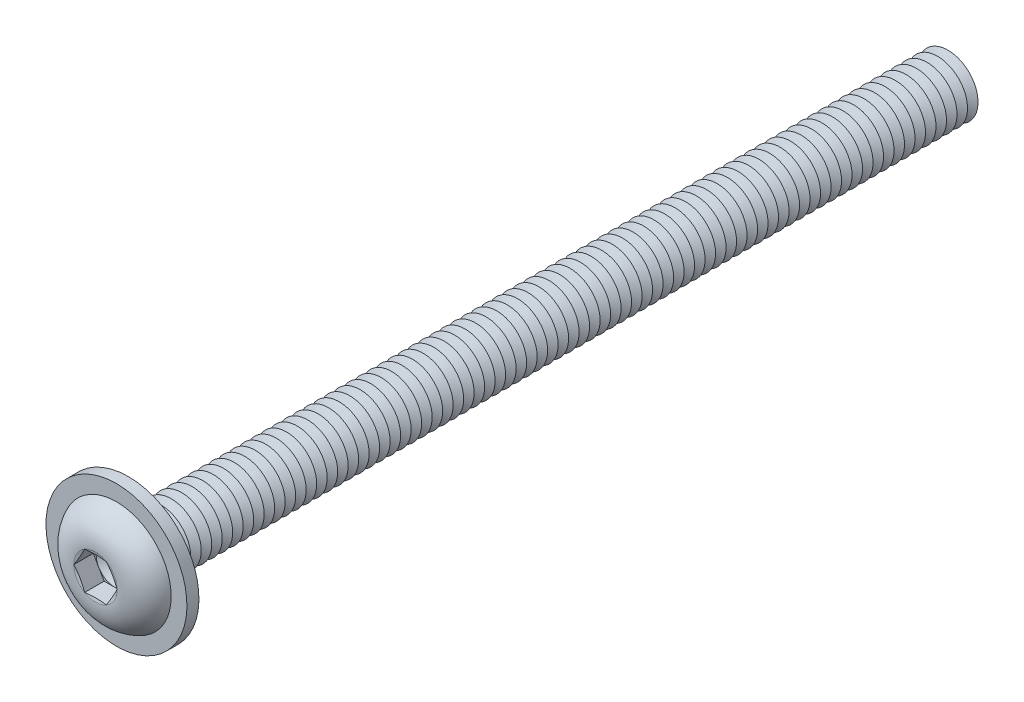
ISO-10303-21;
HEADER;
FILE_DESCRIPTION(('STEP AP214'),'2;1');
FILE_NAME('part.step','',(''),(''),'','','');
FILE_SCHEMA(('AUTOMOTIVE_DESIGN { 1 0 10303 214 1 1 1 1 }'));
ENDSEC;
DATA;
#1=APPLICATION_CONTEXT('core data for automotive mechanical design processes');
#2=APPLICATION_PROTOCOL_DEFINITION('international standard','automotive_design',2000,#1);
#3=PRODUCT_CONTEXT('',#1,'mechanical');
#4=PRODUCT('Part','Part','',(#3));
#5=PRODUCT_RELATED_PRODUCT_CATEGORY('part','',(#4));
#6=PRODUCT_DEFINITION_FORMATION('','',#4);
#7=PRODUCT_DEFINITION_CONTEXT('part definition',#1,'design');
#8=PRODUCT_DEFINITION('design','',#6,#7);
#9=PRODUCT_DEFINITION_SHAPE('','',#8);
#10=(LENGTH_UNIT() NAMED_UNIT(*) SI_UNIT(.MILLI.,.METRE.));
#11=(NAMED_UNIT(*) PLANE_ANGLE_UNIT() SI_UNIT($,.RADIAN.));
#12=(NAMED_UNIT(*) SI_UNIT($,.STERADIAN.) SOLID_ANGLE_UNIT());
#13=UNCERTAINTY_MEASURE_WITH_UNIT(LENGTH_MEASURE(1.E-05),#10,'distance_accuracy_value','');
#14=(GEOMETRIC_REPRESENTATION_CONTEXT(3) GLOBAL_UNCERTAINTY_ASSIGNED_CONTEXT((#13)) GLOBAL_UNIT_ASSIGNED_CONTEXT((#10,
#11,#12)) REPRESENTATION_CONTEXT('',''));
#15=CARTESIAN_POINT('',(0.,0.,0.));
#16=DIRECTION('',(0.,0.,1.));
#17=DIRECTION('',(1.,0.,0.));
#18=AXIS2_PLACEMENT_3D('',#15,#16,#17);
#19=CARTESIAN_POINT('',(0.,0.,-52.55));
#20=DIRECTION('',(0.,0.,1.));
#21=DIRECTION('',(0.,-1.,0.));
#22=AXIS2_PLACEMENT_3D('',#19,#20,#21);
#23=CONICAL_SURFACE('',#22,1.99999999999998,1.04719755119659);
#24=CARTESIAN_POINT('',(0.,0.,-52.9));
#25=DIRECTION('',(0.,0.,1.));
#26=DIRECTION('',(0.,-1.,0.));
#27=AXIS2_PLACEMENT_3D('',#24,#25,#26);
#28=CIRCLE('',#27,1.39378221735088);
#29=CARTESIAN_POINT('',(0.,-1.39378221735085,-52.9));
#30=VERTEX_POINT('',#29);
#31=EDGE_CURVE('E832',#30,#30,#28,.T.);
#32=ORIENTED_EDGE('',*,*,#31,.T.);
#33=EDGE_LOOP('',(#32));
#34=FACE_BOUND('',#33,.T.);
#35=CARTESIAN_POINT('',(0.,0.,-52.55));
#36=DIRECTION('',(0.,0.,1.));
#37=DIRECTION('',(0.,-1.,0.));
#38=AXIS2_PLACEMENT_3D('',#35,#36,#37);
#39=CIRCLE('',#38,1.99999999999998);
#40=CARTESIAN_POINT('',(0.,-1.99999999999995,-52.55));
#41=VERTEX_POINT('',#40);
#42=EDGE_CURVE('E828',#41,#41,#39,.T.);
#43=ORIENTED_EDGE('',*,*,#42,.F.);
#44=EDGE_LOOP('',(#43));
#45=FACE_BOUND('',#44,.T.);
#46=ADVANCED_FACE('F39',(#34,#45),#23,.T.);
#47=CARTESIAN_POINT('',(0.,0.,-52.9));
#48=DIRECTION('',(0.,0.,-1.));
#49=DIRECTION('',(0.,1.,0.));
#50=AXIS2_PLACEMENT_3D('',#47,#48,#49);
#51=CONICAL_SURFACE('',#50,1.39378221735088,1.0471975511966);
#52=CARTESIAN_POINT('',(0.,0.,-53.25));
#53=DIRECTION('',(0.,0.,1.));
#54=DIRECTION('',(0.,-1.,0.));
#55=AXIS2_PLACEMENT_3D('',#52,#53,#54);
#56=CIRCLE('',#55,1.99999999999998);
#57=CARTESIAN_POINT('',(0.,-1.99999999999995,-53.25));
#58=VERTEX_POINT('',#57);
#59=EDGE_CURVE('E836',#58,#58,#56,.T.);
#60=ORIENTED_EDGE('',*,*,#59,.T.);
#61=EDGE_LOOP('',(#60));
#62=FACE_BOUND('',#61,.T.);
#63=ORIENTED_EDGE('',*,*,#31,.F.);
#64=EDGE_LOOP('',(#63));
#65=FACE_BOUND('',#64,.T.);
#66=ADVANCED_FACE('F956',(#62,#65),#51,.T.);
#67=CARTESIAN_POINT('',(0.,1.99999999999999,-55.));
#68=DIRECTION('',(0.,0.,-1.));
#69=DIRECTION('',(0.,1.,0.));
#70=AXIS2_PLACEMENT_3D('',#67,#68,#69);
#71=PLANE('',#70);
#72=CARTESIAN_POINT('',(0.,0.,-55.));
#73=DIRECTION('',(0.,0.,1.));
#74=DIRECTION('',(0.,-1.,0.));
#75=AXIS2_PLACEMENT_3D('',#72,#73,#74);
#76=CIRCLE('',#75,1.39378221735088);
#77=CARTESIAN_POINT('',(0.,-1.39378221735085,-55.));
#78=VERTEX_POINT('',#77);
#79=EDGE_CURVE('E856',#78,#78,#76,.T.);
#80=ORIENTED_EDGE('',*,*,#79,.F.);
#81=EDGE_LOOP('',(#80));
#82=FACE_BOUND('',#81,.T.);
#83=ADVANCED_FACE('F962',(#82),#71,.T.);
#84=CARTESIAN_POINT('',(0.,0.,-54.65));
#85=DIRECTION('',(0.,0.,1.));
#86=DIRECTION('',(0.,-1.,0.));
#87=AXIS2_PLACEMENT_3D('',#84,#85,#86);
#88=CONICAL_SURFACE('',#87,1.99999999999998,1.04719755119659);
#89=ORIENTED_EDGE('',*,*,#79,.T.);
#90=EDGE_LOOP('',(#89));
#91=FACE_BOUND('',#90,.T.);
#92=CARTESIAN_POINT('',(0.,0.,-54.65));
#93=DIRECTION('',(0.,0.,1.));
#94=DIRECTION('',(0.,-1.,0.));
#95=AXIS2_PLACEMENT_3D('',#92,#93,#94);
#96=CIRCLE('',#95,1.99999999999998);
#97=CARTESIAN_POINT('',(0.,-1.99999999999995,-54.65));
#98=VERTEX_POINT('',#97);
#99=EDGE_CURVE('E852',#98,#98,#96,.T.);
#100=ORIENTED_EDGE('',*,*,#99,.F.);
#101=EDGE_LOOP('',(#100));
#102=FACE_BOUND('',#101,.T.);
#103=ADVANCED_FACE('F981',(#91,#102),#88,.T.);
#104=CARTESIAN_POINT('',(0.,0.,-54.3));
#105=DIRECTION('',(0.,0.,-1.));
#106=DIRECTION('',(0.,1.,0.));
#107=AXIS2_PLACEMENT_3D('',#104,#105,#106);
#108=CONICAL_SURFACE('',#107,1.39378221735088,1.0471975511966);
#109=ORIENTED_EDGE('',*,*,#99,.T.);
#110=EDGE_LOOP('',(#109));
#111=FACE_BOUND('',#110,.T.);
#112=CARTESIAN_POINT('',(0.,0.,-54.3));
#113=DIRECTION('',(0.,0.,1.));
#114=DIRECTION('',(0.,-1.,0.));
#115=AXIS2_PLACEMENT_3D('',#112,#113,#114);
#116=CIRCLE('',#115,1.39378221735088);
#117=CARTESIAN_POINT('',(0.,-1.39378221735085,-54.3));
#118=VERTEX_POINT('',#117);
#119=EDGE_CURVE('E848',#118,#118,#116,.T.);
#120=ORIENTED_EDGE('',*,*,#119,.F.);
#121=EDGE_LOOP('',(#120));
#122=FACE_BOUND('',#121,.T.);
#123=ADVANCED_FACE('F978',(#111,#122),#108,.T.);
#124=CARTESIAN_POINT('',(0.,0.,-53.95));
#125=DIRECTION('',(0.,0.,1.));
#126=DIRECTION('',(0.,-1.,0.));
#127=AXIS2_PLACEMENT_3D('',#124,#125,#126);
#128=CONICAL_SURFACE('',#127,1.99999999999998,1.04719755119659);
#129=ORIENTED_EDGE('',*,*,#119,.T.);
#130=EDGE_LOOP('',(#129));
#131=FACE_BOUND('',#130,.T.);
#132=CARTESIAN_POINT('',(0.,0.,-53.95));
#133=DIRECTION('',(0.,0.,1.));
#134=DIRECTION('',(0.,-1.,0.));
#135=AXIS2_PLACEMENT_3D('',#132,#133,#134);
#136=CIRCLE('',#135,1.99999999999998);
#137=CARTESIAN_POINT('',(0.,-1.99999999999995,-53.95));
#138=VERTEX_POINT('',#137);
#139=EDGE_CURVE('E844',#138,#138,#136,.T.);
#140=ORIENTED_EDGE('',*,*,#139,.F.);
#141=EDGE_LOOP('',(#140));
#142=FACE_BOUND('',#141,.T.);
#143=ADVANCED_FACE('F972',(#131,#142),#128,.T.);
#144=CARTESIAN_POINT('',(0.,0.,-53.6));
#145=DIRECTION('',(0.,0.,-1.));
#146=DIRECTION('',(0.,1.,0.));
#147=AXIS2_PLACEMENT_3D('',#144,#145,#146);
#148=CONICAL_SURFACE('',#147,1.39378221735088,1.0471975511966);
#149=ORIENTED_EDGE('',*,*,#139,.T.);
#150=EDGE_LOOP('',(#149));
#151=FACE_BOUND('',#150,.T.);
#152=CARTESIAN_POINT('',(0.,0.,-53.6));
#153=DIRECTION('',(0.,0.,1.));
#154=DIRECTION('',(0.,-1.,0.));
#155=AXIS2_PLACEMENT_3D('',#152,#153,#154);
#156=CIRCLE('',#155,1.39378221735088);
#157=CARTESIAN_POINT('',(0.,-1.39378221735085,-53.6));
#158=VERTEX_POINT('',#157);
#159=EDGE_CURVE('E840',#158,#158,#156,.T.);
#160=ORIENTED_EDGE('',*,*,#159,.F.);
#161=EDGE_LOOP('',(#160));
#162=FACE_BOUND('',#161,.T.);
#163=ADVANCED_FACE('F968',(#151,#162),#148,.T.);
#164=CARTESIAN_POINT('',(0.,0.,-53.25));
#165=DIRECTION('',(0.,0.,1.));
#166=DIRECTION('',(0.,-1.,0.));
#167=AXIS2_PLACEMENT_3D('',#164,#165,#166);
#168=CONICAL_SURFACE('',#167,1.99999999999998,1.04719755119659);
#169=ORIENTED_EDGE('',*,*,#159,.T.);
#170=EDGE_LOOP('',(#169));
#171=FACE_BOUND('',#170,.T.);
#172=ORIENTED_EDGE('',*,*,#59,.F.);
#173=EDGE_LOOP('',(#172));
#174=FACE_BOUND('',#173,.T.);
#175=ADVANCED_FACE('F971',(#171,#174),#168,.T.);
#176=CARTESIAN_POINT('',(0.,0.,-51.85));
#177=DIRECTION('',(0.,0.,1.));
#178=DIRECTION('',(0.,-1.,0.));
#179=AXIS2_PLACEMENT_3D('',#176,#177,#178);
#180=CONICAL_SURFACE('',#179,1.99999999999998,1.04719755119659);
#181=CARTESIAN_POINT('',(0.,0.,-52.2));
#182=DIRECTION('',(0.,0.,1.));
#183=DIRECTION('',(0.,-1.,0.));
#184=AXIS2_PLACEMENT_3D('',#181,#182,#183);
#185=CIRCLE('',#184,1.39378221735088);
#186=CARTESIAN_POINT('',(0.,-1.39378221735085,-52.2));
#187=VERTEX_POINT('',#186);
#188=EDGE_CURVE('E824',#187,#187,#185,.T.);
#189=ORIENTED_EDGE('',*,*,#188,.T.);
#190=EDGE_LOOP('',(#189));
#191=FACE_BOUND('',#190,.T.);
#192=CARTESIAN_POINT('',(0.,0.,-51.85));
#193=DIRECTION('',(0.,0.,1.));
#194=DIRECTION('',(0.,-1.,0.));
#195=AXIS2_PLACEMENT_3D('',#192,#193,#194);
#196=CIRCLE('',#195,1.99999999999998);
#197=CARTESIAN_POINT('',(0.,-1.99999999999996,-51.85));
#198=VERTEX_POINT('',#197);
#199=EDGE_CURVE('E820',#198,#198,#196,.T.);
#200=ORIENTED_EDGE('',*,*,#199,.F.);
#201=EDGE_LOOP('',(#200));
#202=FACE_BOUND('',#201,.T.);
#203=ADVANCED_FACE('F976',(#191,#202),#180,.T.);
#204=CARTESIAN_POINT('',(0.,0.,-52.2));
#205=DIRECTION('',(0.,0.,-1.));
#206=DIRECTION('',(0.,1.,0.));
#207=AXIS2_PLACEMENT_3D('',#204,#205,#206);
#208=CONICAL_SURFACE('',#207,1.39378221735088,1.0471975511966);
#209=ORIENTED_EDGE('',*,*,#42,.T.);
#210=EDGE_LOOP('',(#209));
#211=FACE_BOUND('',#210,.T.);
#212=ORIENTED_EDGE('',*,*,#188,.F.);
#213=EDGE_LOOP('',(#212));
#214=FACE_BOUND('',#213,.T.);
#215=ADVANCED_FACE('F1027',(#211,#214),#208,.T.);
#216=CARTESIAN_POINT('',(0.,0.,-51.15));
#217=DIRECTION('',(0.,0.,1.));
#218=DIRECTION('',(0.,-1.,0.));
#219=AXIS2_PLACEMENT_3D('',#216,#217,#218);
#220=CONICAL_SURFACE('',#219,1.99999999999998,1.04719755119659);
#221=CARTESIAN_POINT('',(0.,0.,-51.5));
#222=DIRECTION('',(0.,0.,1.));
#223=DIRECTION('',(0.,-1.,0.));
#224=AXIS2_PLACEMENT_3D('',#221,#222,#223);
#225=CIRCLE('',#224,1.39378221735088);
#226=CARTESIAN_POINT('',(0.,-1.39378221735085,-51.5));
#227=VERTEX_POINT('',#226);
#228=EDGE_CURVE('E816',#227,#227,#225,.T.);
#229=ORIENTED_EDGE('',*,*,#228,.T.);
#230=EDGE_LOOP('',(#229));
#231=FACE_BOUND('',#230,.T.);
#232=CARTESIAN_POINT('',(0.,0.,-51.15));
#233=DIRECTION('',(0.,0.,1.));
#234=DIRECTION('',(0.,-1.,0.));
#235=AXIS2_PLACEMENT_3D('',#232,#233,#234);
#236=CIRCLE('',#235,1.99999999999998);
#237=CARTESIAN_POINT('',(0.,-1.99999999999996,-51.15));
#238=VERTEX_POINT('',#237);
#239=EDGE_CURVE('E812',#238,#238,#236,.T.);
#240=ORIENTED_EDGE('',*,*,#239,.F.);
#241=EDGE_LOOP('',(#240));
#242=FACE_BOUND('',#241,.T.);
#243=ADVANCED_FACE('F1033',(#231,#242),#220,.T.);
#244=CARTESIAN_POINT('',(0.,0.,-51.5));
#245=DIRECTION('',(0.,0.,-1.));
#246=DIRECTION('',(0.,1.,0.));
#247=AXIS2_PLACEMENT_3D('',#244,#245,#246);
#248=CONICAL_SURFACE('',#247,1.39378221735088,1.0471975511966);
#249=ORIENTED_EDGE('',*,*,#199,.T.);
#250=EDGE_LOOP('',(#249));
#251=FACE_BOUND('',#250,.T.);
#252=ORIENTED_EDGE('',*,*,#228,.F.);
#253=EDGE_LOOP('',(#252));
#254=FACE_BOUND('',#253,.T.);
#255=ADVANCED_FACE('F1040',(#251,#254),#248,.T.);
#256=CARTESIAN_POINT('',(0.,0.,-50.45));
#257=DIRECTION('',(0.,0.,1.));
#258=DIRECTION('',(0.,-1.,0.));
#259=AXIS2_PLACEMENT_3D('',#256,#257,#258);
#260=CONICAL_SURFACE('',#259,1.99999999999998,1.04719755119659);
#261=CARTESIAN_POINT('',(0.,0.,-50.8));
#262=DIRECTION('',(0.,0.,1.));
#263=DIRECTION('',(0.,-1.,0.));
#264=AXIS2_PLACEMENT_3D('',#261,#262,#263);
#265=CIRCLE('',#264,1.39378221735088);
#266=CARTESIAN_POINT('',(0.,-1.39378221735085,-50.8));
#267=VERTEX_POINT('',#266);
#268=EDGE_CURVE('E808',#267,#267,#265,.T.);
#269=ORIENTED_EDGE('',*,*,#268,.T.);
#270=EDGE_LOOP('',(#269));
#271=FACE_BOUND('',#270,.T.);
#272=CARTESIAN_POINT('',(0.,0.,-50.45));
#273=DIRECTION('',(0.,0.,1.));
#274=DIRECTION('',(0.,-1.,0.));
#275=AXIS2_PLACEMENT_3D('',#272,#273,#274);
#276=CIRCLE('',#275,1.99999999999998);
#277=CARTESIAN_POINT('',(0.,-1.99999999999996,-50.45));
#278=VERTEX_POINT('',#277);
#279=EDGE_CURVE('E804',#278,#278,#276,.T.);
#280=ORIENTED_EDGE('',*,*,#279,.F.);
#281=EDGE_LOOP('',(#280));
#282=FACE_BOUND('',#281,.T.);
#283=ADVANCED_FACE('F1047',(#271,#282),#260,.T.);
#284=CARTESIAN_POINT('',(0.,0.,-50.8));
#285=DIRECTION('',(0.,0.,-1.));
#286=DIRECTION('',(0.,1.,0.));
#287=AXIS2_PLACEMENT_3D('',#284,#285,#286);
#288=CONICAL_SURFACE('',#287,1.39378221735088,1.0471975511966);
#289=ORIENTED_EDGE('',*,*,#239,.T.);
#290=EDGE_LOOP('',(#289));
#291=FACE_BOUND('',#290,.T.);
#292=ORIENTED_EDGE('',*,*,#268,.F.);
#293=EDGE_LOOP('',(#292));
#294=FACE_BOUND('',#293,.T.);
#295=ADVANCED_FACE('F1054',(#291,#294),#288,.T.);
#296=CARTESIAN_POINT('',(0.,0.,-49.75));
#297=DIRECTION('',(0.,0.,1.));
#298=DIRECTION('',(0.,-1.,0.));
#299=AXIS2_PLACEMENT_3D('',#296,#297,#298);
#300=CONICAL_SURFACE('',#299,1.99999999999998,1.04719755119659);
#301=CARTESIAN_POINT('',(0.,0.,-50.1));
#302=DIRECTION('',(0.,0.,1.));
#303=DIRECTION('',(0.,-1.,0.));
#304=AXIS2_PLACEMENT_3D('',#301,#302,#303);
#305=CIRCLE('',#304,1.39378221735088);
#306=CARTESIAN_POINT('',(0.,-1.39378221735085,-50.1));
#307=VERTEX_POINT('',#306);
#308=EDGE_CURVE('E800',#307,#307,#305,.T.);
#309=ORIENTED_EDGE('',*,*,#308,.T.);
#310=EDGE_LOOP('',(#309));
#311=FACE_BOUND('',#310,.T.);
#312=CARTESIAN_POINT('',(0.,0.,-49.75));
#313=DIRECTION('',(0.,0.,1.));
#314=DIRECTION('',(0.,-1.,0.));
#315=AXIS2_PLACEMENT_3D('',#312,#313,#314);
#316=CIRCLE('',#315,1.99999999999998);
#317=CARTESIAN_POINT('',(0.,-1.99999999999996,-49.75));
#318=VERTEX_POINT('',#317);
#319=EDGE_CURVE('E796',#318,#318,#316,.T.);
#320=ORIENTED_EDGE('',*,*,#319,.F.);
#321=EDGE_LOOP('',(#320));
#322=FACE_BOUND('',#321,.T.);
#323=ADVANCED_FACE('F1061',(#311,#322),#300,.T.);
#324=CARTESIAN_POINT('',(0.,0.,-50.1));
#325=DIRECTION('',(0.,0.,-1.));
#326=DIRECTION('',(0.,1.,0.));
#327=AXIS2_PLACEMENT_3D('',#324,#325,#326);
#328=CONICAL_SURFACE('',#327,1.39378221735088,1.0471975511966);
#329=ORIENTED_EDGE('',*,*,#279,.T.);
#330=EDGE_LOOP('',(#329));
#331=FACE_BOUND('',#330,.T.);
#332=ORIENTED_EDGE('',*,*,#308,.F.);
#333=EDGE_LOOP('',(#332));
#334=FACE_BOUND('',#333,.T.);
#335=ADVANCED_FACE('F1068',(#331,#334),#328,.T.);
#336=CARTESIAN_POINT('',(0.,0.,-49.05));
#337=DIRECTION('',(0.,0.,1.));
#338=DIRECTION('',(0.,-1.,0.));
#339=AXIS2_PLACEMENT_3D('',#336,#337,#338);
#340=CONICAL_SURFACE('',#339,1.99999999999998,1.04719755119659);
#341=CARTESIAN_POINT('',(0.,0.,-49.4));
#342=DIRECTION('',(0.,0.,1.));
#343=DIRECTION('',(0.,-1.,0.));
#344=AXIS2_PLACEMENT_3D('',#341,#342,#343);
#345=CIRCLE('',#344,1.39378221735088);
#346=CARTESIAN_POINT('',(0.,-1.39378221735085,-49.4));
#347=VERTEX_POINT('',#346);
#348=EDGE_CURVE('E792',#347,#347,#345,.T.);
#349=ORIENTED_EDGE('',*,*,#348,.T.);
#350=EDGE_LOOP('',(#349));
#351=FACE_BOUND('',#350,.T.);
#352=CARTESIAN_POINT('',(0.,0.,-49.05));
#353=DIRECTION('',(0.,0.,1.));
#354=DIRECTION('',(0.,-1.,0.));
#355=AXIS2_PLACEMENT_3D('',#352,#353,#354);
#356=CIRCLE('',#355,1.99999999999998);
#357=CARTESIAN_POINT('',(0.,-1.99999999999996,-49.05));
#358=VERTEX_POINT('',#357);
#359=EDGE_CURVE('E788',#358,#358,#356,.T.);
#360=ORIENTED_EDGE('',*,*,#359,.F.);
#361=EDGE_LOOP('',(#360));
#362=FACE_BOUND('',#361,.T.);
#363=ADVANCED_FACE('F1075',(#351,#362),#340,.T.);
#364=CARTESIAN_POINT('',(0.,0.,-49.4));
#365=DIRECTION('',(0.,0.,-1.));
#366=DIRECTION('',(0.,1.,0.));
#367=AXIS2_PLACEMENT_3D('',#364,#365,#366);
#368=CONICAL_SURFACE('',#367,1.39378221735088,1.0471975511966);
#369=ORIENTED_EDGE('',*,*,#319,.T.);
#370=EDGE_LOOP('',(#369));
#371=FACE_BOUND('',#370,.T.);
#372=ORIENTED_EDGE('',*,*,#348,.F.);
#373=EDGE_LOOP('',(#372));
#374=FACE_BOUND('',#373,.T.);
#375=ADVANCED_FACE('F1082',(#371,#374),#368,.T.);
#376=CARTESIAN_POINT('',(0.,0.,-48.35));
#377=DIRECTION('',(0.,0.,1.));
#378=DIRECTION('',(0.,-1.,0.));
#379=AXIS2_PLACEMENT_3D('',#376,#377,#378);
#380=CONICAL_SURFACE('',#379,1.99999999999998,1.04719755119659);
#381=CARTESIAN_POINT('',(0.,0.,-48.7));
#382=DIRECTION('',(0.,0.,1.));
#383=DIRECTION('',(0.,-1.,0.));
#384=AXIS2_PLACEMENT_3D('',#381,#382,#383);
#385=CIRCLE('',#384,1.39378221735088);
#386=CARTESIAN_POINT('',(0.,-1.39378221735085,-48.7));
#387=VERTEX_POINT('',#386);
#388=EDGE_CURVE('E784',#387,#387,#385,.T.);
#389=ORIENTED_EDGE('',*,*,#388,.T.);
#390=EDGE_LOOP('',(#389));
#391=FACE_BOUND('',#390,.T.);
#392=CARTESIAN_POINT('',(0.,0.,-48.35));
#393=DIRECTION('',(0.,0.,1.));
#394=DIRECTION('',(0.,-1.,0.));
#395=AXIS2_PLACEMENT_3D('',#392,#393,#394);
#396=CIRCLE('',#395,1.99999999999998);
#397=CARTESIAN_POINT('',(0.,-1.99999999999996,-48.35));
#398=VERTEX_POINT('',#397);
#399=EDGE_CURVE('E780',#398,#398,#396,.T.);
#400=ORIENTED_EDGE('',*,*,#399,.F.);
#401=EDGE_LOOP('',(#400));
#402=FACE_BOUND('',#401,.T.);
#403=ADVANCED_FACE('F1089',(#391,#402),#380,.T.);
#404=CARTESIAN_POINT('',(0.,0.,-48.7));
#405=DIRECTION('',(0.,0.,-1.));
#406=DIRECTION('',(0.,1.,0.));
#407=AXIS2_PLACEMENT_3D('',#404,#405,#406);
#408=CONICAL_SURFACE('',#407,1.39378221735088,1.0471975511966);
#409=ORIENTED_EDGE('',*,*,#359,.T.);
#410=EDGE_LOOP('',(#409));
#411=FACE_BOUND('',#410,.T.);
#412=ORIENTED_EDGE('',*,*,#388,.F.);
#413=EDGE_LOOP('',(#412));
#414=FACE_BOUND('',#413,.T.);
#415=ADVANCED_FACE('F1096',(#411,#414),#408,.T.);
#416=CARTESIAN_POINT('',(0.,0.,-47.65));
#417=DIRECTION('',(0.,0.,1.));
#418=DIRECTION('',(0.,-1.,0.));
#419=AXIS2_PLACEMENT_3D('',#416,#417,#418);
#420=CONICAL_SURFACE('',#419,1.99999999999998,1.04719755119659);
#421=CARTESIAN_POINT('',(0.,0.,-48.));
#422=DIRECTION('',(0.,0.,1.));
#423=DIRECTION('',(0.,-1.,0.));
#424=AXIS2_PLACEMENT_3D('',#421,#422,#423);
#425=CIRCLE('',#424,1.39378221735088);
#426=CARTESIAN_POINT('',(0.,-1.39378221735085,-48.));
#427=VERTEX_POINT('',#426);
#428=EDGE_CURVE('E776',#427,#427,#425,.T.);
#429=ORIENTED_EDGE('',*,*,#428,.T.);
#430=EDGE_LOOP('',(#429));
#431=FACE_BOUND('',#430,.T.);
#432=CARTESIAN_POINT('',(0.,0.,-47.65));
#433=DIRECTION('',(0.,0.,1.));
#434=DIRECTION('',(0.,-1.,0.));
#435=AXIS2_PLACEMENT_3D('',#432,#433,#434);
#436=CIRCLE('',#435,1.99999999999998);
#437=CARTESIAN_POINT('',(0.,-1.99999999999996,-47.65));
#438=VERTEX_POINT('',#437);
#439=EDGE_CURVE('E772',#438,#438,#436,.T.);
#440=ORIENTED_EDGE('',*,*,#439,.F.);
#441=EDGE_LOOP('',(#440));
#442=FACE_BOUND('',#441,.T.);
#443=ADVANCED_FACE('F1103',(#431,#442),#420,.T.);
#444=CARTESIAN_POINT('',(0.,0.,-48.));
#445=DIRECTION('',(0.,0.,-1.));
#446=DIRECTION('',(0.,1.,0.));
#447=AXIS2_PLACEMENT_3D('',#444,#445,#446);
#448=CONICAL_SURFACE('',#447,1.39378221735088,1.0471975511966);
#449=ORIENTED_EDGE('',*,*,#399,.T.);
#450=EDGE_LOOP('',(#449));
#451=FACE_BOUND('',#450,.T.);
#452=ORIENTED_EDGE('',*,*,#428,.F.);
#453=EDGE_LOOP('',(#452));
#454=FACE_BOUND('',#453,.T.);
#455=ADVANCED_FACE('F1110',(#451,#454),#448,.T.);
#456=CARTESIAN_POINT('',(0.,0.,-46.95));
#457=DIRECTION('',(0.,0.,1.));
#458=DIRECTION('',(0.,-1.,0.));
#459=AXIS2_PLACEMENT_3D('',#456,#457,#458);
#460=CONICAL_SURFACE('',#459,1.99999999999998,1.04719755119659);
#461=CARTESIAN_POINT('',(0.,0.,-47.3));
#462=DIRECTION('',(0.,0.,1.));
#463=DIRECTION('',(0.,-1.,0.));
#464=AXIS2_PLACEMENT_3D('',#461,#462,#463);
#465=CIRCLE('',#464,1.39378221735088);
#466=CARTESIAN_POINT('',(0.,-1.39378221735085,-47.3));
#467=VERTEX_POINT('',#466);
#468=EDGE_CURVE('E768',#467,#467,#465,.T.);
#469=ORIENTED_EDGE('',*,*,#468,.T.);
#470=EDGE_LOOP('',(#469));
#471=FACE_BOUND('',#470,.T.);
#472=CARTESIAN_POINT('',(0.,0.,-46.95));
#473=DIRECTION('',(0.,0.,1.));
#474=DIRECTION('',(0.,-1.,0.));
#475=AXIS2_PLACEMENT_3D('',#472,#473,#474);
#476=CIRCLE('',#475,1.99999999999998);
#477=CARTESIAN_POINT('',(0.,-1.99999999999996,-46.95));
#478=VERTEX_POINT('',#477);
#479=EDGE_CURVE('E764',#478,#478,#476,.T.);
#480=ORIENTED_EDGE('',*,*,#479,.F.);
#481=EDGE_LOOP('',(#480));
#482=FACE_BOUND('',#481,.T.);
#483=ADVANCED_FACE('F1117',(#471,#482),#460,.T.);
#484=CARTESIAN_POINT('',(0.,0.,-47.3));
#485=DIRECTION('',(0.,0.,-1.));
#486=DIRECTION('',(0.,1.,0.));
#487=AXIS2_PLACEMENT_3D('',#484,#485,#486);
#488=CONICAL_SURFACE('',#487,1.39378221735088,1.0471975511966);
#489=ORIENTED_EDGE('',*,*,#439,.T.);
#490=EDGE_LOOP('',(#489));
#491=FACE_BOUND('',#490,.T.);
#492=ORIENTED_EDGE('',*,*,#468,.F.);
#493=EDGE_LOOP('',(#492));
#494=FACE_BOUND('',#493,.T.);
#495=ADVANCED_FACE('F1124',(#491,#494),#488,.T.);
#496=CARTESIAN_POINT('',(0.,0.,-46.25));
#497=DIRECTION('',(0.,0.,1.));
#498=DIRECTION('',(0.,-1.,0.));
#499=AXIS2_PLACEMENT_3D('',#496,#497,#498);
#500=CONICAL_SURFACE('',#499,1.99999999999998,1.04719755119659);
#501=CARTESIAN_POINT('',(0.,0.,-46.6));
#502=DIRECTION('',(0.,0.,1.));
#503=DIRECTION('',(0.,-1.,0.));
#504=AXIS2_PLACEMENT_3D('',#501,#502,#503);
#505=CIRCLE('',#504,1.39378221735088);
#506=CARTESIAN_POINT('',(0.,-1.39378221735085,-46.6));
#507=VERTEX_POINT('',#506);
#508=EDGE_CURVE('E760',#507,#507,#505,.T.);
#509=ORIENTED_EDGE('',*,*,#508,.T.);
#510=EDGE_LOOP('',(#509));
#511=FACE_BOUND('',#510,.T.);
#512=CARTESIAN_POINT('',(0.,0.,-46.25));
#513=DIRECTION('',(0.,0.,1.));
#514=DIRECTION('',(0.,-1.,0.));
#515=AXIS2_PLACEMENT_3D('',#512,#513,#514);
#516=CIRCLE('',#515,1.99999999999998);
#517=CARTESIAN_POINT('',(0.,-1.99999999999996,-46.25));
#518=VERTEX_POINT('',#517);
#519=EDGE_CURVE('E757',#518,#518,#516,.T.);
#520=ORIENTED_EDGE('',*,*,#519,.F.);
#521=EDGE_LOOP('',(#520));
#522=FACE_BOUND('',#521,.T.);
#523=ADVANCED_FACE('F1131',(#511,#522),#500,.T.);
#524=CARTESIAN_POINT('',(0.,0.,-46.6));
#525=DIRECTION('',(0.,0.,-1.));
#526=DIRECTION('',(0.,1.,0.));
#527=AXIS2_PLACEMENT_3D('',#524,#525,#526);
#528=CONICAL_SURFACE('',#527,1.39378221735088,1.0471975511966);
#529=ORIENTED_EDGE('',*,*,#479,.T.);
#530=EDGE_LOOP('',(#529));
#531=FACE_BOUND('',#530,.T.);
#532=ORIENTED_EDGE('',*,*,#508,.F.);
#533=EDGE_LOOP('',(#532));
#534=FACE_BOUND('',#533,.T.);
#535=ADVANCED_FACE('F1138',(#531,#534),#528,.T.);
#536=CARTESIAN_POINT('',(0.,0.,-45.55));
#537=DIRECTION('',(0.,0.,1.));
#538=DIRECTION('',(0.,-1.,0.));
#539=AXIS2_PLACEMENT_3D('',#536,#537,#538);
#540=CONICAL_SURFACE('',#539,1.99999999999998,1.04719755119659);
#541=CARTESIAN_POINT('',(0.,0.,-45.9));
#542=DIRECTION('',(0.,0.,1.));
#543=DIRECTION('',(0.,-1.,0.));
#544=AXIS2_PLACEMENT_3D('',#541,#542,#543);
#545=CIRCLE('',#544,1.39378221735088);
#546=CARTESIAN_POINT('',(0.,-1.39378221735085,-45.9));
#547=VERTEX_POINT('',#546);
#548=EDGE_CURVE('E753',#547,#547,#545,.T.);
#549=ORIENTED_EDGE('',*,*,#548,.T.);
#550=EDGE_LOOP('',(#549));
#551=FACE_BOUND('',#550,.T.);
#552=CARTESIAN_POINT('',(0.,0.,-45.55));
#553=DIRECTION('',(0.,0.,1.));
#554=DIRECTION('',(0.,-1.,0.));
#555=AXIS2_PLACEMENT_3D('',#552,#553,#554);
#556=CIRCLE('',#555,1.99999999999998);
#557=CARTESIAN_POINT('',(0.,-1.99999999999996,-45.55));
#558=VERTEX_POINT('',#557);
#559=EDGE_CURVE('E749',#558,#558,#556,.T.);
#560=ORIENTED_EDGE('',*,*,#559,.F.);
#561=EDGE_LOOP('',(#560));
#562=FACE_BOUND('',#561,.T.);
#563=ADVANCED_FACE('F1145',(#551,#562),#540,.T.);
#564=CARTESIAN_POINT('',(0.,0.,-45.9));
#565=DIRECTION('',(0.,0.,-1.));
#566=DIRECTION('',(0.,1.,0.));
#567=AXIS2_PLACEMENT_3D('',#564,#565,#566);
#568=CONICAL_SURFACE('',#567,1.39378221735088,1.0471975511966);
#569=ORIENTED_EDGE('',*,*,#519,.T.);
#570=EDGE_LOOP('',(#569));
#571=FACE_BOUND('',#570,.T.);
#572=ORIENTED_EDGE('',*,*,#548,.F.);
#573=EDGE_LOOP('',(#572));
#574=FACE_BOUND('',#573,.T.);
#575=ADVANCED_FACE('F1152',(#571,#574),#568,.T.);
#576=CARTESIAN_POINT('',(0.,0.,-44.85));
#577=DIRECTION('',(0.,0.,1.));
#578=DIRECTION('',(0.,-1.,0.));
#579=AXIS2_PLACEMENT_3D('',#576,#577,#578);
#580=CONICAL_SURFACE('',#579,1.99999999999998,1.04719755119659);
#581=CARTESIAN_POINT('',(0.,0.,-45.2));
#582=DIRECTION('',(0.,0.,1.));
#583=DIRECTION('',(0.,-1.,0.));
#584=AXIS2_PLACEMENT_3D('',#581,#582,#583);
#585=CIRCLE('',#584,1.39378221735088);
#586=CARTESIAN_POINT('',(0.,-1.39378221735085,-45.2));
#587=VERTEX_POINT('',#586);
#588=EDGE_CURVE('E745',#587,#587,#585,.T.);
#589=ORIENTED_EDGE('',*,*,#588,.T.);
#590=EDGE_LOOP('',(#589));
#591=FACE_BOUND('',#590,.T.);
#592=CARTESIAN_POINT('',(0.,0.,-44.85));
#593=DIRECTION('',(0.,0.,1.));
#594=DIRECTION('',(0.,-1.,0.));
#595=AXIS2_PLACEMENT_3D('',#592,#593,#594);
#596=CIRCLE('',#595,1.99999999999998);
#597=CARTESIAN_POINT('',(0.,-1.99999999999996,-44.85));
#598=VERTEX_POINT('',#597);
#599=EDGE_CURVE('E741',#598,#598,#596,.T.);
#600=ORIENTED_EDGE('',*,*,#599,.F.);
#601=EDGE_LOOP('',(#600));
#602=FACE_BOUND('',#601,.T.);
#603=ADVANCED_FACE('F1159',(#591,#602),#580,.T.);
#604=CARTESIAN_POINT('',(0.,0.,-45.2));
#605=DIRECTION('',(0.,0.,-1.));
#606=DIRECTION('',(0.,1.,0.));
#607=AXIS2_PLACEMENT_3D('',#604,#605,#606);
#608=CONICAL_SURFACE('',#607,1.39378221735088,1.0471975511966);
#609=ORIENTED_EDGE('',*,*,#559,.T.);
#610=EDGE_LOOP('',(#609));
#611=FACE_BOUND('',#610,.T.);
#612=ORIENTED_EDGE('',*,*,#588,.F.);
#613=EDGE_LOOP('',(#612));
#614=FACE_BOUND('',#613,.T.);
#615=ADVANCED_FACE('F1166',(#611,#614),#608,.T.);
#616=CARTESIAN_POINT('',(0.,0.,-44.15));
#617=DIRECTION('',(0.,0.,1.));
#618=DIRECTION('',(0.,-1.,0.));
#619=AXIS2_PLACEMENT_3D('',#616,#617,#618);
#620=CONICAL_SURFACE('',#619,1.99999999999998,1.04719755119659);
#621=CARTESIAN_POINT('',(0.,0.,-44.5));
#622=DIRECTION('',(0.,0.,1.));
#623=DIRECTION('',(0.,-1.,0.));
#624=AXIS2_PLACEMENT_3D('',#621,#622,#623);
#625=CIRCLE('',#624,1.39378221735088);
#626=CARTESIAN_POINT('',(0.,-1.39378221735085,-44.5));
#627=VERTEX_POINT('',#626);
#628=EDGE_CURVE('E737',#627,#627,#625,.T.);
#629=ORIENTED_EDGE('',*,*,#628,.T.);
#630=EDGE_LOOP('',(#629));
#631=FACE_BOUND('',#630,.T.);
#632=CARTESIAN_POINT('',(0.,0.,-44.15));
#633=DIRECTION('',(0.,0.,1.));
#634=DIRECTION('',(0.,-1.,0.));
#635=AXIS2_PLACEMENT_3D('',#632,#633,#634);
#636=CIRCLE('',#635,1.99999999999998);
#637=CARTESIAN_POINT('',(0.,-1.99999999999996,-44.15));
#638=VERTEX_POINT('',#637);
#639=EDGE_CURVE('E733',#638,#638,#636,.T.);
#640=ORIENTED_EDGE('',*,*,#639,.F.);
#641=EDGE_LOOP('',(#640));
#642=FACE_BOUND('',#641,.T.);
#643=ADVANCED_FACE('F1173',(#631,#642),#620,.T.);
#644=CARTESIAN_POINT('',(0.,0.,-44.5));
#645=DIRECTION('',(0.,0.,-1.));
#646=DIRECTION('',(0.,1.,0.));
#647=AXIS2_PLACEMENT_3D('',#644,#645,#646);
#648=CONICAL_SURFACE('',#647,1.39378221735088,1.0471975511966);
#649=ORIENTED_EDGE('',*,*,#599,.T.);
#650=EDGE_LOOP('',(#649));
#651=FACE_BOUND('',#650,.T.);
#652=ORIENTED_EDGE('',*,*,#628,.F.);
#653=EDGE_LOOP('',(#652));
#654=FACE_BOUND('',#653,.T.);
#655=ADVANCED_FACE('F1180',(#651,#654),#648,.T.);
#656=CARTESIAN_POINT('',(0.,0.,-43.45));
#657=DIRECTION('',(0.,0.,1.));
#658=DIRECTION('',(0.,-1.,0.));
#659=AXIS2_PLACEMENT_3D('',#656,#657,#658);
#660=CONICAL_SURFACE('',#659,1.99999999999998,1.04719755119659);
#661=CARTESIAN_POINT('',(0.,0.,-43.8));
#662=DIRECTION('',(0.,0.,1.));
#663=DIRECTION('',(0.,-1.,0.));
#664=AXIS2_PLACEMENT_3D('',#661,#662,#663);
#665=CIRCLE('',#664,1.39378221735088);
#666=CARTESIAN_POINT('',(0.,-1.39378221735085,-43.8));
#667=VERTEX_POINT('',#666);
#668=EDGE_CURVE('E729',#667,#667,#665,.T.);
#669=ORIENTED_EDGE('',*,*,#668,.T.);
#670=EDGE_LOOP('',(#669));
#671=FACE_BOUND('',#670,.T.);
#672=CARTESIAN_POINT('',(0.,0.,-43.45));
#673=DIRECTION('',(0.,0.,1.));
#674=DIRECTION('',(0.,-1.,0.));
#675=AXIS2_PLACEMENT_3D('',#672,#673,#674);
#676=CIRCLE('',#675,1.99999999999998);
#677=CARTESIAN_POINT('',(0.,-1.99999999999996,-43.45));
#678=VERTEX_POINT('',#677);
#679=EDGE_CURVE('E725',#678,#678,#676,.T.);
#680=ORIENTED_EDGE('',*,*,#679,.F.);
#681=EDGE_LOOP('',(#680));
#682=FACE_BOUND('',#681,.T.);
#683=ADVANCED_FACE('F1187',(#671,#682),#660,.T.);
#684=CARTESIAN_POINT('',(0.,0.,-43.8));
#685=DIRECTION('',(0.,0.,-1.));
#686=DIRECTION('',(0.,1.,0.));
#687=AXIS2_PLACEMENT_3D('',#684,#685,#686);
#688=CONICAL_SURFACE('',#687,1.39378221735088,1.0471975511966);
#689=ORIENTED_EDGE('',*,*,#639,.T.);
#690=EDGE_LOOP('',(#689));
#691=FACE_BOUND('',#690,.T.);
#692=ORIENTED_EDGE('',*,*,#668,.F.);
#693=EDGE_LOOP('',(#692));
#694=FACE_BOUND('',#693,.T.);
#695=ADVANCED_FACE('F1194',(#691,#694),#688,.T.);
#696=CARTESIAN_POINT('',(0.,0.,-42.75));
#697=DIRECTION('',(0.,0.,1.));
#698=DIRECTION('',(0.,-1.,0.));
#699=AXIS2_PLACEMENT_3D('',#696,#697,#698);
#700=CONICAL_SURFACE('',#699,1.99999999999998,1.04719755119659);
#701=CARTESIAN_POINT('',(0.,0.,-43.1));
#702=DIRECTION('',(0.,0.,1.));
#703=DIRECTION('',(0.,-1.,0.));
#704=AXIS2_PLACEMENT_3D('',#701,#702,#703);
#705=CIRCLE('',#704,1.39378221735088);
#706=CARTESIAN_POINT('',(0.,-1.39378221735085,-43.1));
#707=VERTEX_POINT('',#706);
#708=EDGE_CURVE('E721',#707,#707,#705,.T.);
#709=ORIENTED_EDGE('',*,*,#708,.T.);
#710=EDGE_LOOP('',(#709));
#711=FACE_BOUND('',#710,.T.);
#712=CARTESIAN_POINT('',(0.,0.,-42.75));
#713=DIRECTION('',(0.,0.,1.));
#714=DIRECTION('',(0.,-1.,0.));
#715=AXIS2_PLACEMENT_3D('',#712,#713,#714);
#716=CIRCLE('',#715,1.99999999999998);
#717=CARTESIAN_POINT('',(0.,-1.99999999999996,-42.75));
#718=VERTEX_POINT('',#717);
#719=EDGE_CURVE('E717',#718,#718,#716,.T.);
#720=ORIENTED_EDGE('',*,*,#719,.F.);
#721=EDGE_LOOP('',(#720));
#722=FACE_BOUND('',#721,.T.);
#723=ADVANCED_FACE('F1201',(#711,#722),#700,.T.);
#724=CARTESIAN_POINT('',(0.,0.,-43.1));
#725=DIRECTION('',(0.,0.,-1.));
#726=DIRECTION('',(0.,1.,0.));
#727=AXIS2_PLACEMENT_3D('',#724,#725,#726);
#728=CONICAL_SURFACE('',#727,1.39378221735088,1.0471975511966);
#729=ORIENTED_EDGE('',*,*,#679,.T.);
#730=EDGE_LOOP('',(#729));
#731=FACE_BOUND('',#730,.T.);
#732=ORIENTED_EDGE('',*,*,#708,.F.);
#733=EDGE_LOOP('',(#732));
#734=FACE_BOUND('',#733,.T.);
#735=ADVANCED_FACE('F1208',(#731,#734),#728,.T.);
#736=CARTESIAN_POINT('',(0.,0.,-42.05));
#737=DIRECTION('',(0.,0.,1.));
#738=DIRECTION('',(0.,-1.,0.));
#739=AXIS2_PLACEMENT_3D('',#736,#737,#738);
#740=CONICAL_SURFACE('',#739,1.99999999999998,1.04719755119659);
#741=CARTESIAN_POINT('',(0.,0.,-42.4));
#742=DIRECTION('',(0.,0.,1.));
#743=DIRECTION('',(0.,-1.,0.));
#744=AXIS2_PLACEMENT_3D('',#741,#742,#743);
#745=CIRCLE('',#744,1.39378221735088);
#746=CARTESIAN_POINT('',(0.,-1.39378221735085,-42.4));
#747=VERTEX_POINT('',#746);
#748=EDGE_CURVE('E713',#747,#747,#745,.T.);
#749=ORIENTED_EDGE('',*,*,#748,.T.);
#750=EDGE_LOOP('',(#749));
#751=FACE_BOUND('',#750,.T.);
#752=CARTESIAN_POINT('',(0.,0.,-42.05));
#753=DIRECTION('',(0.,0.,1.));
#754=DIRECTION('',(0.,-1.,0.));
#755=AXIS2_PLACEMENT_3D('',#752,#753,#754);
#756=CIRCLE('',#755,1.99999999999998);
#757=CARTESIAN_POINT('',(0.,-1.99999999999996,-42.05));
#758=VERTEX_POINT('',#757);
#759=EDGE_CURVE('E709',#758,#758,#756,.T.);
#760=ORIENTED_EDGE('',*,*,#759,.F.);
#761=EDGE_LOOP('',(#760));
#762=FACE_BOUND('',#761,.T.);
#763=ADVANCED_FACE('F1215',(#751,#762),#740,.T.);
#764=CARTESIAN_POINT('',(0.,0.,-42.4));
#765=DIRECTION('',(0.,0.,-1.));
#766=DIRECTION('',(0.,1.,0.));
#767=AXIS2_PLACEMENT_3D('',#764,#765,#766);
#768=CONICAL_SURFACE('',#767,1.39378221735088,1.0471975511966);
#769=ORIENTED_EDGE('',*,*,#719,.T.);
#770=EDGE_LOOP('',(#769));
#771=FACE_BOUND('',#770,.T.);
#772=ORIENTED_EDGE('',*,*,#748,.F.);
#773=EDGE_LOOP('',(#772));
#774=FACE_BOUND('',#773,.T.);
#775=ADVANCED_FACE('F1222',(#771,#774),#768,.T.);
#776=CARTESIAN_POINT('',(0.,0.,-41.35));
#777=DIRECTION('',(0.,0.,1.));
#778=DIRECTION('',(0.,-1.,0.));
#779=AXIS2_PLACEMENT_3D('',#776,#777,#778);
#780=CONICAL_SURFACE('',#779,1.99999999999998,1.04719755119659);
#781=CARTESIAN_POINT('',(0.,0.,-41.7));
#782=DIRECTION('',(0.,0.,1.));
#783=DIRECTION('',(0.,-1.,0.));
#784=AXIS2_PLACEMENT_3D('',#781,#782,#783);
#785=CIRCLE('',#784,1.39378221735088);
#786=CARTESIAN_POINT('',(0.,-1.39378221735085,-41.7));
#787=VERTEX_POINT('',#786);
#788=EDGE_CURVE('E705',#787,#787,#785,.T.);
#789=ORIENTED_EDGE('',*,*,#788,.T.);
#790=EDGE_LOOP('',(#789));
#791=FACE_BOUND('',#790,.T.);
#792=CARTESIAN_POINT('',(0.,0.,-41.35));
#793=DIRECTION('',(0.,0.,1.));
#794=DIRECTION('',(0.,-1.,0.));
#795=AXIS2_PLACEMENT_3D('',#792,#793,#794);
#796=CIRCLE('',#795,1.99999999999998);
#797=CARTESIAN_POINT('',(0.,-1.99999999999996,-41.35));
#798=VERTEX_POINT('',#797);
#799=EDGE_CURVE('E701',#798,#798,#796,.T.);
#800=ORIENTED_EDGE('',*,*,#799,.F.);
#801=EDGE_LOOP('',(#800));
#802=FACE_BOUND('',#801,.T.);
#803=ADVANCED_FACE('F1229',(#791,#802),#780,.T.);
#804=CARTESIAN_POINT('',(0.,0.,-41.7));
#805=DIRECTION('',(0.,0.,-1.));
#806=DIRECTION('',(0.,1.,0.));
#807=AXIS2_PLACEMENT_3D('',#804,#805,#806);
#808=CONICAL_SURFACE('',#807,1.39378221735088,1.0471975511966);
#809=ORIENTED_EDGE('',*,*,#759,.T.);
#810=EDGE_LOOP('',(#809));
#811=FACE_BOUND('',#810,.T.);
#812=ORIENTED_EDGE('',*,*,#788,.F.);
#813=EDGE_LOOP('',(#812));
#814=FACE_BOUND('',#813,.T.);
#815=ADVANCED_FACE('F1236',(#811,#814),#808,.T.);
#816=CARTESIAN_POINT('',(0.,0.,-40.65));
#817=DIRECTION('',(0.,0.,1.));
#818=DIRECTION('',(0.,-1.,0.));
#819=AXIS2_PLACEMENT_3D('',#816,#817,#818);
#820=CONICAL_SURFACE('',#819,1.99999999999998,1.04719755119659);
#821=CARTESIAN_POINT('',(0.,0.,-41.));
#822=DIRECTION('',(0.,0.,1.));
#823=DIRECTION('',(0.,-1.,0.));
#824=AXIS2_PLACEMENT_3D('',#821,#822,#823);
#825=CIRCLE('',#824,1.39378221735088);
#826=CARTESIAN_POINT('',(0.,-1.39378221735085,-41.));
#827=VERTEX_POINT('',#826);
#828=EDGE_CURVE('E697',#827,#827,#825,.T.);
#829=ORIENTED_EDGE('',*,*,#828,.T.);
#830=EDGE_LOOP('',(#829));
#831=FACE_BOUND('',#830,.T.);
#832=CARTESIAN_POINT('',(0.,0.,-40.65));
#833=DIRECTION('',(0.,0.,1.));
#834=DIRECTION('',(0.,-1.,0.));
#835=AXIS2_PLACEMENT_3D('',#832,#833,#834);
#836=CIRCLE('',#835,1.99999999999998);
#837=CARTESIAN_POINT('',(0.,-1.99999999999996,-40.65));
#838=VERTEX_POINT('',#837);
#839=EDGE_CURVE('E693',#838,#838,#836,.T.);
#840=ORIENTED_EDGE('',*,*,#839,.F.);
#841=EDGE_LOOP('',(#840));
#842=FACE_BOUND('',#841,.T.);
#843=ADVANCED_FACE('F1243',(#831,#842),#820,.T.);
#844=CARTESIAN_POINT('',(0.,0.,-41.));
#845=DIRECTION('',(0.,0.,-1.));
#846=DIRECTION('',(0.,1.,0.));
#847=AXIS2_PLACEMENT_3D('',#844,#845,#846);
#848=CONICAL_SURFACE('',#847,1.39378221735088,1.0471975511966);
#849=ORIENTED_EDGE('',*,*,#799,.T.);
#850=EDGE_LOOP('',(#849));
#851=FACE_BOUND('',#850,.T.);
#852=ORIENTED_EDGE('',*,*,#828,.F.);
#853=EDGE_LOOP('',(#852));
#854=FACE_BOUND('',#853,.T.);
#855=ADVANCED_FACE('F1250',(#851,#854),#848,.T.);
#856=CARTESIAN_POINT('',(0.,0.,-39.95));
#857=DIRECTION('',(0.,0.,1.));
#858=DIRECTION('',(0.,-1.,0.));
#859=AXIS2_PLACEMENT_3D('',#856,#857,#858);
#860=CONICAL_SURFACE('',#859,1.99999999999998,1.04719755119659);
#861=CARTESIAN_POINT('',(0.,0.,-40.3));
#862=DIRECTION('',(0.,0.,1.));
#863=DIRECTION('',(0.,-1.,0.));
#864=AXIS2_PLACEMENT_3D('',#861,#862,#863);
#865=CIRCLE('',#864,1.39378221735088);
#866=CARTESIAN_POINT('',(0.,-1.39378221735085,-40.3));
#867=VERTEX_POINT('',#866);
#868=EDGE_CURVE('E689',#867,#867,#865,.T.);
#869=ORIENTED_EDGE('',*,*,#868,.T.);
#870=EDGE_LOOP('',(#869));
#871=FACE_BOUND('',#870,.T.);
#872=CARTESIAN_POINT('',(0.,0.,-39.95));
#873=DIRECTION('',(0.,0.,1.));
#874=DIRECTION('',(0.,-1.,0.));
#875=AXIS2_PLACEMENT_3D('',#872,#873,#874);
#876=CIRCLE('',#875,1.99999999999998);
#877=CARTESIAN_POINT('',(0.,-1.99999999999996,-39.95));
#878=VERTEX_POINT('',#877);
#879=EDGE_CURVE('E685',#878,#878,#876,.T.);
#880=ORIENTED_EDGE('',*,*,#879,.F.);
#881=EDGE_LOOP('',(#880));
#882=FACE_BOUND('',#881,.T.);
#883=ADVANCED_FACE('F1257',(#871,#882),#860,.T.);
#884=CARTESIAN_POINT('',(0.,0.,-40.3));
#885=DIRECTION('',(0.,0.,-1.));
#886=DIRECTION('',(0.,1.,0.));
#887=AXIS2_PLACEMENT_3D('',#884,#885,#886);
#888=CONICAL_SURFACE('',#887,1.39378221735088,1.0471975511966);
#889=ORIENTED_EDGE('',*,*,#839,.T.);
#890=EDGE_LOOP('',(#889));
#891=FACE_BOUND('',#890,.T.);
#892=ORIENTED_EDGE('',*,*,#868,.F.);
#893=EDGE_LOOP('',(#892));
#894=FACE_BOUND('',#893,.T.);
#895=ADVANCED_FACE('F1264',(#891,#894),#888,.T.);
#896=CARTESIAN_POINT('',(0.,0.,-39.25));
#897=DIRECTION('',(0.,0.,1.));
#898=DIRECTION('',(0.,-1.,0.));
#899=AXIS2_PLACEMENT_3D('',#896,#897,#898);
#900=CONICAL_SURFACE('',#899,1.99999999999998,1.04719755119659);
#901=CARTESIAN_POINT('',(0.,0.,-39.6));
#902=DIRECTION('',(0.,0.,1.));
#903=DIRECTION('',(0.,-1.,0.));
#904=AXIS2_PLACEMENT_3D('',#901,#902,#903);
#905=CIRCLE('',#904,1.39378221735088);
#906=CARTESIAN_POINT('',(0.,-1.39378221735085,-39.6));
#907=VERTEX_POINT('',#906);
#908=EDGE_CURVE('E681',#907,#907,#905,.T.);
#909=ORIENTED_EDGE('',*,*,#908,.T.);
#910=EDGE_LOOP('',(#909));
#911=FACE_BOUND('',#910,.T.);
#912=CARTESIAN_POINT('',(0.,0.,-39.25));
#913=DIRECTION('',(0.,0.,1.));
#914=DIRECTION('',(0.,-1.,0.));
#915=AXIS2_PLACEMENT_3D('',#912,#913,#914);
#916=CIRCLE('',#915,1.99999999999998);
#917=CARTESIAN_POINT('',(0.,-1.99999999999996,-39.25));
#918=VERTEX_POINT('',#917);
#919=EDGE_CURVE('E677',#918,#918,#916,.T.);
#920=ORIENTED_EDGE('',*,*,#919,.F.);
#921=EDGE_LOOP('',(#920));
#922=FACE_BOUND('',#921,.T.);
#923=ADVANCED_FACE('F1271',(#911,#922),#900,.T.);
#924=CARTESIAN_POINT('',(0.,0.,-39.6));
#925=DIRECTION('',(0.,0.,-1.));
#926=DIRECTION('',(0.,1.,0.));
#927=AXIS2_PLACEMENT_3D('',#924,#925,#926);
#928=CONICAL_SURFACE('',#927,1.39378221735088,1.0471975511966);
#929=ORIENTED_EDGE('',*,*,#879,.T.);
#930=EDGE_LOOP('',(#929));
#931=FACE_BOUND('',#930,.T.);
#932=ORIENTED_EDGE('',*,*,#908,.F.);
#933=EDGE_LOOP('',(#932));
#934=FACE_BOUND('',#933,.T.);
#935=ADVANCED_FACE('F1278',(#931,#934),#928,.T.);
#936=CARTESIAN_POINT('',(0.,0.,-38.55));
#937=DIRECTION('',(0.,0.,1.));
#938=DIRECTION('',(0.,-1.,0.));
#939=AXIS2_PLACEMENT_3D('',#936,#937,#938);
#940=CONICAL_SURFACE('',#939,1.99999999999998,1.04719755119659);
#941=CARTESIAN_POINT('',(0.,0.,-38.9));
#942=DIRECTION('',(0.,0.,1.));
#943=DIRECTION('',(0.,-1.,0.));
#944=AXIS2_PLACEMENT_3D('',#941,#942,#943);
#945=CIRCLE('',#944,1.39378221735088);
#946=CARTESIAN_POINT('',(0.,-1.39378221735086,-38.9));
#947=VERTEX_POINT('',#946);
#948=EDGE_CURVE('E673',#947,#947,#945,.T.);
#949=ORIENTED_EDGE('',*,*,#948,.T.);
#950=EDGE_LOOP('',(#949));
#951=FACE_BOUND('',#950,.T.);
#952=CARTESIAN_POINT('',(0.,0.,-38.55));
#953=DIRECTION('',(0.,0.,1.));
#954=DIRECTION('',(0.,-1.,0.));
#955=AXIS2_PLACEMENT_3D('',#952,#953,#954);
#956=CIRCLE('',#955,1.99999999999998);
#957=CARTESIAN_POINT('',(0.,-1.99999999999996,-38.55));
#958=VERTEX_POINT('',#957);
#959=EDGE_CURVE('E669',#958,#958,#956,.T.);
#960=ORIENTED_EDGE('',*,*,#959,.F.);
#961=EDGE_LOOP('',(#960));
#962=FACE_BOUND('',#961,.T.);
#963=ADVANCED_FACE('F1285',(#951,#962),#940,.T.);
#964=CARTESIAN_POINT('',(0.,0.,-38.9));
#965=DIRECTION('',(0.,0.,-1.));
#966=DIRECTION('',(0.,1.,0.));
#967=AXIS2_PLACEMENT_3D('',#964,#965,#966);
#968=CONICAL_SURFACE('',#967,1.39378221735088,1.0471975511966);
#969=ORIENTED_EDGE('',*,*,#919,.T.);
#970=EDGE_LOOP('',(#969));
#971=FACE_BOUND('',#970,.T.);
#972=ORIENTED_EDGE('',*,*,#948,.F.);
#973=EDGE_LOOP('',(#972));
#974=FACE_BOUND('',#973,.T.);
#975=ADVANCED_FACE('F1292',(#971,#974),#968,.T.);
#976=CARTESIAN_POINT('',(0.,0.,-37.85));
#977=DIRECTION('',(0.,0.,1.));
#978=DIRECTION('',(0.,-1.,0.));
#979=AXIS2_PLACEMENT_3D('',#976,#977,#978);
#980=CONICAL_SURFACE('',#979,1.99999999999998,1.04719755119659);
#981=CARTESIAN_POINT('',(0.,0.,-38.2));
#982=DIRECTION('',(0.,0.,1.));
#983=DIRECTION('',(0.,-1.,0.));
#984=AXIS2_PLACEMENT_3D('',#981,#982,#983);
#985=CIRCLE('',#984,1.39378221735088);
#986=CARTESIAN_POINT('',(0.,-1.39378221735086,-38.2));
#987=VERTEX_POINT('',#986);
#988=EDGE_CURVE('E665',#987,#987,#985,.T.);
#989=ORIENTED_EDGE('',*,*,#988,.T.);
#990=EDGE_LOOP('',(#989));
#991=FACE_BOUND('',#990,.T.);
#992=CARTESIAN_POINT('',(0.,0.,-37.85));
#993=DIRECTION('',(0.,0.,1.));
#994=DIRECTION('',(0.,-1.,0.));
#995=AXIS2_PLACEMENT_3D('',#992,#993,#994);
#996=CIRCLE('',#995,1.99999999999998);
#997=CARTESIAN_POINT('',(0.,-1.99999999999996,-37.85));
#998=VERTEX_POINT('',#997);
#999=EDGE_CURVE('E661',#998,#998,#996,.T.);
#1000=ORIENTED_EDGE('',*,*,#999,.F.);
#1001=EDGE_LOOP('',(#1000));
#1002=FACE_BOUND('',#1001,.T.);
#1003=ADVANCED_FACE('F1299',(#991,#1002),#980,.T.);
#1004=CARTESIAN_POINT('',(0.,0.,-38.2));
#1005=DIRECTION('',(0.,0.,-1.));
#1006=DIRECTION('',(0.,1.,0.));
#1007=AXIS2_PLACEMENT_3D('',#1004,#1005,#1006);
#1008=CONICAL_SURFACE('',#1007,1.39378221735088,1.0471975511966);
#1009=ORIENTED_EDGE('',*,*,#959,.T.);
#1010=EDGE_LOOP('',(#1009));
#1011=FACE_BOUND('',#1010,.T.);
#1012=ORIENTED_EDGE('',*,*,#988,.F.);
#1013=EDGE_LOOP('',(#1012));
#1014=FACE_BOUND('',#1013,.T.);
#1015=ADVANCED_FACE('F1306',(#1011,#1014),#1008,.T.);
#1016=CARTESIAN_POINT('',(0.,0.,-37.15));
#1017=DIRECTION('',(0.,0.,1.));
#1018=DIRECTION('',(0.,-1.,0.));
#1019=AXIS2_PLACEMENT_3D('',#1016,#1017,#1018);
#1020=CONICAL_SURFACE('',#1019,1.99999999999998,1.04719755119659);
#1021=CARTESIAN_POINT('',(0.,0.,-37.5));
#1022=DIRECTION('',(0.,0.,1.));
#1023=DIRECTION('',(0.,-1.,0.));
#1024=AXIS2_PLACEMENT_3D('',#1021,#1022,#1023);
#1025=CIRCLE('',#1024,1.39378221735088);
#1026=CARTESIAN_POINT('',(0.,-1.39378221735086,-37.5));
#1027=VERTEX_POINT('',#1026);
#1028=EDGE_CURVE('E657',#1027,#1027,#1025,.T.);
#1029=ORIENTED_EDGE('',*,*,#1028,.T.);
#1030=EDGE_LOOP('',(#1029));
#1031=FACE_BOUND('',#1030,.T.);
#1032=CARTESIAN_POINT('',(0.,0.,-37.15));
#1033=DIRECTION('',(0.,0.,1.));
#1034=DIRECTION('',(0.,-1.,0.));
#1035=AXIS2_PLACEMENT_3D('',#1032,#1033,#1034);
#1036=CIRCLE('',#1035,1.99999999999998);
#1037=CARTESIAN_POINT('',(0.,-1.99999999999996,-37.15));
#1038=VERTEX_POINT('',#1037);
#1039=EDGE_CURVE('E653',#1038,#1038,#1036,.T.);
#1040=ORIENTED_EDGE('',*,*,#1039,.F.);
#1041=EDGE_LOOP('',(#1040));
#1042=FACE_BOUND('',#1041,.T.);
#1043=ADVANCED_FACE('F1313',(#1031,#1042),#1020,.T.);
#1044=CARTESIAN_POINT('',(0.,0.,-37.5));
#1045=DIRECTION('',(0.,0.,-1.));
#1046=DIRECTION('',(0.,1.,0.));
#1047=AXIS2_PLACEMENT_3D('',#1044,#1045,#1046);
#1048=CONICAL_SURFACE('',#1047,1.39378221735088,1.0471975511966);
#1049=ORIENTED_EDGE('',*,*,#999,.T.);
#1050=EDGE_LOOP('',(#1049));
#1051=FACE_BOUND('',#1050,.T.);
#1052=ORIENTED_EDGE('',*,*,#1028,.F.);
#1053=EDGE_LOOP('',(#1052));
#1054=FACE_BOUND('',#1053,.T.);
#1055=ADVANCED_FACE('F1320',(#1051,#1054),#1048,.T.);
#1056=CARTESIAN_POINT('',(0.,0.,-36.45));
#1057=DIRECTION('',(0.,0.,1.));
#1058=DIRECTION('',(0.,-1.,0.));
#1059=AXIS2_PLACEMENT_3D('',#1056,#1057,#1058);
#1060=CONICAL_SURFACE('',#1059,1.99999999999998,1.04719755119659);
#1061=CARTESIAN_POINT('',(0.,0.,-36.8));
#1062=DIRECTION('',(0.,0.,1.));
#1063=DIRECTION('',(0.,-1.,0.));
#1064=AXIS2_PLACEMENT_3D('',#1061,#1062,#1063);
#1065=CIRCLE('',#1064,1.39378221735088);
#1066=CARTESIAN_POINT('',(0.,-1.39378221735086,-36.8));
#1067=VERTEX_POINT('',#1066);
#1068=EDGE_CURVE('E649',#1067,#1067,#1065,.T.);
#1069=ORIENTED_EDGE('',*,*,#1068,.T.);
#1070=EDGE_LOOP('',(#1069));
#1071=FACE_BOUND('',#1070,.T.);
#1072=CARTESIAN_POINT('',(0.,0.,-36.45));
#1073=DIRECTION('',(0.,0.,1.));
#1074=DIRECTION('',(0.,-1.,0.));
#1075=AXIS2_PLACEMENT_3D('',#1072,#1073,#1074);
#1076=CIRCLE('',#1075,1.99999999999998);
#1077=CARTESIAN_POINT('',(0.,-1.99999999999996,-36.45));
#1078=VERTEX_POINT('',#1077);
#1079=EDGE_CURVE('E645',#1078,#1078,#1076,.T.);
#1080=ORIENTED_EDGE('',*,*,#1079,.F.);
#1081=EDGE_LOOP('',(#1080));
#1082=FACE_BOUND('',#1081,.T.);
#1083=ADVANCED_FACE('F1327',(#1071,#1082),#1060,.T.);
#1084=CARTESIAN_POINT('',(0.,0.,-36.8));
#1085=DIRECTION('',(0.,0.,-1.));
#1086=DIRECTION('',(0.,1.,0.));
#1087=AXIS2_PLACEMENT_3D('',#1084,#1085,#1086);
#1088=CONICAL_SURFACE('',#1087,1.39378221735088,1.0471975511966);
#1089=ORIENTED_EDGE('',*,*,#1039,.T.);
#1090=EDGE_LOOP('',(#1089));
#1091=FACE_BOUND('',#1090,.T.);
#1092=ORIENTED_EDGE('',*,*,#1068,.F.);
#1093=EDGE_LOOP('',(#1092));
#1094=FACE_BOUND('',#1093,.T.);
#1095=ADVANCED_FACE('F1334',(#1091,#1094),#1088,.T.);
#1096=CARTESIAN_POINT('',(0.,0.,-35.75));
#1097=DIRECTION('',(0.,0.,1.));
#1098=DIRECTION('',(0.,-1.,0.));
#1099=AXIS2_PLACEMENT_3D('',#1096,#1097,#1098);
#1100=CONICAL_SURFACE('',#1099,1.99999999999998,1.04719755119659);
#1101=CARTESIAN_POINT('',(0.,0.,-36.1));
#1102=DIRECTION('',(0.,0.,1.));
#1103=DIRECTION('',(0.,-1.,0.));
#1104=AXIS2_PLACEMENT_3D('',#1101,#1102,#1103);
#1105=CIRCLE('',#1104,1.39378221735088);
#1106=CARTESIAN_POINT('',(0.,-1.39378221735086,-36.1));
#1107=VERTEX_POINT('',#1106);
#1108=EDGE_CURVE('E641',#1107,#1107,#1105,.T.);
#1109=ORIENTED_EDGE('',*,*,#1108,.T.);
#1110=EDGE_LOOP('',(#1109));
#1111=FACE_BOUND('',#1110,.T.);
#1112=CARTESIAN_POINT('',(0.,0.,-35.75));
#1113=DIRECTION('',(0.,0.,1.));
#1114=DIRECTION('',(0.,-1.,0.));
#1115=AXIS2_PLACEMENT_3D('',#1112,#1113,#1114);
#1116=CIRCLE('',#1115,1.99999999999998);
#1117=CARTESIAN_POINT('',(0.,-1.99999999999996,-35.75));
#1118=VERTEX_POINT('',#1117);
#1119=EDGE_CURVE('E637',#1118,#1118,#1116,.T.);
#1120=ORIENTED_EDGE('',*,*,#1119,.F.);
#1121=EDGE_LOOP('',(#1120));
#1122=FACE_BOUND('',#1121,.T.);
#1123=ADVANCED_FACE('F1341',(#1111,#1122),#1100,.T.);
#1124=CARTESIAN_POINT('',(0.,0.,-36.1));
#1125=DIRECTION('',(0.,0.,-1.));
#1126=DIRECTION('',(0.,1.,0.));
#1127=AXIS2_PLACEMENT_3D('',#1124,#1125,#1126);
#1128=CONICAL_SURFACE('',#1127,1.39378221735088,1.0471975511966);
#1129=ORIENTED_EDGE('',*,*,#1079,.T.);
#1130=EDGE_LOOP('',(#1129));
#1131=FACE_BOUND('',#1130,.T.);
#1132=ORIENTED_EDGE('',*,*,#1108,.F.);
#1133=EDGE_LOOP('',(#1132));
#1134=FACE_BOUND('',#1133,.T.);
#1135=ADVANCED_FACE('F1348',(#1131,#1134),#1128,.T.);
#1136=CARTESIAN_POINT('',(0.,0.,-35.05));
#1137=DIRECTION('',(0.,0.,1.));
#1138=DIRECTION('',(0.,-1.,0.));
#1139=AXIS2_PLACEMENT_3D('',#1136,#1137,#1138);
#1140=CONICAL_SURFACE('',#1139,1.99999999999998,1.04719755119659);
#1141=CARTESIAN_POINT('',(0.,0.,-35.4));
#1142=DIRECTION('',(0.,0.,1.));
#1143=DIRECTION('',(0.,-1.,0.));
#1144=AXIS2_PLACEMENT_3D('',#1141,#1142,#1143);
#1145=CIRCLE('',#1144,1.39378221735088);
#1146=CARTESIAN_POINT('',(0.,-1.39378221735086,-35.4));
#1147=VERTEX_POINT('',#1146);
#1148=EDGE_CURVE('E633',#1147,#1147,#1145,.T.);
#1149=ORIENTED_EDGE('',*,*,#1148,.T.);
#1150=EDGE_LOOP('',(#1149));
#1151=FACE_BOUND('',#1150,.T.);
#1152=CARTESIAN_POINT('',(0.,0.,-35.05));
#1153=DIRECTION('',(0.,0.,1.));
#1154=DIRECTION('',(0.,-1.,0.));
#1155=AXIS2_PLACEMENT_3D('',#1152,#1153,#1154);
#1156=CIRCLE('',#1155,1.99999999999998);
#1157=CARTESIAN_POINT('',(0.,-1.99999999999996,-35.05));
#1158=VERTEX_POINT('',#1157);
#1159=EDGE_CURVE('E629',#1158,#1158,#1156,.T.);
#1160=ORIENTED_EDGE('',*,*,#1159,.F.);
#1161=EDGE_LOOP('',(#1160));
#1162=FACE_BOUND('',#1161,.T.);
#1163=ADVANCED_FACE('F1355',(#1151,#1162),#1140,.T.);
#1164=CARTESIAN_POINT('',(0.,0.,-35.4));
#1165=DIRECTION('',(0.,0.,-1.));
#1166=DIRECTION('',(0.,1.,0.));
#1167=AXIS2_PLACEMENT_3D('',#1164,#1165,#1166);
#1168=CONICAL_SURFACE('',#1167,1.39378221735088,1.0471975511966);
#1169=ORIENTED_EDGE('',*,*,#1119,.T.);
#1170=EDGE_LOOP('',(#1169));
#1171=FACE_BOUND('',#1170,.T.);
#1172=ORIENTED_EDGE('',*,*,#1148,.F.);
#1173=EDGE_LOOP('',(#1172));
#1174=FACE_BOUND('',#1173,.T.);
#1175=ADVANCED_FACE('F1362',(#1171,#1174),#1168,.T.);
#1176=CARTESIAN_POINT('',(0.,0.,-34.35));
#1177=DIRECTION('',(0.,0.,1.));
#1178=DIRECTION('',(0.,-1.,0.));
#1179=AXIS2_PLACEMENT_3D('',#1176,#1177,#1178);
#1180=CONICAL_SURFACE('',#1179,1.99999999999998,1.04719755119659);
#1181=CARTESIAN_POINT('',(0.,0.,-34.7));
#1182=DIRECTION('',(0.,0.,1.));
#1183=DIRECTION('',(0.,-1.,0.));
#1184=AXIS2_PLACEMENT_3D('',#1181,#1182,#1183);
#1185=CIRCLE('',#1184,1.39378221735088);
#1186=CARTESIAN_POINT('',(0.,-1.39378221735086,-34.7));
#1187=VERTEX_POINT('',#1186);
#1188=EDGE_CURVE('E625',#1187,#1187,#1185,.T.);
#1189=ORIENTED_EDGE('',*,*,#1188,.T.);
#1190=EDGE_LOOP('',(#1189));
#1191=FACE_BOUND('',#1190,.T.);
#1192=CARTESIAN_POINT('',(0.,0.,-34.35));
#1193=DIRECTION('',(0.,0.,1.));
#1194=DIRECTION('',(0.,-1.,0.));
#1195=AXIS2_PLACEMENT_3D('',#1192,#1193,#1194);
#1196=CIRCLE('',#1195,1.99999999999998);
#1197=CARTESIAN_POINT('',(0.,-1.99999999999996,-34.35));
#1198=VERTEX_POINT('',#1197);
#1199=EDGE_CURVE('E621',#1198,#1198,#1196,.T.);
#1200=ORIENTED_EDGE('',*,*,#1199,.F.);
#1201=EDGE_LOOP('',(#1200));
#1202=FACE_BOUND('',#1201,.T.);
#1203=ADVANCED_FACE('F1369',(#1191,#1202),#1180,.T.);
#1204=CARTESIAN_POINT('',(0.,0.,-34.7));
#1205=DIRECTION('',(0.,0.,-1.));
#1206=DIRECTION('',(0.,1.,0.));
#1207=AXIS2_PLACEMENT_3D('',#1204,#1205,#1206);
#1208=CONICAL_SURFACE('',#1207,1.39378221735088,1.0471975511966);
#1209=ORIENTED_EDGE('',*,*,#1159,.T.);
#1210=EDGE_LOOP('',(#1209));
#1211=FACE_BOUND('',#1210,.T.);
#1212=ORIENTED_EDGE('',*,*,#1188,.F.);
#1213=EDGE_LOOP('',(#1212));
#1214=FACE_BOUND('',#1213,.T.);
#1215=ADVANCED_FACE('F1376',(#1211,#1214),#1208,.T.);
#1216=CARTESIAN_POINT('',(0.,0.,-33.65));
#1217=DIRECTION('',(0.,0.,1.));
#1218=DIRECTION('',(0.,-1.,0.));
#1219=AXIS2_PLACEMENT_3D('',#1216,#1217,#1218);
#1220=CONICAL_SURFACE('',#1219,1.99999999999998,1.04719755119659);
#1221=CARTESIAN_POINT('',(0.,0.,-34.));
#1222=DIRECTION('',(0.,0.,1.));
#1223=DIRECTION('',(0.,-1.,0.));
#1224=AXIS2_PLACEMENT_3D('',#1221,#1222,#1223);
#1225=CIRCLE('',#1224,1.39378221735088);
#1226=CARTESIAN_POINT('',(0.,-1.39378221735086,-34.));
#1227=VERTEX_POINT('',#1226);
#1228=EDGE_CURVE('E617',#1227,#1227,#1225,.T.);
#1229=ORIENTED_EDGE('',*,*,#1228,.T.);
#1230=EDGE_LOOP('',(#1229));
#1231=FACE_BOUND('',#1230,.T.);
#1232=CARTESIAN_POINT('',(0.,0.,-33.65));
#1233=DIRECTION('',(0.,0.,1.));
#1234=DIRECTION('',(0.,-1.,0.));
#1235=AXIS2_PLACEMENT_3D('',#1232,#1233,#1234);
#1236=CIRCLE('',#1235,1.99999999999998);
#1237=CARTESIAN_POINT('',(0.,-1.99999999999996,-33.65));
#1238=VERTEX_POINT('',#1237);
#1239=EDGE_CURVE('E613',#1238,#1238,#1236,.T.);
#1240=ORIENTED_EDGE('',*,*,#1239,.F.);
#1241=EDGE_LOOP('',(#1240));
#1242=FACE_BOUND('',#1241,.T.);
#1243=ADVANCED_FACE('F1383',(#1231,#1242),#1220,.T.);
#1244=CARTESIAN_POINT('',(0.,0.,-34.));
#1245=DIRECTION('',(0.,0.,-1.));
#1246=DIRECTION('',(0.,1.,0.));
#1247=AXIS2_PLACEMENT_3D('',#1244,#1245,#1246);
#1248=CONICAL_SURFACE('',#1247,1.39378221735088,1.0471975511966);
#1249=ORIENTED_EDGE('',*,*,#1199,.T.);
#1250=EDGE_LOOP('',(#1249));
#1251=FACE_BOUND('',#1250,.T.);
#1252=ORIENTED_EDGE('',*,*,#1228,.F.);
#1253=EDGE_LOOP('',(#1252));
#1254=FACE_BOUND('',#1253,.T.);
#1255=ADVANCED_FACE('F1390',(#1251,#1254),#1248,.T.);
#1256=CARTESIAN_POINT('',(0.,0.,-32.95));
#1257=DIRECTION('',(0.,0.,1.));
#1258=DIRECTION('',(0.,-1.,0.));
#1259=AXIS2_PLACEMENT_3D('',#1256,#1257,#1258);
#1260=CONICAL_SURFACE('',#1259,1.99999999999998,1.04719755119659);
#1261=CARTESIAN_POINT('',(0.,0.,-33.3));
#1262=DIRECTION('',(0.,0.,1.));
#1263=DIRECTION('',(0.,-1.,0.));
#1264=AXIS2_PLACEMENT_3D('',#1261,#1262,#1263);
#1265=CIRCLE('',#1264,1.39378221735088);
#1266=CARTESIAN_POINT('',(0.,-1.39378221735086,-33.3));
#1267=VERTEX_POINT('',#1266);
#1268=EDGE_CURVE('E609',#1267,#1267,#1265,.T.);
#1269=ORIENTED_EDGE('',*,*,#1268,.T.);
#1270=EDGE_LOOP('',(#1269));
#1271=FACE_BOUND('',#1270,.T.);
#1272=CARTESIAN_POINT('',(0.,0.,-32.95));
#1273=DIRECTION('',(0.,0.,1.));
#1274=DIRECTION('',(0.,-1.,0.));
#1275=AXIS2_PLACEMENT_3D('',#1272,#1273,#1274);
#1276=CIRCLE('',#1275,1.99999999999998);
#1277=CARTESIAN_POINT('',(0.,-1.99999999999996,-32.95));
#1278=VERTEX_POINT('',#1277);
#1279=EDGE_CURVE('E605',#1278,#1278,#1276,.T.);
#1280=ORIENTED_EDGE('',*,*,#1279,.F.);
#1281=EDGE_LOOP('',(#1280));
#1282=FACE_BOUND('',#1281,.T.);
#1283=ADVANCED_FACE('F1397',(#1271,#1282),#1260,.T.);
#1284=CARTESIAN_POINT('',(0.,0.,-33.3));
#1285=DIRECTION('',(0.,0.,-1.));
#1286=DIRECTION('',(0.,1.,0.));
#1287=AXIS2_PLACEMENT_3D('',#1284,#1285,#1286);
#1288=CONICAL_SURFACE('',#1287,1.39378221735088,1.0471975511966);
#1289=ORIENTED_EDGE('',*,*,#1239,.T.);
#1290=EDGE_LOOP('',(#1289));
#1291=FACE_BOUND('',#1290,.T.);
#1292=ORIENTED_EDGE('',*,*,#1268,.F.);
#1293=EDGE_LOOP('',(#1292));
#1294=FACE_BOUND('',#1293,.T.);
#1295=ADVANCED_FACE('F1404',(#1291,#1294),#1288,.T.);
#1296=CARTESIAN_POINT('',(0.,0.,-32.25));
#1297=DIRECTION('',(0.,0.,1.));
#1298=DIRECTION('',(0.,-1.,0.));
#1299=AXIS2_PLACEMENT_3D('',#1296,#1297,#1298);
#1300=CONICAL_SURFACE('',#1299,1.99999999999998,1.04719755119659);
#1301=CARTESIAN_POINT('',(0.,0.,-32.6));
#1302=DIRECTION('',(0.,0.,1.));
#1303=DIRECTION('',(0.,-1.,0.));
#1304=AXIS2_PLACEMENT_3D('',#1301,#1302,#1303);
#1305=CIRCLE('',#1304,1.39378221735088);
#1306=CARTESIAN_POINT('',(0.,-1.39378221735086,-32.6));
#1307=VERTEX_POINT('',#1306);
#1308=EDGE_CURVE('E601',#1307,#1307,#1305,.T.);
#1309=ORIENTED_EDGE('',*,*,#1308,.T.);
#1310=EDGE_LOOP('',(#1309));
#1311=FACE_BOUND('',#1310,.T.);
#1312=CARTESIAN_POINT('',(0.,0.,-32.25));
#1313=DIRECTION('',(0.,0.,1.));
#1314=DIRECTION('',(0.,-1.,0.));
#1315=AXIS2_PLACEMENT_3D('',#1312,#1313,#1314);
#1316=CIRCLE('',#1315,1.99999999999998);
#1317=CARTESIAN_POINT('',(0.,-1.99999999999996,-32.25));
#1318=VERTEX_POINT('',#1317);
#1319=EDGE_CURVE('E597',#1318,#1318,#1316,.T.);
#1320=ORIENTED_EDGE('',*,*,#1319,.F.);
#1321=EDGE_LOOP('',(#1320));
#1322=FACE_BOUND('',#1321,.T.);
#1323=ADVANCED_FACE('F1411',(#1311,#1322),#1300,.T.);
#1324=CARTESIAN_POINT('',(0.,0.,-32.6));
#1325=DIRECTION('',(0.,0.,-1.));
#1326=DIRECTION('',(0.,1.,0.));
#1327=AXIS2_PLACEMENT_3D('',#1324,#1325,#1326);
#1328=CONICAL_SURFACE('',#1327,1.39378221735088,1.0471975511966);
#1329=ORIENTED_EDGE('',*,*,#1279,.T.);
#1330=EDGE_LOOP('',(#1329));
#1331=FACE_BOUND('',#1330,.T.);
#1332=ORIENTED_EDGE('',*,*,#1308,.F.);
#1333=EDGE_LOOP('',(#1332));
#1334=FACE_BOUND('',#1333,.T.);
#1335=ADVANCED_FACE('F1418',(#1331,#1334),#1328,.T.);
#1336=CARTESIAN_POINT('',(0.,0.,-31.55));
#1337=DIRECTION('',(0.,0.,1.));
#1338=DIRECTION('',(0.,-1.,0.));
#1339=AXIS2_PLACEMENT_3D('',#1336,#1337,#1338);
#1340=CONICAL_SURFACE('',#1339,1.99999999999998,1.04719755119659);
#1341=CARTESIAN_POINT('',(0.,0.,-31.9));
#1342=DIRECTION('',(0.,0.,1.));
#1343=DIRECTION('',(0.,-1.,0.));
#1344=AXIS2_PLACEMENT_3D('',#1341,#1342,#1343);
#1345=CIRCLE('',#1344,1.39378221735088);
#1346=CARTESIAN_POINT('',(0.,-1.39378221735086,-31.9));
#1347=VERTEX_POINT('',#1346);
#1348=EDGE_CURVE('E593',#1347,#1347,#1345,.T.);
#1349=ORIENTED_EDGE('',*,*,#1348,.T.);
#1350=EDGE_LOOP('',(#1349));
#1351=FACE_BOUND('',#1350,.T.);
#1352=CARTESIAN_POINT('',(0.,0.,-31.55));
#1353=DIRECTION('',(0.,0.,1.));
#1354=DIRECTION('',(0.,-1.,0.));
#1355=AXIS2_PLACEMENT_3D('',#1352,#1353,#1354);
#1356=CIRCLE('',#1355,1.99999999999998);
#1357=CARTESIAN_POINT('',(0.,-1.99999999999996,-31.55));
#1358=VERTEX_POINT('',#1357);
#1359=EDGE_CURVE('E589',#1358,#1358,#1356,.T.);
#1360=ORIENTED_EDGE('',*,*,#1359,.F.);
#1361=EDGE_LOOP('',(#1360));
#1362=FACE_BOUND('',#1361,.T.);
#1363=ADVANCED_FACE('F1425',(#1351,#1362),#1340,.T.);
#1364=CARTESIAN_POINT('',(0.,0.,-31.9));
#1365=DIRECTION('',(0.,0.,-1.));
#1366=DIRECTION('',(0.,1.,0.));
#1367=AXIS2_PLACEMENT_3D('',#1364,#1365,#1366);
#1368=CONICAL_SURFACE('',#1367,1.39378221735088,1.0471975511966);
#1369=ORIENTED_EDGE('',*,*,#1319,.T.);
#1370=EDGE_LOOP('',(#1369));
#1371=FACE_BOUND('',#1370,.T.);
#1372=ORIENTED_EDGE('',*,*,#1348,.F.);
#1373=EDGE_LOOP('',(#1372));
#1374=FACE_BOUND('',#1373,.T.);
#1375=ADVANCED_FACE('F1432',(#1371,#1374),#1368,.T.);
#1376=CARTESIAN_POINT('',(0.,0.,-30.85));
#1377=DIRECTION('',(0.,0.,1.));
#1378=DIRECTION('',(0.,-1.,0.));
#1379=AXIS2_PLACEMENT_3D('',#1376,#1377,#1378);
#1380=CONICAL_SURFACE('',#1379,1.99999999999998,1.04719755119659);
#1381=CARTESIAN_POINT('',(0.,0.,-31.2));
#1382=DIRECTION('',(0.,0.,1.));
#1383=DIRECTION('',(0.,-1.,0.));
#1384=AXIS2_PLACEMENT_3D('',#1381,#1382,#1383);
#1385=CIRCLE('',#1384,1.39378221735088);
#1386=CARTESIAN_POINT('',(0.,-1.39378221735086,-31.2));
#1387=VERTEX_POINT('',#1386);
#1388=EDGE_CURVE('E585',#1387,#1387,#1385,.T.);
#1389=ORIENTED_EDGE('',*,*,#1388,.T.);
#1390=EDGE_LOOP('',(#1389));
#1391=FACE_BOUND('',#1390,.T.);
#1392=CARTESIAN_POINT('',(0.,0.,-30.85));
#1393=DIRECTION('',(0.,0.,1.));
#1394=DIRECTION('',(0.,-1.,0.));
#1395=AXIS2_PLACEMENT_3D('',#1392,#1393,#1394);
#1396=CIRCLE('',#1395,1.99999999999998);
#1397=CARTESIAN_POINT('',(0.,-1.99999999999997,-30.85));
#1398=VERTEX_POINT('',#1397);
#1399=EDGE_CURVE('E581',#1398,#1398,#1396,.T.);
#1400=ORIENTED_EDGE('',*,*,#1399,.F.);
#1401=EDGE_LOOP('',(#1400));
#1402=FACE_BOUND('',#1401,.T.);
#1403=ADVANCED_FACE('F1439',(#1391,#1402),#1380,.T.);
#1404=CARTESIAN_POINT('',(0.,0.,-31.2));
#1405=DIRECTION('',(0.,0.,-1.));
#1406=DIRECTION('',(0.,1.,0.));
#1407=AXIS2_PLACEMENT_3D('',#1404,#1405,#1406);
#1408=CONICAL_SURFACE('',#1407,1.39378221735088,1.0471975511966);
#1409=ORIENTED_EDGE('',*,*,#1359,.T.);
#1410=EDGE_LOOP('',(#1409));
#1411=FACE_BOUND('',#1410,.T.);
#1412=ORIENTED_EDGE('',*,*,#1388,.F.);
#1413=EDGE_LOOP('',(#1412));
#1414=FACE_BOUND('',#1413,.T.);
#1415=ADVANCED_FACE('F1446',(#1411,#1414),#1408,.T.);
#1416=CARTESIAN_POINT('',(0.,0.,-30.15));
#1417=DIRECTION('',(0.,0.,1.));
#1418=DIRECTION('',(0.,-1.,0.));
#1419=AXIS2_PLACEMENT_3D('',#1416,#1417,#1418);
#1420=CONICAL_SURFACE('',#1419,1.99999999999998,1.04719755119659);
#1421=CARTESIAN_POINT('',(0.,0.,-30.5));
#1422=DIRECTION('',(0.,0.,1.));
#1423=DIRECTION('',(0.,-1.,0.));
#1424=AXIS2_PLACEMENT_3D('',#1421,#1422,#1423);
#1425=CIRCLE('',#1424,1.39378221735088);
#1426=CARTESIAN_POINT('',(0.,-1.39378221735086,-30.5));
#1427=VERTEX_POINT('',#1426);
#1428=EDGE_CURVE('E577',#1427,#1427,#1425,.T.);
#1429=ORIENTED_EDGE('',*,*,#1428,.T.);
#1430=EDGE_LOOP('',(#1429));
#1431=FACE_BOUND('',#1430,.T.);
#1432=CARTESIAN_POINT('',(0.,0.,-30.15));
#1433=DIRECTION('',(0.,0.,1.));
#1434=DIRECTION('',(0.,-1.,0.));
#1435=AXIS2_PLACEMENT_3D('',#1432,#1433,#1434);
#1436=CIRCLE('',#1435,1.99999999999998);
#1437=CARTESIAN_POINT('',(0.,-1.99999999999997,-30.15));
#1438=VERTEX_POINT('',#1437);
#1439=EDGE_CURVE('E573',#1438,#1438,#1436,.T.);
#1440=ORIENTED_EDGE('',*,*,#1439,.F.);
#1441=EDGE_LOOP('',(#1440));
#1442=FACE_BOUND('',#1441,.T.);
#1443=ADVANCED_FACE('F1453',(#1431,#1442),#1420,.T.);
#1444=CARTESIAN_POINT('',(0.,0.,-30.5));
#1445=DIRECTION('',(0.,0.,-1.));
#1446=DIRECTION('',(0.,1.,0.));
#1447=AXIS2_PLACEMENT_3D('',#1444,#1445,#1446);
#1448=CONICAL_SURFACE('',#1447,1.39378221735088,1.0471975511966);
#1449=ORIENTED_EDGE('',*,*,#1399,.T.);
#1450=EDGE_LOOP('',(#1449));
#1451=FACE_BOUND('',#1450,.T.);
#1452=ORIENTED_EDGE('',*,*,#1428,.F.);
#1453=EDGE_LOOP('',(#1452));
#1454=FACE_BOUND('',#1453,.T.);
#1455=ADVANCED_FACE('F1460',(#1451,#1454),#1448,.T.);
#1456=CARTESIAN_POINT('',(0.,0.,-29.45));
#1457=DIRECTION('',(0.,0.,1.));
#1458=DIRECTION('',(0.,-1.,0.));
#1459=AXIS2_PLACEMENT_3D('',#1456,#1457,#1458);
#1460=CONICAL_SURFACE('',#1459,1.99999999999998,1.04719755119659);
#1461=CARTESIAN_POINT('',(0.,0.,-29.8));
#1462=DIRECTION('',(0.,0.,1.));
#1463=DIRECTION('',(0.,-1.,0.));
#1464=AXIS2_PLACEMENT_3D('',#1461,#1462,#1463);
#1465=CIRCLE('',#1464,1.39378221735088);
#1466=CARTESIAN_POINT('',(0.,-1.39378221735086,-29.8));
#1467=VERTEX_POINT('',#1466);
#1468=EDGE_CURVE('E569',#1467,#1467,#1465,.T.);
#1469=ORIENTED_EDGE('',*,*,#1468,.T.);
#1470=EDGE_LOOP('',(#1469));
#1471=FACE_BOUND('',#1470,.T.);
#1472=CARTESIAN_POINT('',(0.,0.,-29.45));
#1473=DIRECTION('',(0.,0.,1.));
#1474=DIRECTION('',(0.,-1.,0.));
#1475=AXIS2_PLACEMENT_3D('',#1472,#1473,#1474);
#1476=CIRCLE('',#1475,1.99999999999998);
#1477=CARTESIAN_POINT('',(0.,-1.99999999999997,-29.45));
#1478=VERTEX_POINT('',#1477);
#1479=EDGE_CURVE('E565',#1478,#1478,#1476,.T.);
#1480=ORIENTED_EDGE('',*,*,#1479,.F.);
#1481=EDGE_LOOP('',(#1480));
#1482=FACE_BOUND('',#1481,.T.);
#1483=ADVANCED_FACE('F1467',(#1471,#1482),#1460,.T.);
#1484=CARTESIAN_POINT('',(0.,0.,-29.8));
#1485=DIRECTION('',(0.,0.,-1.));
#1486=DIRECTION('',(0.,1.,0.));
#1487=AXIS2_PLACEMENT_3D('',#1484,#1485,#1486);
#1488=CONICAL_SURFACE('',#1487,1.39378221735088,1.0471975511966);
#1489=ORIENTED_EDGE('',*,*,#1439,.T.);
#1490=EDGE_LOOP('',(#1489));
#1491=FACE_BOUND('',#1490,.T.);
#1492=ORIENTED_EDGE('',*,*,#1468,.F.);
#1493=EDGE_LOOP('',(#1492));
#1494=FACE_BOUND('',#1493,.T.);
#1495=ADVANCED_FACE('F1474',(#1491,#1494),#1488,.T.);
#1496=CARTESIAN_POINT('',(0.,0.,-28.75));
#1497=DIRECTION('',(0.,0.,1.));
#1498=DIRECTION('',(0.,-1.,0.));
#1499=AXIS2_PLACEMENT_3D('',#1496,#1497,#1498);
#1500=CONICAL_SURFACE('',#1499,1.99999999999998,1.04719755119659);
#1501=CARTESIAN_POINT('',(0.,0.,-29.1));
#1502=DIRECTION('',(0.,0.,1.));
#1503=DIRECTION('',(0.,-1.,0.));
#1504=AXIS2_PLACEMENT_3D('',#1501,#1502,#1503);
#1505=CIRCLE('',#1504,1.39378221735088);
#1506=CARTESIAN_POINT('',(0.,-1.39378221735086,-29.1));
#1507=VERTEX_POINT('',#1506);
#1508=EDGE_CURVE('E561',#1507,#1507,#1505,.T.);
#1509=ORIENTED_EDGE('',*,*,#1508,.T.);
#1510=EDGE_LOOP('',(#1509));
#1511=FACE_BOUND('',#1510,.T.);
#1512=CARTESIAN_POINT('',(0.,0.,-28.75));
#1513=DIRECTION('',(0.,0.,1.));
#1514=DIRECTION('',(0.,-1.,0.));
#1515=AXIS2_PLACEMENT_3D('',#1512,#1513,#1514);
#1516=CIRCLE('',#1515,1.99999999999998);
#1517=CARTESIAN_POINT('',(0.,-1.99999999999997,-28.75));
#1518=VERTEX_POINT('',#1517);
#1519=EDGE_CURVE('E557',#1518,#1518,#1516,.T.);
#1520=ORIENTED_EDGE('',*,*,#1519,.F.);
#1521=EDGE_LOOP('',(#1520));
#1522=FACE_BOUND('',#1521,.T.);
#1523=ADVANCED_FACE('F1481',(#1511,#1522),#1500,.T.);
#1524=CARTESIAN_POINT('',(0.,0.,-29.1));
#1525=DIRECTION('',(0.,0.,-1.));
#1526=DIRECTION('',(0.,1.,0.));
#1527=AXIS2_PLACEMENT_3D('',#1524,#1525,#1526);
#1528=CONICAL_SURFACE('',#1527,1.39378221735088,1.0471975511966);
#1529=ORIENTED_EDGE('',*,*,#1479,.T.);
#1530=EDGE_LOOP('',(#1529));
#1531=FACE_BOUND('',#1530,.T.);
#1532=ORIENTED_EDGE('',*,*,#1508,.F.);
#1533=EDGE_LOOP('',(#1532));
#1534=FACE_BOUND('',#1533,.T.);
#1535=ADVANCED_FACE('F1488',(#1531,#1534),#1528,.T.);
#1536=CARTESIAN_POINT('',(0.,0.,-28.05));
#1537=DIRECTION('',(0.,0.,1.));
#1538=DIRECTION('',(0.,-1.,0.));
#1539=AXIS2_PLACEMENT_3D('',#1536,#1537,#1538);
#1540=CONICAL_SURFACE('',#1539,1.99999999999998,1.04719755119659);
#1541=CARTESIAN_POINT('',(0.,0.,-28.4));
#1542=DIRECTION('',(0.,0.,1.));
#1543=DIRECTION('',(0.,-1.,0.));
#1544=AXIS2_PLACEMENT_3D('',#1541,#1542,#1543);
#1545=CIRCLE('',#1544,1.39378221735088);
#1546=CARTESIAN_POINT('',(0.,-1.39378221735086,-28.4));
#1547=VERTEX_POINT('',#1546);
#1548=EDGE_CURVE('E553',#1547,#1547,#1545,.T.);
#1549=ORIENTED_EDGE('',*,*,#1548,.T.);
#1550=EDGE_LOOP('',(#1549));
#1551=FACE_BOUND('',#1550,.T.);
#1552=CARTESIAN_POINT('',(0.,0.,-28.05));
#1553=DIRECTION('',(0.,0.,1.));
#1554=DIRECTION('',(0.,-1.,0.));
#1555=AXIS2_PLACEMENT_3D('',#1552,#1553,#1554);
#1556=CIRCLE('',#1555,1.99999999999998);
#1557=CARTESIAN_POINT('',(0.,-1.99999999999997,-28.05));
#1558=VERTEX_POINT('',#1557);
#1559=EDGE_CURVE('E549',#1558,#1558,#1556,.T.);
#1560=ORIENTED_EDGE('',*,*,#1559,.F.);
#1561=EDGE_LOOP('',(#1560));
#1562=FACE_BOUND('',#1561,.T.);
#1563=ADVANCED_FACE('F1495',(#1551,#1562),#1540,.T.);
#1564=CARTESIAN_POINT('',(0.,0.,-28.4));
#1565=DIRECTION('',(0.,0.,-1.));
#1566=DIRECTION('',(0.,1.,0.));
#1567=AXIS2_PLACEMENT_3D('',#1564,#1565,#1566);
#1568=CONICAL_SURFACE('',#1567,1.39378221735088,1.0471975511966);
#1569=ORIENTED_EDGE('',*,*,#1519,.T.);
#1570=EDGE_LOOP('',(#1569));
#1571=FACE_BOUND('',#1570,.T.);
#1572=ORIENTED_EDGE('',*,*,#1548,.F.);
#1573=EDGE_LOOP('',(#1572));
#1574=FACE_BOUND('',#1573,.T.);
#1575=ADVANCED_FACE('F1502',(#1571,#1574),#1568,.T.);
#1576=CARTESIAN_POINT('',(0.,0.,-27.35));
#1577=DIRECTION('',(0.,0.,1.));
#1578=DIRECTION('',(0.,-1.,0.));
#1579=AXIS2_PLACEMENT_3D('',#1576,#1577,#1578);
#1580=CONICAL_SURFACE('',#1579,1.99999999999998,1.04719755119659);
#1581=CARTESIAN_POINT('',(0.,0.,-27.7));
#1582=DIRECTION('',(0.,0.,1.));
#1583=DIRECTION('',(0.,-1.,0.));
#1584=AXIS2_PLACEMENT_3D('',#1581,#1582,#1583);
#1585=CIRCLE('',#1584,1.39378221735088);
#1586=CARTESIAN_POINT('',(0.,-1.39378221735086,-27.7));
#1587=VERTEX_POINT('',#1586);
#1588=EDGE_CURVE('E545',#1587,#1587,#1585,.T.);
#1589=ORIENTED_EDGE('',*,*,#1588,.T.);
#1590=EDGE_LOOP('',(#1589));
#1591=FACE_BOUND('',#1590,.T.);
#1592=CARTESIAN_POINT('',(0.,0.,-27.35));
#1593=DIRECTION('',(0.,0.,1.));
#1594=DIRECTION('',(0.,-1.,0.));
#1595=AXIS2_PLACEMENT_3D('',#1592,#1593,#1594);
#1596=CIRCLE('',#1595,1.99999999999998);
#1597=CARTESIAN_POINT('',(0.,-1.99999999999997,-27.35));
#1598=VERTEX_POINT('',#1597);
#1599=EDGE_CURVE('E541',#1598,#1598,#1596,.T.);
#1600=ORIENTED_EDGE('',*,*,#1599,.F.);
#1601=EDGE_LOOP('',(#1600));
#1602=FACE_BOUND('',#1601,.T.);
#1603=ADVANCED_FACE('F1509',(#1591,#1602),#1580,.T.);
#1604=CARTESIAN_POINT('',(0.,0.,-27.7));
#1605=DIRECTION('',(0.,0.,-1.));
#1606=DIRECTION('',(0.,1.,0.));
#1607=AXIS2_PLACEMENT_3D('',#1604,#1605,#1606);
#1608=CONICAL_SURFACE('',#1607,1.39378221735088,1.0471975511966);
#1609=ORIENTED_EDGE('',*,*,#1559,.T.);
#1610=EDGE_LOOP('',(#1609));
#1611=FACE_BOUND('',#1610,.T.);
#1612=ORIENTED_EDGE('',*,*,#1588,.F.);
#1613=EDGE_LOOP('',(#1612));
#1614=FACE_BOUND('',#1613,.T.);
#1615=ADVANCED_FACE('F1516',(#1611,#1614),#1608,.T.);
#1616=CARTESIAN_POINT('',(0.,0.,-26.65));
#1617=DIRECTION('',(0.,0.,1.));
#1618=DIRECTION('',(0.,-1.,0.));
#1619=AXIS2_PLACEMENT_3D('',#1616,#1617,#1618);
#1620=CONICAL_SURFACE('',#1619,1.99999999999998,1.04719755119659);
#1621=CARTESIAN_POINT('',(0.,0.,-27.));
#1622=DIRECTION('',(0.,0.,1.));
#1623=DIRECTION('',(0.,-1.,0.));
#1624=AXIS2_PLACEMENT_3D('',#1621,#1622,#1623);
#1625=CIRCLE('',#1624,1.39378221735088);
#1626=CARTESIAN_POINT('',(0.,-1.39378221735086,-27.));
#1627=VERTEX_POINT('',#1626);
#1628=EDGE_CURVE('E537',#1627,#1627,#1625,.T.);
#1629=ORIENTED_EDGE('',*,*,#1628,.T.);
#1630=EDGE_LOOP('',(#1629));
#1631=FACE_BOUND('',#1630,.T.);
#1632=CARTESIAN_POINT('',(0.,0.,-26.65));
#1633=DIRECTION('',(0.,0.,1.));
#1634=DIRECTION('',(0.,-1.,0.));
#1635=AXIS2_PLACEMENT_3D('',#1632,#1633,#1634);
#1636=CIRCLE('',#1635,1.99999999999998);
#1637=CARTESIAN_POINT('',(0.,-1.99999999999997,-26.65));
#1638=VERTEX_POINT('',#1637);
#1639=EDGE_CURVE('E533',#1638,#1638,#1636,.T.);
#1640=ORIENTED_EDGE('',*,*,#1639,.F.);
#1641=EDGE_LOOP('',(#1640));
#1642=FACE_BOUND('',#1641,.T.);
#1643=ADVANCED_FACE('F1523',(#1631,#1642),#1620,.T.);
#1644=CARTESIAN_POINT('',(0.,0.,-27.));
#1645=DIRECTION('',(0.,0.,-1.));
#1646=DIRECTION('',(0.,1.,0.));
#1647=AXIS2_PLACEMENT_3D('',#1644,#1645,#1646);
#1648=CONICAL_SURFACE('',#1647,1.39378221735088,1.0471975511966);
#1649=ORIENTED_EDGE('',*,*,#1599,.T.);
#1650=EDGE_LOOP('',(#1649));
#1651=FACE_BOUND('',#1650,.T.);
#1652=ORIENTED_EDGE('',*,*,#1628,.F.);
#1653=EDGE_LOOP('',(#1652));
#1654=FACE_BOUND('',#1653,.T.);
#1655=ADVANCED_FACE('F1530',(#1651,#1654),#1648,.T.);
#1656=CARTESIAN_POINT('',(0.,0.,-25.95));
#1657=DIRECTION('',(0.,0.,1.));
#1658=DIRECTION('',(0.,-1.,0.));
#1659=AXIS2_PLACEMENT_3D('',#1656,#1657,#1658);
#1660=CONICAL_SURFACE('',#1659,1.99999999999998,1.04719755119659);
#1661=CARTESIAN_POINT('',(0.,0.,-26.3));
#1662=DIRECTION('',(0.,0.,1.));
#1663=DIRECTION('',(0.,-1.,0.));
#1664=AXIS2_PLACEMENT_3D('',#1661,#1662,#1663);
#1665=CIRCLE('',#1664,1.39378221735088);
#1666=CARTESIAN_POINT('',(0.,-1.39378221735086,-26.3));
#1667=VERTEX_POINT('',#1666);
#1668=EDGE_CURVE('E529',#1667,#1667,#1665,.T.);
#1669=ORIENTED_EDGE('',*,*,#1668,.T.);
#1670=EDGE_LOOP('',(#1669));
#1671=FACE_BOUND('',#1670,.T.);
#1672=CARTESIAN_POINT('',(0.,0.,-25.95));
#1673=DIRECTION('',(0.,0.,1.));
#1674=DIRECTION('',(0.,-1.,0.));
#1675=AXIS2_PLACEMENT_3D('',#1672,#1673,#1674);
#1676=CIRCLE('',#1675,1.99999999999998);
#1677=CARTESIAN_POINT('',(0.,-1.99999999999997,-25.95));
#1678=VERTEX_POINT('',#1677);
#1679=EDGE_CURVE('E525',#1678,#1678,#1676,.T.);
#1680=ORIENTED_EDGE('',*,*,#1679,.F.);
#1681=EDGE_LOOP('',(#1680));
#1682=FACE_BOUND('',#1681,.T.);
#1683=ADVANCED_FACE('F1537',(#1671,#1682),#1660,.T.);
#1684=CARTESIAN_POINT('',(0.,0.,-26.3));
#1685=DIRECTION('',(0.,0.,-1.));
#1686=DIRECTION('',(0.,1.,0.));
#1687=AXIS2_PLACEMENT_3D('',#1684,#1685,#1686);
#1688=CONICAL_SURFACE('',#1687,1.39378221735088,1.0471975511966);
#1689=ORIENTED_EDGE('',*,*,#1639,.T.);
#1690=EDGE_LOOP('',(#1689));
#1691=FACE_BOUND('',#1690,.T.);
#1692=ORIENTED_EDGE('',*,*,#1668,.F.);
#1693=EDGE_LOOP('',(#1692));
#1694=FACE_BOUND('',#1693,.T.);
#1695=ADVANCED_FACE('F1544',(#1691,#1694),#1688,.T.);
#1696=CARTESIAN_POINT('',(0.,0.,-25.25));
#1697=DIRECTION('',(0.,0.,1.));
#1698=DIRECTION('',(0.,-1.,0.));
#1699=AXIS2_PLACEMENT_3D('',#1696,#1697,#1698);
#1700=CONICAL_SURFACE('',#1699,1.99999999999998,1.04719755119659);
#1701=CARTESIAN_POINT('',(0.,0.,-25.6));
#1702=DIRECTION('',(0.,0.,1.));
#1703=DIRECTION('',(0.,-1.,0.));
#1704=AXIS2_PLACEMENT_3D('',#1701,#1702,#1703);
#1705=CIRCLE('',#1704,1.39378221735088);
#1706=CARTESIAN_POINT('',(0.,-1.39378221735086,-25.6));
#1707=VERTEX_POINT('',#1706);
#1708=EDGE_CURVE('E521',#1707,#1707,#1705,.T.);
#1709=ORIENTED_EDGE('',*,*,#1708,.T.);
#1710=EDGE_LOOP('',(#1709));
#1711=FACE_BOUND('',#1710,.T.);
#1712=CARTESIAN_POINT('',(0.,0.,-25.25));
#1713=DIRECTION('',(0.,0.,1.));
#1714=DIRECTION('',(0.,-1.,0.));
#1715=AXIS2_PLACEMENT_3D('',#1712,#1713,#1714);
#1716=CIRCLE('',#1715,1.99999999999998);
#1717=CARTESIAN_POINT('',(0.,-1.99999999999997,-25.25));
#1718=VERTEX_POINT('',#1717);
#1719=EDGE_CURVE('E517',#1718,#1718,#1716,.T.);
#1720=ORIENTED_EDGE('',*,*,#1719,.F.);
#1721=EDGE_LOOP('',(#1720));
#1722=FACE_BOUND('',#1721,.T.);
#1723=ADVANCED_FACE('F1551',(#1711,#1722),#1700,.T.);
#1724=CARTESIAN_POINT('',(0.,0.,-25.6));
#1725=DIRECTION('',(0.,0.,-1.));
#1726=DIRECTION('',(0.,1.,0.));
#1727=AXIS2_PLACEMENT_3D('',#1724,#1725,#1726);
#1728=CONICAL_SURFACE('',#1727,1.39378221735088,1.0471975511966);
#1729=ORIENTED_EDGE('',*,*,#1679,.T.);
#1730=EDGE_LOOP('',(#1729));
#1731=FACE_BOUND('',#1730,.T.);
#1732=ORIENTED_EDGE('',*,*,#1708,.F.);
#1733=EDGE_LOOP('',(#1732));
#1734=FACE_BOUND('',#1733,.T.);
#1735=ADVANCED_FACE('F1558',(#1731,#1734),#1728,.T.);
#1736=CARTESIAN_POINT('',(0.,0.,-24.55));
#1737=DIRECTION('',(0.,0.,1.));
#1738=DIRECTION('',(0.,-1.,0.));
#1739=AXIS2_PLACEMENT_3D('',#1736,#1737,#1738);
#1740=CONICAL_SURFACE('',#1739,1.99999999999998,1.04719755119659);
#1741=CARTESIAN_POINT('',(0.,0.,-24.9));
#1742=DIRECTION('',(0.,0.,1.));
#1743=DIRECTION('',(0.,-1.,0.));
#1744=AXIS2_PLACEMENT_3D('',#1741,#1742,#1743);
#1745=CIRCLE('',#1744,1.39378221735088);
#1746=CARTESIAN_POINT('',(0.,-1.39378221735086,-24.9));
#1747=VERTEX_POINT('',#1746);
#1748=EDGE_CURVE('E513',#1747,#1747,#1745,.T.);
#1749=ORIENTED_EDGE('',*,*,#1748,.T.);
#1750=EDGE_LOOP('',(#1749));
#1751=FACE_BOUND('',#1750,.T.);
#1752=CARTESIAN_POINT('',(0.,0.,-24.55));
#1753=DIRECTION('',(0.,0.,1.));
#1754=DIRECTION('',(0.,-1.,0.));
#1755=AXIS2_PLACEMENT_3D('',#1752,#1753,#1754);
#1756=CIRCLE('',#1755,1.99999999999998);
#1757=CARTESIAN_POINT('',(0.,-1.99999999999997,-24.55));
#1758=VERTEX_POINT('',#1757);
#1759=EDGE_CURVE('E509',#1758,#1758,#1756,.T.);
#1760=ORIENTED_EDGE('',*,*,#1759,.F.);
#1761=EDGE_LOOP('',(#1760));
#1762=FACE_BOUND('',#1761,.T.);
#1763=ADVANCED_FACE('F1565',(#1751,#1762),#1740,.T.);
#1764=CARTESIAN_POINT('',(0.,0.,-24.9));
#1765=DIRECTION('',(0.,0.,-1.));
#1766=DIRECTION('',(0.,1.,0.));
#1767=AXIS2_PLACEMENT_3D('',#1764,#1765,#1766);
#1768=CONICAL_SURFACE('',#1767,1.39378221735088,1.0471975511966);
#1769=ORIENTED_EDGE('',*,*,#1719,.T.);
#1770=EDGE_LOOP('',(#1769));
#1771=FACE_BOUND('',#1770,.T.);
#1772=ORIENTED_EDGE('',*,*,#1748,.F.);
#1773=EDGE_LOOP('',(#1772));
#1774=FACE_BOUND('',#1773,.T.);
#1775=ADVANCED_FACE('F1572',(#1771,#1774),#1768,.T.);
#1776=CARTESIAN_POINT('',(0.,0.,-23.85));
#1777=DIRECTION('',(0.,0.,1.));
#1778=DIRECTION('',(0.,-1.,0.));
#1779=AXIS2_PLACEMENT_3D('',#1776,#1777,#1778);
#1780=CONICAL_SURFACE('',#1779,1.99999999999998,1.04719755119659);
#1781=CARTESIAN_POINT('',(0.,0.,-24.2));
#1782=DIRECTION('',(0.,0.,1.));
#1783=DIRECTION('',(0.,-1.,0.));
#1784=AXIS2_PLACEMENT_3D('',#1781,#1782,#1783);
#1785=CIRCLE('',#1784,1.39378221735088);
#1786=CARTESIAN_POINT('',(0.,-1.39378221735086,-24.2));
#1787=VERTEX_POINT('',#1786);
#1788=EDGE_CURVE('E505',#1787,#1787,#1785,.T.);
#1789=ORIENTED_EDGE('',*,*,#1788,.T.);
#1790=EDGE_LOOP('',(#1789));
#1791=FACE_BOUND('',#1790,.T.);
#1792=CARTESIAN_POINT('',(0.,0.,-23.85));
#1793=DIRECTION('',(0.,0.,1.));
#1794=DIRECTION('',(0.,-1.,0.));
#1795=AXIS2_PLACEMENT_3D('',#1792,#1793,#1794);
#1796=CIRCLE('',#1795,1.99999999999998);
#1797=CARTESIAN_POINT('',(0.,-1.99999999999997,-23.85));
#1798=VERTEX_POINT('',#1797);
#1799=EDGE_CURVE('E501',#1798,#1798,#1796,.T.);
#1800=ORIENTED_EDGE('',*,*,#1799,.F.);
#1801=EDGE_LOOP('',(#1800));
#1802=FACE_BOUND('',#1801,.T.);
#1803=ADVANCED_FACE('F1579',(#1791,#1802),#1780,.T.);
#1804=CARTESIAN_POINT('',(0.,0.,-24.2));
#1805=DIRECTION('',(0.,0.,-1.));
#1806=DIRECTION('',(0.,1.,0.));
#1807=AXIS2_PLACEMENT_3D('',#1804,#1805,#1806);
#1808=CONICAL_SURFACE('',#1807,1.39378221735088,1.0471975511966);
#1809=ORIENTED_EDGE('',*,*,#1759,.T.);
#1810=EDGE_LOOP('',(#1809));
#1811=FACE_BOUND('',#1810,.T.);
#1812=ORIENTED_EDGE('',*,*,#1788,.F.);
#1813=EDGE_LOOP('',(#1812));
#1814=FACE_BOUND('',#1813,.T.);
#1815=ADVANCED_FACE('F1586',(#1811,#1814),#1808,.T.);
#1816=CARTESIAN_POINT('',(0.,0.,-23.15));
#1817=DIRECTION('',(0.,0.,1.));
#1818=DIRECTION('',(0.,-1.,0.));
#1819=AXIS2_PLACEMENT_3D('',#1816,#1817,#1818);
#1820=CONICAL_SURFACE('',#1819,1.99999999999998,1.04719755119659);
#1821=CARTESIAN_POINT('',(0.,0.,-23.5));
#1822=DIRECTION('',(0.,0.,1.));
#1823=DIRECTION('',(0.,-1.,0.));
#1824=AXIS2_PLACEMENT_3D('',#1821,#1822,#1823);
#1825=CIRCLE('',#1824,1.39378221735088);
#1826=CARTESIAN_POINT('',(0.,-1.39378221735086,-23.5));
#1827=VERTEX_POINT('',#1826);
#1828=EDGE_CURVE('E497',#1827,#1827,#1825,.T.);
#1829=ORIENTED_EDGE('',*,*,#1828,.T.);
#1830=EDGE_LOOP('',(#1829));
#1831=FACE_BOUND('',#1830,.T.);
#1832=CARTESIAN_POINT('',(0.,0.,-23.15));
#1833=DIRECTION('',(0.,0.,1.));
#1834=DIRECTION('',(0.,-1.,0.));
#1835=AXIS2_PLACEMENT_3D('',#1832,#1833,#1834);
#1836=CIRCLE('',#1835,1.99999999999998);
#1837=CARTESIAN_POINT('',(0.,-1.99999999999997,-23.15));
#1838=VERTEX_POINT('',#1837);
#1839=EDGE_CURVE('E493',#1838,#1838,#1836,.T.);
#1840=ORIENTED_EDGE('',*,*,#1839,.F.);
#1841=EDGE_LOOP('',(#1840));
#1842=FACE_BOUND('',#1841,.T.);
#1843=ADVANCED_FACE('F1593',(#1831,#1842),#1820,.T.);
#1844=CARTESIAN_POINT('',(0.,0.,-23.5));
#1845=DIRECTION('',(0.,0.,-1.));
#1846=DIRECTION('',(0.,1.,0.));
#1847=AXIS2_PLACEMENT_3D('',#1844,#1845,#1846);
#1848=CONICAL_SURFACE('',#1847,1.39378221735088,1.0471975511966);
#1849=ORIENTED_EDGE('',*,*,#1799,.T.);
#1850=EDGE_LOOP('',(#1849));
#1851=FACE_BOUND('',#1850,.T.);
#1852=ORIENTED_EDGE('',*,*,#1828,.F.);
#1853=EDGE_LOOP('',(#1852));
#1854=FACE_BOUND('',#1853,.T.);
#1855=ADVANCED_FACE('F1600',(#1851,#1854),#1848,.T.);
#1856=CARTESIAN_POINT('',(0.,0.,-22.45));
#1857=DIRECTION('',(0.,0.,1.));
#1858=DIRECTION('',(0.,-1.,0.));
#1859=AXIS2_PLACEMENT_3D('',#1856,#1857,#1858);
#1860=CONICAL_SURFACE('',#1859,1.99999999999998,1.04719755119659);
#1861=CARTESIAN_POINT('',(0.,0.,-22.8));
#1862=DIRECTION('',(0.,0.,1.));
#1863=DIRECTION('',(0.,-1.,0.));
#1864=AXIS2_PLACEMENT_3D('',#1861,#1862,#1863);
#1865=CIRCLE('',#1864,1.39378221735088);
#1866=CARTESIAN_POINT('',(0.,-1.39378221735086,-22.8));
#1867=VERTEX_POINT('',#1866);
#1868=EDGE_CURVE('E489',#1867,#1867,#1865,.T.);
#1869=ORIENTED_EDGE('',*,*,#1868,.T.);
#1870=EDGE_LOOP('',(#1869));
#1871=FACE_BOUND('',#1870,.T.);
#1872=CARTESIAN_POINT('',(0.,0.,-22.45));
#1873=DIRECTION('',(0.,0.,1.));
#1874=DIRECTION('',(0.,-1.,0.));
#1875=AXIS2_PLACEMENT_3D('',#1872,#1873,#1874);
#1876=CIRCLE('',#1875,1.99999999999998);
#1877=CARTESIAN_POINT('',(0.,-1.99999999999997,-22.45));
#1878=VERTEX_POINT('',#1877);
#1879=EDGE_CURVE('E485',#1878,#1878,#1876,.T.);
#1880=ORIENTED_EDGE('',*,*,#1879,.F.);
#1881=EDGE_LOOP('',(#1880));
#1882=FACE_BOUND('',#1881,.T.);
#1883=ADVANCED_FACE('F1607',(#1871,#1882),#1860,.T.);
#1884=CARTESIAN_POINT('',(0.,0.,-22.8));
#1885=DIRECTION('',(0.,0.,-1.));
#1886=DIRECTION('',(0.,1.,0.));
#1887=AXIS2_PLACEMENT_3D('',#1884,#1885,#1886);
#1888=CONICAL_SURFACE('',#1887,1.39378221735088,1.0471975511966);
#1889=ORIENTED_EDGE('',*,*,#1839,.T.);
#1890=EDGE_LOOP('',(#1889));
#1891=FACE_BOUND('',#1890,.T.);
#1892=ORIENTED_EDGE('',*,*,#1868,.F.);
#1893=EDGE_LOOP('',(#1892));
#1894=FACE_BOUND('',#1893,.T.);
#1895=ADVANCED_FACE('F1614',(#1891,#1894),#1888,.T.);
#1896=CARTESIAN_POINT('',(0.,0.,-21.75));
#1897=DIRECTION('',(0.,0.,1.));
#1898=DIRECTION('',(0.,-1.,0.));
#1899=AXIS2_PLACEMENT_3D('',#1896,#1897,#1898);
#1900=CONICAL_SURFACE('',#1899,1.99999999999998,1.04719755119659);
#1901=CARTESIAN_POINT('',(0.,0.,-22.1));
#1902=DIRECTION('',(0.,0.,1.));
#1903=DIRECTION('',(0.,-1.,0.));
#1904=AXIS2_PLACEMENT_3D('',#1901,#1902,#1903);
#1905=CIRCLE('',#1904,1.39378221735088);
#1906=CARTESIAN_POINT('',(0.,-1.39378221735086,-22.1));
#1907=VERTEX_POINT('',#1906);
#1908=EDGE_CURVE('E481',#1907,#1907,#1905,.T.);
#1909=ORIENTED_EDGE('',*,*,#1908,.T.);
#1910=EDGE_LOOP('',(#1909));
#1911=FACE_BOUND('',#1910,.T.);
#1912=CARTESIAN_POINT('',(0.,0.,-21.75));
#1913=DIRECTION('',(0.,0.,1.));
#1914=DIRECTION('',(0.,-1.,0.));
#1915=AXIS2_PLACEMENT_3D('',#1912,#1913,#1914);
#1916=CIRCLE('',#1915,1.99999999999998);
#1917=CARTESIAN_POINT('',(0.,-1.99999999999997,-21.75));
#1918=VERTEX_POINT('',#1917);
#1919=EDGE_CURVE('E477',#1918,#1918,#1916,.T.);
#1920=ORIENTED_EDGE('',*,*,#1919,.F.);
#1921=EDGE_LOOP('',(#1920));
#1922=FACE_BOUND('',#1921,.T.);
#1923=ADVANCED_FACE('F1621',(#1911,#1922),#1900,.T.);
#1924=CARTESIAN_POINT('',(0.,0.,-22.1));
#1925=DIRECTION('',(0.,0.,-1.));
#1926=DIRECTION('',(0.,1.,0.));
#1927=AXIS2_PLACEMENT_3D('',#1924,#1925,#1926);
#1928=CONICAL_SURFACE('',#1927,1.39378221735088,1.0471975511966);
#1929=ORIENTED_EDGE('',*,*,#1879,.T.);
#1930=EDGE_LOOP('',(#1929));
#1931=FACE_BOUND('',#1930,.T.);
#1932=ORIENTED_EDGE('',*,*,#1908,.F.);
#1933=EDGE_LOOP('',(#1932));
#1934=FACE_BOUND('',#1933,.T.);
#1935=ADVANCED_FACE('F1628',(#1931,#1934),#1928,.T.);
#1936=CARTESIAN_POINT('',(0.,0.,-21.05));
#1937=DIRECTION('',(0.,0.,1.));
#1938=DIRECTION('',(0.,-1.,0.));
#1939=AXIS2_PLACEMENT_3D('',#1936,#1937,#1938);
#1940=CONICAL_SURFACE('',#1939,1.99999999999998,1.04719755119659);
#1941=CARTESIAN_POINT('',(0.,0.,-21.4));
#1942=DIRECTION('',(0.,0.,1.));
#1943=DIRECTION('',(0.,-1.,0.));
#1944=AXIS2_PLACEMENT_3D('',#1941,#1942,#1943);
#1945=CIRCLE('',#1944,1.39378221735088);
#1946=CARTESIAN_POINT('',(0.,-1.39378221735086,-21.4));
#1947=VERTEX_POINT('',#1946);
#1948=EDGE_CURVE('E473',#1947,#1947,#1945,.T.);
#1949=ORIENTED_EDGE('',*,*,#1948,.T.);
#1950=EDGE_LOOP('',(#1949));
#1951=FACE_BOUND('',#1950,.T.);
#1952=CARTESIAN_POINT('',(0.,0.,-21.05));
#1953=DIRECTION('',(0.,0.,1.));
#1954=DIRECTION('',(0.,-1.,0.));
#1955=AXIS2_PLACEMENT_3D('',#1952,#1953,#1954);
#1956=CIRCLE('',#1955,1.99999999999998);
#1957=CARTESIAN_POINT('',(0.,-1.99999999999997,-21.05));
#1958=VERTEX_POINT('',#1957);
#1959=EDGE_CURVE('E469',#1958,#1958,#1956,.T.);
#1960=ORIENTED_EDGE('',*,*,#1959,.F.);
#1961=EDGE_LOOP('',(#1960));
#1962=FACE_BOUND('',#1961,.T.);
#1963=ADVANCED_FACE('F1635',(#1951,#1962),#1940,.T.);
#1964=CARTESIAN_POINT('',(0.,0.,-21.4));
#1965=DIRECTION('',(0.,0.,-1.));
#1966=DIRECTION('',(0.,1.,0.));
#1967=AXIS2_PLACEMENT_3D('',#1964,#1965,#1966);
#1968=CONICAL_SURFACE('',#1967,1.39378221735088,1.0471975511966);
#1969=ORIENTED_EDGE('',*,*,#1919,.T.);
#1970=EDGE_LOOP('',(#1969));
#1971=FACE_BOUND('',#1970,.T.);
#1972=ORIENTED_EDGE('',*,*,#1948,.F.);
#1973=EDGE_LOOP('',(#1972));
#1974=FACE_BOUND('',#1973,.T.);
#1975=ADVANCED_FACE('F1642',(#1971,#1974),#1968,.T.);
#1976=CARTESIAN_POINT('',(0.,0.,-20.35));
#1977=DIRECTION('',(0.,0.,1.));
#1978=DIRECTION('',(0.,-1.,0.));
#1979=AXIS2_PLACEMENT_3D('',#1976,#1977,#1978);
#1980=CONICAL_SURFACE('',#1979,1.99999999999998,1.04719755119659);
#1981=CARTESIAN_POINT('',(0.,0.,-20.7));
#1982=DIRECTION('',(0.,0.,1.));
#1983=DIRECTION('',(0.,-1.,0.));
#1984=AXIS2_PLACEMENT_3D('',#1981,#1982,#1983);
#1985=CIRCLE('',#1984,1.39378221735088);
#1986=CARTESIAN_POINT('',(0.,-1.39378221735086,-20.7));
#1987=VERTEX_POINT('',#1986);
#1988=EDGE_CURVE('E465',#1987,#1987,#1985,.T.);
#1989=ORIENTED_EDGE('',*,*,#1988,.T.);
#1990=EDGE_LOOP('',(#1989));
#1991=FACE_BOUND('',#1990,.T.);
#1992=CARTESIAN_POINT('',(0.,0.,-20.35));
#1993=DIRECTION('',(0.,0.,1.));
#1994=DIRECTION('',(0.,-1.,0.));
#1995=AXIS2_PLACEMENT_3D('',#1992,#1993,#1994);
#1996=CIRCLE('',#1995,1.99999999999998);
#1997=CARTESIAN_POINT('',(0.,-1.99999999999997,-20.35));
#1998=VERTEX_POINT('',#1997);
#1999=EDGE_CURVE('E461',#1998,#1998,#1996,.T.);
#2000=ORIENTED_EDGE('',*,*,#1999,.F.);
#2001=EDGE_LOOP('',(#2000));
#2002=FACE_BOUND('',#2001,.T.);
#2003=ADVANCED_FACE('F1649',(#1991,#2002),#1980,.T.);
#2004=CARTESIAN_POINT('',(0.,0.,-20.7));
#2005=DIRECTION('',(0.,0.,-1.));
#2006=DIRECTION('',(0.,1.,0.));
#2007=AXIS2_PLACEMENT_3D('',#2004,#2005,#2006);
#2008=CONICAL_SURFACE('',#2007,1.39378221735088,1.0471975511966);
#2009=ORIENTED_EDGE('',*,*,#1959,.T.);
#2010=EDGE_LOOP('',(#2009));
#2011=FACE_BOUND('',#2010,.T.);
#2012=ORIENTED_EDGE('',*,*,#1988,.F.);
#2013=EDGE_LOOP('',(#2012));
#2014=FACE_BOUND('',#2013,.T.);
#2015=ADVANCED_FACE('F1656',(#2011,#2014),#2008,.T.);
#2016=CARTESIAN_POINT('',(0.,0.,-19.65));
#2017=DIRECTION('',(0.,0.,1.));
#2018=DIRECTION('',(0.,-1.,0.));
#2019=AXIS2_PLACEMENT_3D('',#2016,#2017,#2018);
#2020=CONICAL_SURFACE('',#2019,1.99999999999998,1.04719755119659);
#2021=CARTESIAN_POINT('',(0.,0.,-20.));
#2022=DIRECTION('',(0.,0.,1.));
#2023=DIRECTION('',(0.,-1.,0.));
#2024=AXIS2_PLACEMENT_3D('',#2021,#2022,#2023);
#2025=CIRCLE('',#2024,1.39378221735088);
#2026=CARTESIAN_POINT('',(0.,-1.39378221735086,-20.));
#2027=VERTEX_POINT('',#2026);
#2028=EDGE_CURVE('E457',#2027,#2027,#2025,.T.);
#2029=ORIENTED_EDGE('',*,*,#2028,.T.);
#2030=EDGE_LOOP('',(#2029));
#2031=FACE_BOUND('',#2030,.T.);
#2032=CARTESIAN_POINT('',(0.,0.,-19.65));
#2033=DIRECTION('',(0.,0.,1.));
#2034=DIRECTION('',(0.,-1.,0.));
#2035=AXIS2_PLACEMENT_3D('',#2032,#2033,#2034);
#2036=CIRCLE('',#2035,1.99999999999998);
#2037=CARTESIAN_POINT('',(0.,-1.99999999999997,-19.65));
#2038=VERTEX_POINT('',#2037);
#2039=EDGE_CURVE('E453',#2038,#2038,#2036,.T.);
#2040=ORIENTED_EDGE('',*,*,#2039,.F.);
#2041=EDGE_LOOP('',(#2040));
#2042=FACE_BOUND('',#2041,.T.);
#2043=ADVANCED_FACE('F1663',(#2031,#2042),#2020,.T.);
#2044=CARTESIAN_POINT('',(0.,0.,-20.));
#2045=DIRECTION('',(0.,0.,-1.));
#2046=DIRECTION('',(0.,1.,0.));
#2047=AXIS2_PLACEMENT_3D('',#2044,#2045,#2046);
#2048=CONICAL_SURFACE('',#2047,1.39378221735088,1.0471975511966);
#2049=ORIENTED_EDGE('',*,*,#1999,.T.);
#2050=EDGE_LOOP('',(#2049));
#2051=FACE_BOUND('',#2050,.T.);
#2052=ORIENTED_EDGE('',*,*,#2028,.F.);
#2053=EDGE_LOOP('',(#2052));
#2054=FACE_BOUND('',#2053,.T.);
#2055=ADVANCED_FACE('F1670',(#2051,#2054),#2048,.T.);
#2056=CARTESIAN_POINT('',(0.,0.,-18.95));
#2057=DIRECTION('',(0.,0.,1.));
#2058=DIRECTION('',(0.,-1.,0.));
#2059=AXIS2_PLACEMENT_3D('',#2056,#2057,#2058);
#2060=CONICAL_SURFACE('',#2059,1.99999999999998,1.04719755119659);
#2061=CARTESIAN_POINT('',(0.,0.,-19.3));
#2062=DIRECTION('',(0.,0.,1.));
#2063=DIRECTION('',(0.,-1.,0.));
#2064=AXIS2_PLACEMENT_3D('',#2061,#2062,#2063);
#2065=CIRCLE('',#2064,1.39378221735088);
#2066=CARTESIAN_POINT('',(0.,-1.39378221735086,-19.3));
#2067=VERTEX_POINT('',#2066);
#2068=EDGE_CURVE('E449',#2067,#2067,#2065,.T.);
#2069=ORIENTED_EDGE('',*,*,#2068,.T.);
#2070=EDGE_LOOP('',(#2069));
#2071=FACE_BOUND('',#2070,.T.);
#2072=CARTESIAN_POINT('',(0.,0.,-18.95));
#2073=DIRECTION('',(0.,0.,1.));
#2074=DIRECTION('',(0.,-1.,0.));
#2075=AXIS2_PLACEMENT_3D('',#2072,#2073,#2074);
#2076=CIRCLE('',#2075,1.99999999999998);
#2077=CARTESIAN_POINT('',(0.,-1.99999999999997,-18.95));
#2078=VERTEX_POINT('',#2077);
#2079=EDGE_CURVE('E445',#2078,#2078,#2076,.T.);
#2080=ORIENTED_EDGE('',*,*,#2079,.F.);
#2081=EDGE_LOOP('',(#2080));
#2082=FACE_BOUND('',#2081,.T.);
#2083=ADVANCED_FACE('F1677',(#2071,#2082),#2060,.T.);
#2084=CARTESIAN_POINT('',(0.,0.,-19.3));
#2085=DIRECTION('',(0.,0.,-1.));
#2086=DIRECTION('',(0.,1.,0.));
#2087=AXIS2_PLACEMENT_3D('',#2084,#2085,#2086);
#2088=CONICAL_SURFACE('',#2087,1.39378221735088,1.0471975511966);
#2089=ORIENTED_EDGE('',*,*,#2039,.T.);
#2090=EDGE_LOOP('',(#2089));
#2091=FACE_BOUND('',#2090,.T.);
#2092=ORIENTED_EDGE('',*,*,#2068,.F.);
#2093=EDGE_LOOP('',(#2092));
#2094=FACE_BOUND('',#2093,.T.);
#2095=ADVANCED_FACE('F1684',(#2091,#2094),#2088,.T.);
#2096=CARTESIAN_POINT('',(0.,0.,-18.25));
#2097=DIRECTION('',(0.,0.,1.));
#2098=DIRECTION('',(0.,-1.,0.));
#2099=AXIS2_PLACEMENT_3D('',#2096,#2097,#2098);
#2100=CONICAL_SURFACE('',#2099,1.99999999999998,1.04719755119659);
#2101=CARTESIAN_POINT('',(0.,0.,-18.6));
#2102=DIRECTION('',(0.,0.,1.));
#2103=DIRECTION('',(0.,-1.,0.));
#2104=AXIS2_PLACEMENT_3D('',#2101,#2102,#2103);
#2105=CIRCLE('',#2104,1.39378221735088);
#2106=CARTESIAN_POINT('',(0.,-1.39378221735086,-18.6));
#2107=VERTEX_POINT('',#2106);
#2108=EDGE_CURVE('E441',#2107,#2107,#2105,.T.);
#2109=ORIENTED_EDGE('',*,*,#2108,.T.);
#2110=EDGE_LOOP('',(#2109));
#2111=FACE_BOUND('',#2110,.T.);
#2112=CARTESIAN_POINT('',(0.,0.,-18.25));
#2113=DIRECTION('',(0.,0.,1.));
#2114=DIRECTION('',(0.,-1.,0.));
#2115=AXIS2_PLACEMENT_3D('',#2112,#2113,#2114);
#2116=CIRCLE('',#2115,1.99999999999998);
#2117=CARTESIAN_POINT('',(0.,-1.99999999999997,-18.25));
#2118=VERTEX_POINT('',#2117);
#2119=EDGE_CURVE('E437',#2118,#2118,#2116,.T.);
#2120=ORIENTED_EDGE('',*,*,#2119,.F.);
#2121=EDGE_LOOP('',(#2120));
#2122=FACE_BOUND('',#2121,.T.);
#2123=ADVANCED_FACE('F1691',(#2111,#2122),#2100,.T.);
#2124=CARTESIAN_POINT('',(0.,0.,-18.6));
#2125=DIRECTION('',(0.,0.,-1.));
#2126=DIRECTION('',(0.,1.,0.));
#2127=AXIS2_PLACEMENT_3D('',#2124,#2125,#2126);
#2128=CONICAL_SURFACE('',#2127,1.39378221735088,1.0471975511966);
#2129=ORIENTED_EDGE('',*,*,#2079,.T.);
#2130=EDGE_LOOP('',(#2129));
#2131=FACE_BOUND('',#2130,.T.);
#2132=ORIENTED_EDGE('',*,*,#2108,.F.);
#2133=EDGE_LOOP('',(#2132));
#2134=FACE_BOUND('',#2133,.T.);
#2135=ADVANCED_FACE('F1698',(#2131,#2134),#2128,.T.);
#2136=CARTESIAN_POINT('',(0.,0.,-17.55));
#2137=DIRECTION('',(0.,0.,1.));
#2138=DIRECTION('',(0.,-1.,0.));
#2139=AXIS2_PLACEMENT_3D('',#2136,#2137,#2138);
#2140=CONICAL_SURFACE('',#2139,1.99999999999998,1.04719755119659);
#2141=CARTESIAN_POINT('',(0.,0.,-17.9));
#2142=DIRECTION('',(0.,0.,1.));
#2143=DIRECTION('',(0.,-1.,0.));
#2144=AXIS2_PLACEMENT_3D('',#2141,#2142,#2143);
#2145=CIRCLE('',#2144,1.39378221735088);
#2146=CARTESIAN_POINT('',(0.,-1.39378221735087,-17.9));
#2147=VERTEX_POINT('',#2146);
#2148=EDGE_CURVE('E433',#2147,#2147,#2145,.T.);
#2149=ORIENTED_EDGE('',*,*,#2148,.T.);
#2150=EDGE_LOOP('',(#2149));
#2151=FACE_BOUND('',#2150,.T.);
#2152=CARTESIAN_POINT('',(0.,0.,-17.55));
#2153=DIRECTION('',(0.,0.,1.));
#2154=DIRECTION('',(0.,-1.,0.));
#2155=AXIS2_PLACEMENT_3D('',#2152,#2153,#2154);
#2156=CIRCLE('',#2155,1.99999999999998);
#2157=CARTESIAN_POINT('',(0.,-1.99999999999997,-17.55));
#2158=VERTEX_POINT('',#2157);
#2159=EDGE_CURVE('E429',#2158,#2158,#2156,.T.);
#2160=ORIENTED_EDGE('',*,*,#2159,.F.);
#2161=EDGE_LOOP('',(#2160));
#2162=FACE_BOUND('',#2161,.T.);
#2163=ADVANCED_FACE('F1705',(#2151,#2162),#2140,.T.);
#2164=CARTESIAN_POINT('',(0.,0.,-17.9));
#2165=DIRECTION('',(0.,0.,-1.));
#2166=DIRECTION('',(0.,1.,0.));
#2167=AXIS2_PLACEMENT_3D('',#2164,#2165,#2166);
#2168=CONICAL_SURFACE('',#2167,1.39378221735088,1.0471975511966);
#2169=ORIENTED_EDGE('',*,*,#2119,.T.);
#2170=EDGE_LOOP('',(#2169));
#2171=FACE_BOUND('',#2170,.T.);
#2172=ORIENTED_EDGE('',*,*,#2148,.F.);
#2173=EDGE_LOOP('',(#2172));
#2174=FACE_BOUND('',#2173,.T.);
#2175=ADVANCED_FACE('F1712',(#2171,#2174),#2168,.T.);
#2176=CARTESIAN_POINT('',(0.,0.,-16.85));
#2177=DIRECTION('',(0.,0.,1.));
#2178=DIRECTION('',(0.,-1.,0.));
#2179=AXIS2_PLACEMENT_3D('',#2176,#2177,#2178);
#2180=CONICAL_SURFACE('',#2179,1.99999999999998,1.04719755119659);
#2181=CARTESIAN_POINT('',(0.,0.,-17.2));
#2182=DIRECTION('',(0.,0.,1.));
#2183=DIRECTION('',(0.,-1.,0.));
#2184=AXIS2_PLACEMENT_3D('',#2181,#2182,#2183);
#2185=CIRCLE('',#2184,1.39378221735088);
#2186=CARTESIAN_POINT('',(0.,-1.39378221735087,-17.2));
#2187=VERTEX_POINT('',#2186);
#2188=EDGE_CURVE('E425',#2187,#2187,#2185,.T.);
#2189=ORIENTED_EDGE('',*,*,#2188,.T.);
#2190=EDGE_LOOP('',(#2189));
#2191=FACE_BOUND('',#2190,.T.);
#2192=CARTESIAN_POINT('',(0.,0.,-16.85));
#2193=DIRECTION('',(0.,0.,1.));
#2194=DIRECTION('',(0.,-1.,0.));
#2195=AXIS2_PLACEMENT_3D('',#2192,#2193,#2194);
#2196=CIRCLE('',#2195,1.99999999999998);
#2197=CARTESIAN_POINT('',(0.,-1.99999999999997,-16.85));
#2198=VERTEX_POINT('',#2197);
#2199=EDGE_CURVE('E421',#2198,#2198,#2196,.T.);
#2200=ORIENTED_EDGE('',*,*,#2199,.F.);
#2201=EDGE_LOOP('',(#2200));
#2202=FACE_BOUND('',#2201,.T.);
#2203=ADVANCED_FACE('F1719',(#2191,#2202),#2180,.T.);
#2204=CARTESIAN_POINT('',(0.,0.,-17.2));
#2205=DIRECTION('',(0.,0.,-1.));
#2206=DIRECTION('',(0.,1.,0.));
#2207=AXIS2_PLACEMENT_3D('',#2204,#2205,#2206);
#2208=CONICAL_SURFACE('',#2207,1.39378221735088,1.0471975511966);
#2209=ORIENTED_EDGE('',*,*,#2159,.T.);
#2210=EDGE_LOOP('',(#2209));
#2211=FACE_BOUND('',#2210,.T.);
#2212=ORIENTED_EDGE('',*,*,#2188,.F.);
#2213=EDGE_LOOP('',(#2212));
#2214=FACE_BOUND('',#2213,.T.);
#2215=ADVANCED_FACE('F1726',(#2211,#2214),#2208,.T.);
#2216=CARTESIAN_POINT('',(0.,0.,-16.15));
#2217=DIRECTION('',(0.,0.,1.));
#2218=DIRECTION('',(0.,-1.,0.));
#2219=AXIS2_PLACEMENT_3D('',#2216,#2217,#2218);
#2220=CONICAL_SURFACE('',#2219,1.99999999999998,1.04719755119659);
#2221=CARTESIAN_POINT('',(0.,0.,-16.5));
#2222=DIRECTION('',(0.,0.,1.));
#2223=DIRECTION('',(0.,-1.,0.));
#2224=AXIS2_PLACEMENT_3D('',#2221,#2222,#2223);
#2225=CIRCLE('',#2224,1.39378221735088);
#2226=CARTESIAN_POINT('',(0.,-1.39378221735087,-16.5));
#2227=VERTEX_POINT('',#2226);
#2228=EDGE_CURVE('E417',#2227,#2227,#2225,.T.);
#2229=ORIENTED_EDGE('',*,*,#2228,.T.);
#2230=EDGE_LOOP('',(#2229));
#2231=FACE_BOUND('',#2230,.T.);
#2232=CARTESIAN_POINT('',(0.,0.,-16.15));
#2233=DIRECTION('',(0.,0.,1.));
#2234=DIRECTION('',(0.,-1.,0.));
#2235=AXIS2_PLACEMENT_3D('',#2232,#2233,#2234);
#2236=CIRCLE('',#2235,1.99999999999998);
#2237=CARTESIAN_POINT('',(0.,-1.99999999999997,-16.15));
#2238=VERTEX_POINT('',#2237);
#2239=EDGE_CURVE('E413',#2238,#2238,#2236,.T.);
#2240=ORIENTED_EDGE('',*,*,#2239,.F.);
#2241=EDGE_LOOP('',(#2240));
#2242=FACE_BOUND('',#2241,.T.);
#2243=ADVANCED_FACE('F1733',(#2231,#2242),#2220,.T.);
#2244=CARTESIAN_POINT('',(0.,0.,-16.5));
#2245=DIRECTION('',(0.,0.,-1.));
#2246=DIRECTION('',(0.,1.,0.));
#2247=AXIS2_PLACEMENT_3D('',#2244,#2245,#2246);
#2248=CONICAL_SURFACE('',#2247,1.39378221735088,1.0471975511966);
#2249=ORIENTED_EDGE('',*,*,#2199,.T.);
#2250=EDGE_LOOP('',(#2249));
#2251=FACE_BOUND('',#2250,.T.);
#2252=ORIENTED_EDGE('',*,*,#2228,.F.);
#2253=EDGE_LOOP('',(#2252));
#2254=FACE_BOUND('',#2253,.T.);
#2255=ADVANCED_FACE('F1740',(#2251,#2254),#2248,.T.);
#2256=CARTESIAN_POINT('',(0.,0.,-15.45));
#2257=DIRECTION('',(0.,0.,1.));
#2258=DIRECTION('',(0.,-1.,0.));
#2259=AXIS2_PLACEMENT_3D('',#2256,#2257,#2258);
#2260=CONICAL_SURFACE('',#2259,1.99999999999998,1.04719755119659);
#2261=CARTESIAN_POINT('',(0.,0.,-15.8));
#2262=DIRECTION('',(0.,0.,1.));
#2263=DIRECTION('',(0.,-1.,0.));
#2264=AXIS2_PLACEMENT_3D('',#2261,#2262,#2263);
#2265=CIRCLE('',#2264,1.39378221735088);
#2266=CARTESIAN_POINT('',(0.,-1.39378221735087,-15.8));
#2267=VERTEX_POINT('',#2266);
#2268=EDGE_CURVE('E409',#2267,#2267,#2265,.T.);
#2269=ORIENTED_EDGE('',*,*,#2268,.T.);
#2270=EDGE_LOOP('',(#2269));
#2271=FACE_BOUND('',#2270,.T.);
#2272=CARTESIAN_POINT('',(0.,0.,-15.45));
#2273=DIRECTION('',(0.,0.,1.));
#2274=DIRECTION('',(0.,-1.,0.));
#2275=AXIS2_PLACEMENT_3D('',#2272,#2273,#2274);
#2276=CIRCLE('',#2275,1.99999999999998);
#2277=CARTESIAN_POINT('',(0.,-1.99999999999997,-15.45));
#2278=VERTEX_POINT('',#2277);
#2279=EDGE_CURVE('E405',#2278,#2278,#2276,.T.);
#2280=ORIENTED_EDGE('',*,*,#2279,.F.);
#2281=EDGE_LOOP('',(#2280));
#2282=FACE_BOUND('',#2281,.T.);
#2283=ADVANCED_FACE('F1747',(#2271,#2282),#2260,.T.);
#2284=CARTESIAN_POINT('',(0.,0.,-15.8));
#2285=DIRECTION('',(0.,0.,-1.));
#2286=DIRECTION('',(0.,1.,0.));
#2287=AXIS2_PLACEMENT_3D('',#2284,#2285,#2286);
#2288=CONICAL_SURFACE('',#2287,1.39378221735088,1.0471975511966);
#2289=ORIENTED_EDGE('',*,*,#2239,.T.);
#2290=EDGE_LOOP('',(#2289));
#2291=FACE_BOUND('',#2290,.T.);
#2292=ORIENTED_EDGE('',*,*,#2268,.F.);
#2293=EDGE_LOOP('',(#2292));
#2294=FACE_BOUND('',#2293,.T.);
#2295=ADVANCED_FACE('F1754',(#2291,#2294),#2288,.T.);
#2296=CARTESIAN_POINT('',(0.,0.,-14.75));
#2297=DIRECTION('',(0.,0.,1.));
#2298=DIRECTION('',(0.,-1.,0.));
#2299=AXIS2_PLACEMENT_3D('',#2296,#2297,#2298);
#2300=CONICAL_SURFACE('',#2299,1.99999999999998,1.04719755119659);
#2301=CARTESIAN_POINT('',(0.,0.,-15.1));
#2302=DIRECTION('',(0.,0.,1.));
#2303=DIRECTION('',(0.,-1.,0.));
#2304=AXIS2_PLACEMENT_3D('',#2301,#2302,#2303);
#2305=CIRCLE('',#2304,1.39378221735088);
#2306=CARTESIAN_POINT('',(0.,-1.39378221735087,-15.1));
#2307=VERTEX_POINT('',#2306);
#2308=EDGE_CURVE('E401',#2307,#2307,#2305,.T.);
#2309=ORIENTED_EDGE('',*,*,#2308,.T.);
#2310=EDGE_LOOP('',(#2309));
#2311=FACE_BOUND('',#2310,.T.);
#2312=CARTESIAN_POINT('',(0.,0.,-14.75));
#2313=DIRECTION('',(0.,0.,1.));
#2314=DIRECTION('',(0.,-1.,0.));
#2315=AXIS2_PLACEMENT_3D('',#2312,#2313,#2314);
#2316=CIRCLE('',#2315,1.99999999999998);
#2317=CARTESIAN_POINT('',(0.,-1.99999999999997,-14.75));
#2318=VERTEX_POINT('',#2317);
#2319=EDGE_CURVE('E397',#2318,#2318,#2316,.T.);
#2320=ORIENTED_EDGE('',*,*,#2319,.F.);
#2321=EDGE_LOOP('',(#2320));
#2322=FACE_BOUND('',#2321,.T.);
#2323=ADVANCED_FACE('F1761',(#2311,#2322),#2300,.T.);
#2324=CARTESIAN_POINT('',(0.,0.,-15.1));
#2325=DIRECTION('',(0.,0.,-1.));
#2326=DIRECTION('',(0.,1.,0.));
#2327=AXIS2_PLACEMENT_3D('',#2324,#2325,#2326);
#2328=CONICAL_SURFACE('',#2327,1.39378221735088,1.0471975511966);
#2329=ORIENTED_EDGE('',*,*,#2279,.T.);
#2330=EDGE_LOOP('',(#2329));
#2331=FACE_BOUND('',#2330,.T.);
#2332=ORIENTED_EDGE('',*,*,#2308,.F.);
#2333=EDGE_LOOP('',(#2332));
#2334=FACE_BOUND('',#2333,.T.);
#2335=ADVANCED_FACE('F1768',(#2331,#2334),#2328,.T.);
#2336=CARTESIAN_POINT('',(0.,0.,-14.05));
#2337=DIRECTION('',(0.,0.,1.));
#2338=DIRECTION('',(0.,-1.,0.));
#2339=AXIS2_PLACEMENT_3D('',#2336,#2337,#2338);
#2340=CONICAL_SURFACE('',#2339,1.99999999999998,1.04719755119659);
#2341=CARTESIAN_POINT('',(0.,0.,-14.4));
#2342=DIRECTION('',(0.,0.,1.));
#2343=DIRECTION('',(0.,-1.,0.));
#2344=AXIS2_PLACEMENT_3D('',#2341,#2342,#2343);
#2345=CIRCLE('',#2344,1.39378221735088);
#2346=CARTESIAN_POINT('',(0.,-1.39378221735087,-14.4));
#2347=VERTEX_POINT('',#2346);
#2348=EDGE_CURVE('E393',#2347,#2347,#2345,.T.);
#2349=ORIENTED_EDGE('',*,*,#2348,.T.);
#2350=EDGE_LOOP('',(#2349));
#2351=FACE_BOUND('',#2350,.T.);
#2352=CARTESIAN_POINT('',(0.,0.,-14.05));
#2353=DIRECTION('',(0.,0.,1.));
#2354=DIRECTION('',(0.,-1.,0.));
#2355=AXIS2_PLACEMENT_3D('',#2352,#2353,#2354);
#2356=CIRCLE('',#2355,1.99999999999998);
#2357=CARTESIAN_POINT('',(0.,-1.99999999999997,-14.05));
#2358=VERTEX_POINT('',#2357);
#2359=EDGE_CURVE('E389',#2358,#2358,#2356,.T.);
#2360=ORIENTED_EDGE('',*,*,#2359,.F.);
#2361=EDGE_LOOP('',(#2360));
#2362=FACE_BOUND('',#2361,.T.);
#2363=ADVANCED_FACE('F1775',(#2351,#2362),#2340,.T.);
#2364=CARTESIAN_POINT('',(0.,0.,-14.4));
#2365=DIRECTION('',(0.,0.,-1.));
#2366=DIRECTION('',(0.,1.,0.));
#2367=AXIS2_PLACEMENT_3D('',#2364,#2365,#2366);
#2368=CONICAL_SURFACE('',#2367,1.39378221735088,1.0471975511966);
#2369=ORIENTED_EDGE('',*,*,#2319,.T.);
#2370=EDGE_LOOP('',(#2369));
#2371=FACE_BOUND('',#2370,.T.);
#2372=ORIENTED_EDGE('',*,*,#2348,.F.);
#2373=EDGE_LOOP('',(#2372));
#2374=FACE_BOUND('',#2373,.T.);
#2375=ADVANCED_FACE('F1782',(#2371,#2374),#2368,.T.);
#2376=CARTESIAN_POINT('',(0.,0.,-13.35));
#2377=DIRECTION('',(0.,0.,1.));
#2378=DIRECTION('',(0.,-1.,0.));
#2379=AXIS2_PLACEMENT_3D('',#2376,#2377,#2378);
#2380=CONICAL_SURFACE('',#2379,1.99999999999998,1.04719755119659);
#2381=CARTESIAN_POINT('',(0.,0.,-13.7));
#2382=DIRECTION('',(0.,0.,1.));
#2383=DIRECTION('',(0.,-1.,0.));
#2384=AXIS2_PLACEMENT_3D('',#2381,#2382,#2383);
#2385=CIRCLE('',#2384,1.39378221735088);
#2386=CARTESIAN_POINT('',(0.,-1.39378221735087,-13.7));
#2387=VERTEX_POINT('',#2386);
#2388=EDGE_CURVE('E385',#2387,#2387,#2385,.T.);
#2389=ORIENTED_EDGE('',*,*,#2388,.T.);
#2390=EDGE_LOOP('',(#2389));
#2391=FACE_BOUND('',#2390,.T.);
#2392=CARTESIAN_POINT('',(0.,0.,-13.35));
#2393=DIRECTION('',(0.,0.,1.));
#2394=DIRECTION('',(0.,-1.,0.));
#2395=AXIS2_PLACEMENT_3D('',#2392,#2393,#2394);
#2396=CIRCLE('',#2395,1.99999999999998);
#2397=CARTESIAN_POINT('',(0.,-1.99999999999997,-13.35));
#2398=VERTEX_POINT('',#2397);
#2399=EDGE_CURVE('E381',#2398,#2398,#2396,.T.);
#2400=ORIENTED_EDGE('',*,*,#2399,.F.);
#2401=EDGE_LOOP('',(#2400));
#2402=FACE_BOUND('',#2401,.T.);
#2403=ADVANCED_FACE('F1789',(#2391,#2402),#2380,.T.);
#2404=CARTESIAN_POINT('',(0.,0.,-13.7));
#2405=DIRECTION('',(0.,0.,-1.));
#2406=DIRECTION('',(0.,1.,0.));
#2407=AXIS2_PLACEMENT_3D('',#2404,#2405,#2406);
#2408=CONICAL_SURFACE('',#2407,1.39378221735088,1.0471975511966);
#2409=ORIENTED_EDGE('',*,*,#2359,.T.);
#2410=EDGE_LOOP('',(#2409));
#2411=FACE_BOUND('',#2410,.T.);
#2412=ORIENTED_EDGE('',*,*,#2388,.F.);
#2413=EDGE_LOOP('',(#2412));
#2414=FACE_BOUND('',#2413,.T.);
#2415=ADVANCED_FACE('F1796',(#2411,#2414),#2408,.T.);
#2416=CARTESIAN_POINT('',(0.,0.,-12.65));
#2417=DIRECTION('',(0.,0.,1.));
#2418=DIRECTION('',(0.,-1.,0.));
#2419=AXIS2_PLACEMENT_3D('',#2416,#2417,#2418);
#2420=CONICAL_SURFACE('',#2419,1.99999999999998,1.04719755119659);
#2421=CARTESIAN_POINT('',(0.,0.,-13.));
#2422=DIRECTION('',(0.,0.,1.));
#2423=DIRECTION('',(0.,-1.,0.));
#2424=AXIS2_PLACEMENT_3D('',#2421,#2422,#2423);
#2425=CIRCLE('',#2424,1.39378221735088);
#2426=CARTESIAN_POINT('',(0.,-1.39378221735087,-13.));
#2427=VERTEX_POINT('',#2426);
#2428=EDGE_CURVE('E377',#2427,#2427,#2425,.T.);
#2429=ORIENTED_EDGE('',*,*,#2428,.T.);
#2430=EDGE_LOOP('',(#2429));
#2431=FACE_BOUND('',#2430,.T.);
#2432=CARTESIAN_POINT('',(0.,0.,-12.65));
#2433=DIRECTION('',(0.,0.,1.));
#2434=DIRECTION('',(0.,-1.,0.));
#2435=AXIS2_PLACEMENT_3D('',#2432,#2433,#2434);
#2436=CIRCLE('',#2435,1.99999999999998);
#2437=CARTESIAN_POINT('',(0.,-1.99999999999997,-12.65));
#2438=VERTEX_POINT('',#2437);
#2439=EDGE_CURVE('E373',#2438,#2438,#2436,.T.);
#2440=ORIENTED_EDGE('',*,*,#2439,.F.);
#2441=EDGE_LOOP('',(#2440));
#2442=FACE_BOUND('',#2441,.T.);
#2443=ADVANCED_FACE('F1803',(#2431,#2442),#2420,.T.);
#2444=CARTESIAN_POINT('',(0.,0.,-13.));
#2445=DIRECTION('',(0.,0.,-1.));
#2446=DIRECTION('',(0.,1.,0.));
#2447=AXIS2_PLACEMENT_3D('',#2444,#2445,#2446);
#2448=CONICAL_SURFACE('',#2447,1.39378221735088,1.0471975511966);
#2449=ORIENTED_EDGE('',*,*,#2399,.T.);
#2450=EDGE_LOOP('',(#2449));
#2451=FACE_BOUND('',#2450,.T.);
#2452=ORIENTED_EDGE('',*,*,#2428,.F.);
#2453=EDGE_LOOP('',(#2452));
#2454=FACE_BOUND('',#2453,.T.);
#2455=ADVANCED_FACE('F1810',(#2451,#2454),#2448,.T.);
#2456=CARTESIAN_POINT('',(0.,0.,-11.95));
#2457=DIRECTION('',(0.,0.,1.));
#2458=DIRECTION('',(0.,-1.,0.));
#2459=AXIS2_PLACEMENT_3D('',#2456,#2457,#2458);
#2460=CONICAL_SURFACE('',#2459,1.99999999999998,1.04719755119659);
#2461=CARTESIAN_POINT('',(0.,0.,-12.3));
#2462=DIRECTION('',(0.,0.,1.));
#2463=DIRECTION('',(0.,-1.,0.));
#2464=AXIS2_PLACEMENT_3D('',#2461,#2462,#2463);
#2465=CIRCLE('',#2464,1.39378221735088);
#2466=CARTESIAN_POINT('',(0.,-1.39378221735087,-12.3));
#2467=VERTEX_POINT('',#2466);
#2468=EDGE_CURVE('E369',#2467,#2467,#2465,.T.);
#2469=ORIENTED_EDGE('',*,*,#2468,.T.);
#2470=EDGE_LOOP('',(#2469));
#2471=FACE_BOUND('',#2470,.T.);
#2472=CARTESIAN_POINT('',(0.,0.,-11.95));
#2473=DIRECTION('',(0.,0.,1.));
#2474=DIRECTION('',(0.,-1.,0.));
#2475=AXIS2_PLACEMENT_3D('',#2472,#2473,#2474);
#2476=CIRCLE('',#2475,1.99999999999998);
#2477=CARTESIAN_POINT('',(0.,-1.99999999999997,-11.95));
#2478=VERTEX_POINT('',#2477);
#2479=EDGE_CURVE('E365',#2478,#2478,#2476,.T.);
#2480=ORIENTED_EDGE('',*,*,#2479,.F.);
#2481=EDGE_LOOP('',(#2480));
#2482=FACE_BOUND('',#2481,.T.);
#2483=ADVANCED_FACE('F1817',(#2471,#2482),#2460,.T.);
#2484=CARTESIAN_POINT('',(0.,0.,-12.3));
#2485=DIRECTION('',(0.,0.,-1.));
#2486=DIRECTION('',(0.,1.,0.));
#2487=AXIS2_PLACEMENT_3D('',#2484,#2485,#2486);
#2488=CONICAL_SURFACE('',#2487,1.39378221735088,1.0471975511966);
#2489=ORIENTED_EDGE('',*,*,#2439,.T.);
#2490=EDGE_LOOP('',(#2489));
#2491=FACE_BOUND('',#2490,.T.);
#2492=ORIENTED_EDGE('',*,*,#2468,.F.);
#2493=EDGE_LOOP('',(#2492));
#2494=FACE_BOUND('',#2493,.T.);
#2495=ADVANCED_FACE('F1824',(#2491,#2494),#2488,.T.);
#2496=CARTESIAN_POINT('',(0.,0.,-11.25));
#2497=DIRECTION('',(0.,0.,1.));
#2498=DIRECTION('',(0.,-1.,0.));
#2499=AXIS2_PLACEMENT_3D('',#2496,#2497,#2498);
#2500=CONICAL_SURFACE('',#2499,1.99999999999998,1.04719755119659);
#2501=CARTESIAN_POINT('',(0.,0.,-11.6));
#2502=DIRECTION('',(0.,0.,1.));
#2503=DIRECTION('',(0.,-1.,0.));
#2504=AXIS2_PLACEMENT_3D('',#2501,#2502,#2503);
#2505=CIRCLE('',#2504,1.39378221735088);
#2506=CARTESIAN_POINT('',(0.,-1.39378221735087,-11.6));
#2507=VERTEX_POINT('',#2506);
#2508=EDGE_CURVE('E361',#2507,#2507,#2505,.T.);
#2509=ORIENTED_EDGE('',*,*,#2508,.T.);
#2510=EDGE_LOOP('',(#2509));
#2511=FACE_BOUND('',#2510,.T.);
#2512=CARTESIAN_POINT('',(0.,0.,-11.25));
#2513=DIRECTION('',(0.,0.,1.));
#2514=DIRECTION('',(0.,-1.,0.));
#2515=AXIS2_PLACEMENT_3D('',#2512,#2513,#2514);
#2516=CIRCLE('',#2515,1.99999999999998);
#2517=CARTESIAN_POINT('',(0.,-1.99999999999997,-11.25));
#2518=VERTEX_POINT('',#2517);
#2519=EDGE_CURVE('E357',#2518,#2518,#2516,.T.);
#2520=ORIENTED_EDGE('',*,*,#2519,.F.);
#2521=EDGE_LOOP('',(#2520));
#2522=FACE_BOUND('',#2521,.T.);
#2523=ADVANCED_FACE('F1831',(#2511,#2522),#2500,.T.);
#2524=CARTESIAN_POINT('',(0.,0.,-11.6));
#2525=DIRECTION('',(0.,0.,-1.));
#2526=DIRECTION('',(0.,1.,0.));
#2527=AXIS2_PLACEMENT_3D('',#2524,#2525,#2526);
#2528=CONICAL_SURFACE('',#2527,1.39378221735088,1.0471975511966);
#2529=ORIENTED_EDGE('',*,*,#2479,.T.);
#2530=EDGE_LOOP('',(#2529));
#2531=FACE_BOUND('',#2530,.T.);
#2532=ORIENTED_EDGE('',*,*,#2508,.F.);
#2533=EDGE_LOOP('',(#2532));
#2534=FACE_BOUND('',#2533,.T.);
#2535=ADVANCED_FACE('F1838',(#2531,#2534),#2528,.T.);
#2536=CARTESIAN_POINT('',(0.,0.,-10.55));
#2537=DIRECTION('',(0.,0.,1.));
#2538=DIRECTION('',(0.,-1.,0.));
#2539=AXIS2_PLACEMENT_3D('',#2536,#2537,#2538);
#2540=CONICAL_SURFACE('',#2539,1.99999999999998,1.04719755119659);
#2541=CARTESIAN_POINT('',(0.,0.,-10.9));
#2542=DIRECTION('',(0.,0.,1.));
#2543=DIRECTION('',(0.,-1.,0.));
#2544=AXIS2_PLACEMENT_3D('',#2541,#2542,#2543);
#2545=CIRCLE('',#2544,1.39378221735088);
#2546=CARTESIAN_POINT('',(0.,-1.39378221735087,-10.9));
#2547=VERTEX_POINT('',#2546);
#2548=EDGE_CURVE('E353',#2547,#2547,#2545,.T.);
#2549=ORIENTED_EDGE('',*,*,#2548,.T.);
#2550=EDGE_LOOP('',(#2549));
#2551=FACE_BOUND('',#2550,.T.);
#2552=CARTESIAN_POINT('',(0.,0.,-10.55));
#2553=DIRECTION('',(0.,0.,1.));
#2554=DIRECTION('',(0.,-1.,0.));
#2555=AXIS2_PLACEMENT_3D('',#2552,#2553,#2554);
#2556=CIRCLE('',#2555,1.99999999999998);
#2557=CARTESIAN_POINT('',(0.,-1.99999999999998,-10.55));
#2558=VERTEX_POINT('',#2557);
#2559=EDGE_CURVE('E349',#2558,#2558,#2556,.T.);
#2560=ORIENTED_EDGE('',*,*,#2559,.F.);
#2561=EDGE_LOOP('',(#2560));
#2562=FACE_BOUND('',#2561,.T.);
#2563=ADVANCED_FACE('F1845',(#2551,#2562),#2540,.T.);
#2564=CARTESIAN_POINT('',(0.,0.,-10.9));
#2565=DIRECTION('',(0.,0.,-1.));
#2566=DIRECTION('',(0.,1.,0.));
#2567=AXIS2_PLACEMENT_3D('',#2564,#2565,#2566);
#2568=CONICAL_SURFACE('',#2567,1.39378221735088,1.0471975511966);
#2569=ORIENTED_EDGE('',*,*,#2519,.T.);
#2570=EDGE_LOOP('',(#2569));
#2571=FACE_BOUND('',#2570,.T.);
#2572=ORIENTED_EDGE('',*,*,#2548,.F.);
#2573=EDGE_LOOP('',(#2572));
#2574=FACE_BOUND('',#2573,.T.);
#2575=ADVANCED_FACE('F1852',(#2571,#2574),#2568,.T.);
#2576=CARTESIAN_POINT('',(0.,0.,-9.84999999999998));
#2577=DIRECTION('',(0.,0.,1.));
#2578=DIRECTION('',(0.,-1.,0.));
#2579=AXIS2_PLACEMENT_3D('',#2576,#2577,#2578);
#2580=CONICAL_SURFACE('',#2579,1.99999999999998,1.04719755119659);
#2581=CARTESIAN_POINT('',(0.,0.,-10.2));
#2582=DIRECTION('',(0.,0.,1.));
#2583=DIRECTION('',(0.,-1.,0.));
#2584=AXIS2_PLACEMENT_3D('',#2581,#2582,#2583);
#2585=CIRCLE('',#2584,1.39378221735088);
#2586=CARTESIAN_POINT('',(0.,-1.39378221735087,-10.2));
#2587=VERTEX_POINT('',#2586);
#2588=EDGE_CURVE('E345',#2587,#2587,#2585,.T.);
#2589=ORIENTED_EDGE('',*,*,#2588,.T.);
#2590=EDGE_LOOP('',(#2589));
#2591=FACE_BOUND('',#2590,.T.);
#2592=CARTESIAN_POINT('',(0.,0.,-9.84999999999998));
#2593=DIRECTION('',(0.,0.,1.));
#2594=DIRECTION('',(0.,-1.,0.));
#2595=AXIS2_PLACEMENT_3D('',#2592,#2593,#2594);
#2596=CIRCLE('',#2595,1.99999999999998);
#2597=CARTESIAN_POINT('',(0.,-1.99999999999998,-9.84999999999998));
#2598=VERTEX_POINT('',#2597);
#2599=EDGE_CURVE('E341',#2598,#2598,#2596,.T.);
#2600=ORIENTED_EDGE('',*,*,#2599,.F.);
#2601=EDGE_LOOP('',(#2600));
#2602=FACE_BOUND('',#2601,.T.);
#2603=ADVANCED_FACE('F1859',(#2591,#2602),#2580,.T.);
#2604=CARTESIAN_POINT('',(0.,0.,-10.2));
#2605=DIRECTION('',(0.,0.,-1.));
#2606=DIRECTION('',(0.,1.,0.));
#2607=AXIS2_PLACEMENT_3D('',#2604,#2605,#2606);
#2608=CONICAL_SURFACE('',#2607,1.39378221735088,1.0471975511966);
#2609=ORIENTED_EDGE('',*,*,#2559,.T.);
#2610=EDGE_LOOP('',(#2609));
#2611=FACE_BOUND('',#2610,.T.);
#2612=ORIENTED_EDGE('',*,*,#2588,.F.);
#2613=EDGE_LOOP('',(#2612));
#2614=FACE_BOUND('',#2613,.T.);
#2615=ADVANCED_FACE('F1866',(#2611,#2614),#2608,.T.);
#2616=CARTESIAN_POINT('',(0.,0.,-9.14999999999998));
#2617=DIRECTION('',(0.,0.,1.));
#2618=DIRECTION('',(0.,-1.,0.));
#2619=AXIS2_PLACEMENT_3D('',#2616,#2617,#2618);
#2620=CONICAL_SURFACE('',#2619,1.99999999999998,1.04719755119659);
#2621=CARTESIAN_POINT('',(0.,0.,-9.49999999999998));
#2622=DIRECTION('',(0.,0.,1.));
#2623=DIRECTION('',(0.,-1.,0.));
#2624=AXIS2_PLACEMENT_3D('',#2621,#2622,#2623);
#2625=CIRCLE('',#2624,1.39378221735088);
#2626=CARTESIAN_POINT('',(0.,-1.39378221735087,-9.49999999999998));
#2627=VERTEX_POINT('',#2626);
#2628=EDGE_CURVE('E337',#2627,#2627,#2625,.T.);
#2629=ORIENTED_EDGE('',*,*,#2628,.T.);
#2630=EDGE_LOOP('',(#2629));
#2631=FACE_BOUND('',#2630,.T.);
#2632=CARTESIAN_POINT('',(0.,0.,-9.14999999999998));
#2633=DIRECTION('',(0.,0.,1.));
#2634=DIRECTION('',(0.,-1.,0.));
#2635=AXIS2_PLACEMENT_3D('',#2632,#2633,#2634);
#2636=CIRCLE('',#2635,1.99999999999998);
#2637=CARTESIAN_POINT('',(0.,-1.99999999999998,-9.14999999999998));
#2638=VERTEX_POINT('',#2637);
#2639=EDGE_CURVE('E333',#2638,#2638,#2636,.T.);
#2640=ORIENTED_EDGE('',*,*,#2639,.F.);
#2641=EDGE_LOOP('',(#2640));
#2642=FACE_BOUND('',#2641,.T.);
#2643=ADVANCED_FACE('F1873',(#2631,#2642),#2620,.T.);
#2644=CARTESIAN_POINT('',(0.,0.,-9.49999999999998));
#2645=DIRECTION('',(0.,0.,-1.));
#2646=DIRECTION('',(0.,1.,0.));
#2647=AXIS2_PLACEMENT_3D('',#2644,#2645,#2646);
#2648=CONICAL_SURFACE('',#2647,1.39378221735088,1.0471975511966);
#2649=ORIENTED_EDGE('',*,*,#2599,.T.);
#2650=EDGE_LOOP('',(#2649));
#2651=FACE_BOUND('',#2650,.T.);
#2652=ORIENTED_EDGE('',*,*,#2628,.F.);
#2653=EDGE_LOOP('',(#2652));
#2654=FACE_BOUND('',#2653,.T.);
#2655=ADVANCED_FACE('F1880',(#2651,#2654),#2648,.T.);
#2656=CARTESIAN_POINT('',(0.,0.,-8.44999999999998));
#2657=DIRECTION('',(0.,0.,1.));
#2658=DIRECTION('',(0.,-1.,0.));
#2659=AXIS2_PLACEMENT_3D('',#2656,#2657,#2658);
#2660=CONICAL_SURFACE('',#2659,1.99999999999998,1.04719755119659);
#2661=CARTESIAN_POINT('',(0.,0.,-8.79999999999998));
#2662=DIRECTION('',(0.,0.,1.));
#2663=DIRECTION('',(0.,-1.,0.));
#2664=AXIS2_PLACEMENT_3D('',#2661,#2662,#2663);
#2665=CIRCLE('',#2664,1.39378221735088);
#2666=CARTESIAN_POINT('',(0.,-1.39378221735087,-8.79999999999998));
#2667=VERTEX_POINT('',#2666);
#2668=EDGE_CURVE('E329',#2667,#2667,#2665,.T.);
#2669=ORIENTED_EDGE('',*,*,#2668,.T.);
#2670=EDGE_LOOP('',(#2669));
#2671=FACE_BOUND('',#2670,.T.);
#2672=CARTESIAN_POINT('',(0.,0.,-8.44999999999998));
#2673=DIRECTION('',(0.,0.,1.));
#2674=DIRECTION('',(0.,-1.,0.));
#2675=AXIS2_PLACEMENT_3D('',#2672,#2673,#2674);
#2676=CIRCLE('',#2675,1.99999999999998);
#2677=CARTESIAN_POINT('',(0.,-1.99999999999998,-8.44999999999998));
#2678=VERTEX_POINT('',#2677);
#2679=EDGE_CURVE('E325',#2678,#2678,#2676,.T.);
#2680=ORIENTED_EDGE('',*,*,#2679,.F.);
#2681=EDGE_LOOP('',(#2680));
#2682=FACE_BOUND('',#2681,.T.);
#2683=ADVANCED_FACE('F1887',(#2671,#2682),#2660,.T.);
#2684=CARTESIAN_POINT('',(0.,0.,-8.79999999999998));
#2685=DIRECTION('',(0.,0.,-1.));
#2686=DIRECTION('',(0.,1.,0.));
#2687=AXIS2_PLACEMENT_3D('',#2684,#2685,#2686);
#2688=CONICAL_SURFACE('',#2687,1.39378221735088,1.0471975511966);
#2689=ORIENTED_EDGE('',*,*,#2639,.T.);
#2690=EDGE_LOOP('',(#2689));
#2691=FACE_BOUND('',#2690,.T.);
#2692=ORIENTED_EDGE('',*,*,#2668,.F.);
#2693=EDGE_LOOP('',(#2692));
#2694=FACE_BOUND('',#2693,.T.);
#2695=ADVANCED_FACE('F1894',(#2691,#2694),#2688,.T.);
#2696=CARTESIAN_POINT('',(0.,0.,-7.74999999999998));
#2697=DIRECTION('',(0.,0.,1.));
#2698=DIRECTION('',(0.,-1.,0.));
#2699=AXIS2_PLACEMENT_3D('',#2696,#2697,#2698);
#2700=CONICAL_SURFACE('',#2699,1.99999999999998,1.04719755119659);
#2701=CARTESIAN_POINT('',(0.,0.,-8.09999999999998));
#2702=DIRECTION('',(0.,0.,1.));
#2703=DIRECTION('',(0.,-1.,0.));
#2704=AXIS2_PLACEMENT_3D('',#2701,#2702,#2703);
#2705=CIRCLE('',#2704,1.39378221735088);
#2706=CARTESIAN_POINT('',(0.,-1.39378221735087,-8.09999999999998));
#2707=VERTEX_POINT('',#2706);
#2708=EDGE_CURVE('E321',#2707,#2707,#2705,.T.);
#2709=ORIENTED_EDGE('',*,*,#2708,.T.);
#2710=EDGE_LOOP('',(#2709));
#2711=FACE_BOUND('',#2710,.T.);
#2712=CARTESIAN_POINT('',(0.,0.,-7.74999999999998));
#2713=DIRECTION('',(0.,0.,1.));
#2714=DIRECTION('',(0.,-1.,0.));
#2715=AXIS2_PLACEMENT_3D('',#2712,#2713,#2714);
#2716=CIRCLE('',#2715,1.99999999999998);
#2717=CARTESIAN_POINT('',(0.,-1.99999999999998,-7.74999999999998));
#2718=VERTEX_POINT('',#2717);
#2719=EDGE_CURVE('E317',#2718,#2718,#2716,.T.);
#2720=ORIENTED_EDGE('',*,*,#2719,.F.);
#2721=EDGE_LOOP('',(#2720));
#2722=FACE_BOUND('',#2721,.T.);
#2723=ADVANCED_FACE('F1901',(#2711,#2722),#2700,.T.);
#2724=CARTESIAN_POINT('',(0.,0.,-8.09999999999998));
#2725=DIRECTION('',(0.,0.,-1.));
#2726=DIRECTION('',(0.,1.,0.));
#2727=AXIS2_PLACEMENT_3D('',#2724,#2725,#2726);
#2728=CONICAL_SURFACE('',#2727,1.39378221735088,1.0471975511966);
#2729=ORIENTED_EDGE('',*,*,#2679,.T.);
#2730=EDGE_LOOP('',(#2729));
#2731=FACE_BOUND('',#2730,.T.);
#2732=ORIENTED_EDGE('',*,*,#2708,.F.);
#2733=EDGE_LOOP('',(#2732));
#2734=FACE_BOUND('',#2733,.T.);
#2735=ADVANCED_FACE('F1908',(#2731,#2734),#2728,.T.);
#2736=CARTESIAN_POINT('',(0.,0.,-7.04999999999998));
#2737=DIRECTION('',(0.,0.,1.));
#2738=DIRECTION('',(0.,-1.,0.));
#2739=AXIS2_PLACEMENT_3D('',#2736,#2737,#2738);
#2740=CONICAL_SURFACE('',#2739,1.99999999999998,1.04719755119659);
#2741=CARTESIAN_POINT('',(0.,0.,-7.39999999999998));
#2742=DIRECTION('',(0.,0.,1.));
#2743=DIRECTION('',(0.,-1.,0.));
#2744=AXIS2_PLACEMENT_3D('',#2741,#2742,#2743);
#2745=CIRCLE('',#2744,1.39378221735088);
#2746=CARTESIAN_POINT('',(0.,-1.39378221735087,-7.39999999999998));
#2747=VERTEX_POINT('',#2746);
#2748=EDGE_CURVE('E313',#2747,#2747,#2745,.T.);
#2749=ORIENTED_EDGE('',*,*,#2748,.T.);
#2750=EDGE_LOOP('',(#2749));
#2751=FACE_BOUND('',#2750,.T.);
#2752=CARTESIAN_POINT('',(0.,0.,-7.04999999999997));
#2753=DIRECTION('',(0.,0.,1.));
#2754=DIRECTION('',(0.,-1.,0.));
#2755=AXIS2_PLACEMENT_3D('',#2752,#2753,#2754);
#2756=CIRCLE('',#2755,1.99999999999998);
#2757=CARTESIAN_POINT('',(0.,-1.99999999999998,-7.04999999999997));
#2758=VERTEX_POINT('',#2757);
#2759=EDGE_CURVE('E309',#2758,#2758,#2756,.T.);
#2760=ORIENTED_EDGE('',*,*,#2759,.F.);
#2761=EDGE_LOOP('',(#2760));
#2762=FACE_BOUND('',#2761,.T.);
#2763=ADVANCED_FACE('F1915',(#2751,#2762),#2740,.T.);
#2764=CARTESIAN_POINT('',(0.,0.,-7.39999999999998));
#2765=DIRECTION('',(0.,0.,-1.));
#2766=DIRECTION('',(0.,1.,0.));
#2767=AXIS2_PLACEMENT_3D('',#2764,#2765,#2766);
#2768=CONICAL_SURFACE('',#2767,1.39378221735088,1.0471975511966);
#2769=ORIENTED_EDGE('',*,*,#2719,.T.);
#2770=EDGE_LOOP('',(#2769));
#2771=FACE_BOUND('',#2770,.T.);
#2772=ORIENTED_EDGE('',*,*,#2748,.F.);
#2773=EDGE_LOOP('',(#2772));
#2774=FACE_BOUND('',#2773,.T.);
#2775=ADVANCED_FACE('F1922',(#2771,#2774),#2768,.T.);
#2776=CARTESIAN_POINT('',(0.,0.,-6.34999999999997));
#2777=DIRECTION('',(0.,0.,1.));
#2778=DIRECTION('',(0.,-1.,0.));
#2779=AXIS2_PLACEMENT_3D('',#2776,#2777,#2778);
#2780=CONICAL_SURFACE('',#2779,1.99999999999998,1.04719755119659);
#2781=CARTESIAN_POINT('',(0.,0.,-6.69999999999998));
#2782=DIRECTION('',(0.,0.,1.));
#2783=DIRECTION('',(0.,-1.,0.));
#2784=AXIS2_PLACEMENT_3D('',#2781,#2782,#2783);
#2785=CIRCLE('',#2784,1.39378221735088);
#2786=CARTESIAN_POINT('',(0.,-1.39378221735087,-6.69999999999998));
#2787=VERTEX_POINT('',#2786);
#2788=EDGE_CURVE('E305',#2787,#2787,#2785,.T.);
#2789=ORIENTED_EDGE('',*,*,#2788,.T.);
#2790=EDGE_LOOP('',(#2789));
#2791=FACE_BOUND('',#2790,.T.);
#2792=CARTESIAN_POINT('',(0.,0.,-6.34999999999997));
#2793=DIRECTION('',(0.,0.,1.));
#2794=DIRECTION('',(0.,-1.,0.));
#2795=AXIS2_PLACEMENT_3D('',#2792,#2793,#2794);
#2796=CIRCLE('',#2795,1.99999999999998);
#2797=CARTESIAN_POINT('',(0.,-1.99999999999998,-6.34999999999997));
#2798=VERTEX_POINT('',#2797);
#2799=EDGE_CURVE('E301',#2798,#2798,#2796,.T.);
#2800=ORIENTED_EDGE('',*,*,#2799,.F.);
#2801=EDGE_LOOP('',(#2800));
#2802=FACE_BOUND('',#2801,.T.);
#2803=ADVANCED_FACE('F1929',(#2791,#2802),#2780,.T.);
#2804=CARTESIAN_POINT('',(0.,0.,-6.69999999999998));
#2805=DIRECTION('',(0.,0.,-1.));
#2806=DIRECTION('',(0.,1.,0.));
#2807=AXIS2_PLACEMENT_3D('',#2804,#2805,#2806);
#2808=CONICAL_SURFACE('',#2807,1.39378221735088,1.0471975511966);
#2809=ORIENTED_EDGE('',*,*,#2759,.T.);
#2810=EDGE_LOOP('',(#2809));
#2811=FACE_BOUND('',#2810,.T.);
#2812=ORIENTED_EDGE('',*,*,#2788,.F.);
#2813=EDGE_LOOP('',(#2812));
#2814=FACE_BOUND('',#2813,.T.);
#2815=ADVANCED_FACE('F1936',(#2811,#2814),#2808,.T.);
#2816=CARTESIAN_POINT('',(0.,0.,-5.64999999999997));
#2817=DIRECTION('',(0.,0.,1.));
#2818=DIRECTION('',(0.,-1.,0.));
#2819=AXIS2_PLACEMENT_3D('',#2816,#2817,#2818);
#2820=CONICAL_SURFACE('',#2819,1.99999999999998,1.04719755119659);
#2821=CARTESIAN_POINT('',(0.,0.,-5.99999999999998));
#2822=DIRECTION('',(0.,0.,1.));
#2823=DIRECTION('',(0.,-1.,0.));
#2824=AXIS2_PLACEMENT_3D('',#2821,#2822,#2823);
#2825=CIRCLE('',#2824,1.39378221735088);
#2826=CARTESIAN_POINT('',(0.,-1.39378221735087,-5.99999999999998));
#2827=VERTEX_POINT('',#2826);
#2828=EDGE_CURVE('E297',#2827,#2827,#2825,.T.);
#2829=ORIENTED_EDGE('',*,*,#2828,.T.);
#2830=EDGE_LOOP('',(#2829));
#2831=FACE_BOUND('',#2830,.T.);
#2832=CARTESIAN_POINT('',(0.,0.,-5.64999999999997));
#2833=DIRECTION('',(0.,0.,1.));
#2834=DIRECTION('',(0.,-1.,0.));
#2835=AXIS2_PLACEMENT_3D('',#2832,#2833,#2834);
#2836=CIRCLE('',#2835,1.99999999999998);
#2837=CARTESIAN_POINT('',(0.,-1.99999999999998,-5.64999999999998));
#2838=VERTEX_POINT('',#2837);
#2839=EDGE_CURVE('E293',#2838,#2838,#2836,.T.);
#2840=ORIENTED_EDGE('',*,*,#2839,.F.);
#2841=EDGE_LOOP('',(#2840));
#2842=FACE_BOUND('',#2841,.T.);
#2843=ADVANCED_FACE('F1943',(#2831,#2842),#2820,.T.);
#2844=CARTESIAN_POINT('',(0.,0.,-5.99999999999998));
#2845=DIRECTION('',(0.,0.,-1.));
#2846=DIRECTION('',(0.,1.,0.));
#2847=AXIS2_PLACEMENT_3D('',#2844,#2845,#2846);
#2848=CONICAL_SURFACE('',#2847,1.39378221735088,1.0471975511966);
#2849=ORIENTED_EDGE('',*,*,#2799,.T.);
#2850=EDGE_LOOP('',(#2849));
#2851=FACE_BOUND('',#2850,.T.);
#2852=ORIENTED_EDGE('',*,*,#2828,.F.);
#2853=EDGE_LOOP('',(#2852));
#2854=FACE_BOUND('',#2853,.T.);
#2855=ADVANCED_FACE('F1950',(#2851,#2854),#2848,.T.);
#2856=CARTESIAN_POINT('',(0.,0.,-4.94999999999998));
#2857=DIRECTION('',(0.,0.,1.));
#2858=DIRECTION('',(0.,-1.,0.));
#2859=AXIS2_PLACEMENT_3D('',#2856,#2857,#2858);
#2860=CONICAL_SURFACE('',#2859,1.99999999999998,1.04719755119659);
#2861=CARTESIAN_POINT('',(0.,0.,-5.29999999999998));
#2862=DIRECTION('',(0.,0.,1.));
#2863=DIRECTION('',(0.,-1.,0.));
#2864=AXIS2_PLACEMENT_3D('',#2861,#2862,#2863);
#2865=CIRCLE('',#2864,1.39378221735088);
#2866=CARTESIAN_POINT('',(0.,-1.39378221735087,-5.29999999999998));
#2867=VERTEX_POINT('',#2866);
#2868=EDGE_CURVE('E289',#2867,#2867,#2865,.T.);
#2869=ORIENTED_EDGE('',*,*,#2868,.T.);
#2870=EDGE_LOOP('',(#2869));
#2871=FACE_BOUND('',#2870,.T.);
#2872=CARTESIAN_POINT('',(0.,0.,-4.94999999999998));
#2873=DIRECTION('',(0.,0.,1.));
#2874=DIRECTION('',(0.,-1.,0.));
#2875=AXIS2_PLACEMENT_3D('',#2872,#2873,#2874);
#2876=CIRCLE('',#2875,1.99999999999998);
#2877=CARTESIAN_POINT('',(0.,-1.99999999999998,-4.94999999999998));
#2878=VERTEX_POINT('',#2877);
#2879=EDGE_CURVE('E285',#2878,#2878,#2876,.T.);
#2880=ORIENTED_EDGE('',*,*,#2879,.F.);
#2881=EDGE_LOOP('',(#2880));
#2882=FACE_BOUND('',#2881,.T.);
#2883=ADVANCED_FACE('F1957',(#2871,#2882),#2860,.T.);
#2884=CARTESIAN_POINT('',(0.,0.,-5.29999999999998));
#2885=DIRECTION('',(0.,0.,-1.));
#2886=DIRECTION('',(0.,1.,0.));
#2887=AXIS2_PLACEMENT_3D('',#2884,#2885,#2886);
#2888=CONICAL_SURFACE('',#2887,1.39378221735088,1.0471975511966);
#2889=ORIENTED_EDGE('',*,*,#2839,.T.);
#2890=EDGE_LOOP('',(#2889));
#2891=FACE_BOUND('',#2890,.T.);
#2892=ORIENTED_EDGE('',*,*,#2868,.F.);
#2893=EDGE_LOOP('',(#2892));
#2894=FACE_BOUND('',#2893,.T.);
#2895=ADVANCED_FACE('F1964',(#2891,#2894),#2888,.T.);
#2896=CARTESIAN_POINT('',(0.,0.,-4.24999999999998));
#2897=DIRECTION('',(0.,0.,1.));
#2898=DIRECTION('',(0.,-1.,0.));
#2899=AXIS2_PLACEMENT_3D('',#2896,#2897,#2898);
#2900=CONICAL_SURFACE('',#2899,1.99999999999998,1.04719755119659);
#2901=CARTESIAN_POINT('',(0.,0.,-4.59999999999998));
#2902=DIRECTION('',(0.,0.,1.));
#2903=DIRECTION('',(0.,-1.,0.));
#2904=AXIS2_PLACEMENT_3D('',#2901,#2902,#2903);
#2905=CIRCLE('',#2904,1.39378221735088);
#2906=CARTESIAN_POINT('',(0.,-1.39378221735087,-4.59999999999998));
#2907=VERTEX_POINT('',#2906);
#2908=EDGE_CURVE('E281',#2907,#2907,#2905,.T.);
#2909=ORIENTED_EDGE('',*,*,#2908,.T.);
#2910=EDGE_LOOP('',(#2909));
#2911=FACE_BOUND('',#2910,.T.);
#2912=CARTESIAN_POINT('',(0.,0.,-4.24999999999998));
#2913=DIRECTION('',(0.,0.,1.));
#2914=DIRECTION('',(0.,-1.,0.));
#2915=AXIS2_PLACEMENT_3D('',#2912,#2913,#2914);
#2916=CIRCLE('',#2915,1.99999999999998);
#2917=CARTESIAN_POINT('',(0.,-1.99999999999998,-4.24999999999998));
#2918=VERTEX_POINT('',#2917);
#2919=EDGE_CURVE('E277',#2918,#2918,#2916,.T.);
#2920=ORIENTED_EDGE('',*,*,#2919,.F.);
#2921=EDGE_LOOP('',(#2920));
#2922=FACE_BOUND('',#2921,.T.);
#2923=ADVANCED_FACE('F1971',(#2911,#2922),#2900,.T.);
#2924=CARTESIAN_POINT('',(0.,0.,-4.59999999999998));
#2925=DIRECTION('',(0.,0.,-1.));
#2926=DIRECTION('',(0.,1.,0.));
#2927=AXIS2_PLACEMENT_3D('',#2924,#2925,#2926);
#2928=CONICAL_SURFACE('',#2927,1.39378221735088,1.0471975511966);
#2929=ORIENTED_EDGE('',*,*,#2879,.T.);
#2930=EDGE_LOOP('',(#2929));
#2931=FACE_BOUND('',#2930,.T.);
#2932=ORIENTED_EDGE('',*,*,#2908,.F.);
#2933=EDGE_LOOP('',(#2932));
#2934=FACE_BOUND('',#2933,.T.);
#2935=ADVANCED_FACE('F1978',(#2931,#2934),#2928,.T.);
#2936=CARTESIAN_POINT('',(0.,0.,-3.54999999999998));
#2937=DIRECTION('',(0.,0.,1.));
#2938=DIRECTION('',(0.,-1.,0.));
#2939=AXIS2_PLACEMENT_3D('',#2936,#2937,#2938);
#2940=CONICAL_SURFACE('',#2939,1.99999999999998,1.04719755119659);
#2941=CARTESIAN_POINT('',(0.,0.,-3.89999999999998));
#2942=DIRECTION('',(0.,0.,1.));
#2943=DIRECTION('',(0.,-1.,0.));
#2944=AXIS2_PLACEMENT_3D('',#2941,#2942,#2943);
#2945=CIRCLE('',#2944,1.39378221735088);
#2946=CARTESIAN_POINT('',(0.,-1.39378221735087,-3.89999999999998));
#2947=VERTEX_POINT('',#2946);
#2948=EDGE_CURVE('E273',#2947,#2947,#2945,.T.);
#2949=ORIENTED_EDGE('',*,*,#2948,.T.);
#2950=EDGE_LOOP('',(#2949));
#2951=FACE_BOUND('',#2950,.T.);
#2952=CARTESIAN_POINT('',(0.,0.,-3.54999999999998));
#2953=DIRECTION('',(0.,0.,1.));
#2954=DIRECTION('',(0.,-1.,0.));
#2955=AXIS2_PLACEMENT_3D('',#2952,#2953,#2954);
#2956=CIRCLE('',#2955,1.99999999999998);
#2957=CARTESIAN_POINT('',(0.,-1.99999999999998,-3.54999999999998));
#2958=VERTEX_POINT('',#2957);
#2959=EDGE_CURVE('E270',#2958,#2958,#2956,.T.);
#2960=ORIENTED_EDGE('',*,*,#2959,.F.);
#2961=EDGE_LOOP('',(#2960));
#2962=FACE_BOUND('',#2961,.T.);
#2963=ADVANCED_FACE('F1985',(#2951,#2962),#2940,.T.);
#2964=CARTESIAN_POINT('',(0.,0.,-3.89999999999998));
#2965=DIRECTION('',(0.,0.,-1.));
#2966=DIRECTION('',(0.,1.,0.));
#2967=AXIS2_PLACEMENT_3D('',#2964,#2965,#2966);
#2968=CONICAL_SURFACE('',#2967,1.39378221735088,1.0471975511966);
#2969=ORIENTED_EDGE('',*,*,#2919,.T.);
#2970=EDGE_LOOP('',(#2969));
#2971=FACE_BOUND('',#2970,.T.);
#2972=ORIENTED_EDGE('',*,*,#2948,.F.);
#2973=EDGE_LOOP('',(#2972));
#2974=FACE_BOUND('',#2973,.T.);
#2975=ADVANCED_FACE('F1992',(#2971,#2974),#2968,.T.);
#2976=CARTESIAN_POINT('',(0.,0.,-2.84999999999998));
#2977=DIRECTION('',(0.,0.,1.));
#2978=DIRECTION('',(0.,-1.,0.));
#2979=AXIS2_PLACEMENT_3D('',#2976,#2977,#2978);
#2980=CONICAL_SURFACE('',#2979,1.99999999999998,1.04719755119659);
#2981=CARTESIAN_POINT('',(0.,0.,-3.19999999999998));
#2982=DIRECTION('',(0.,0.,1.));
#2983=DIRECTION('',(0.,-1.,0.));
#2984=AXIS2_PLACEMENT_3D('',#2981,#2982,#2983);
#2985=CIRCLE('',#2984,1.39378221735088);
#2986=CARTESIAN_POINT('',(0.,-1.39378221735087,-3.19999999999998));
#2987=VERTEX_POINT('',#2986);
#2988=EDGE_CURVE('E266',#2987,#2987,#2985,.T.);
#2989=ORIENTED_EDGE('',*,*,#2988,.T.);
#2990=EDGE_LOOP('',(#2989));
#2991=FACE_BOUND('',#2990,.T.);
#2992=CARTESIAN_POINT('',(0.,0.,-2.84999999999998));
#2993=DIRECTION('',(0.,0.,1.));
#2994=DIRECTION('',(0.,-1.,0.));
#2995=AXIS2_PLACEMENT_3D('',#2992,#2993,#2994);
#2996=CIRCLE('',#2995,1.99999999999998);
#2997=CARTESIAN_POINT('',(0.,-1.99999999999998,-2.84999999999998));
#2998=VERTEX_POINT('',#2997);
#2999=EDGE_CURVE('E262',#2998,#2998,#2996,.T.);
#3000=ORIENTED_EDGE('',*,*,#2999,.F.);
#3001=EDGE_LOOP('',(#3000));
#3002=FACE_BOUND('',#3001,.T.);
#3003=ADVANCED_FACE('F1999',(#2991,#3002),#2980,.T.);
#3004=CARTESIAN_POINT('',(0.,0.,-3.19999999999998));
#3005=DIRECTION('',(0.,0.,-1.));
#3006=DIRECTION('',(0.,1.,0.));
#3007=AXIS2_PLACEMENT_3D('',#3004,#3005,#3006);
#3008=CONICAL_SURFACE('',#3007,1.39378221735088,1.0471975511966);
#3009=ORIENTED_EDGE('',*,*,#2959,.T.);
#3010=EDGE_LOOP('',(#3009));
#3011=FACE_BOUND('',#3010,.T.);
#3012=ORIENTED_EDGE('',*,*,#2988,.F.);
#3013=EDGE_LOOP('',(#3012));
#3014=FACE_BOUND('',#3013,.T.);
#3015=ADVANCED_FACE('F2006',(#3011,#3014),#3008,.T.);
#3016=CARTESIAN_POINT('',(0.,0.,-2.14999999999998));
#3017=DIRECTION('',(0.,0.,1.));
#3018=DIRECTION('',(0.,-1.,0.));
#3019=AXIS2_PLACEMENT_3D('',#3016,#3017,#3018);
#3020=CONICAL_SURFACE('',#3019,1.99999999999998,1.04719755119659);
#3021=CARTESIAN_POINT('',(0.,0.,-2.49999999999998));
#3022=DIRECTION('',(0.,0.,1.));
#3023=DIRECTION('',(0.,-1.,0.));
#3024=AXIS2_PLACEMENT_3D('',#3021,#3022,#3023);
#3025=CIRCLE('',#3024,1.39378221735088);
#3026=CARTESIAN_POINT('',(0.,-1.39378221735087,-2.49999999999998));
#3027=VERTEX_POINT('',#3026);
#3028=EDGE_CURVE('E258',#3027,#3027,#3025,.T.);
#3029=ORIENTED_EDGE('',*,*,#3028,.T.);
#3030=EDGE_LOOP('',(#3029));
#3031=FACE_BOUND('',#3030,.T.);
#3032=CARTESIAN_POINT('',(0.,0.,-2.14999999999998));
#3033=DIRECTION('',(0.,0.,1.));
#3034=DIRECTION('',(0.,-1.,0.));
#3035=AXIS2_PLACEMENT_3D('',#3032,#3033,#3034);
#3036=CIRCLE('',#3035,1.99999999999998);
#3037=CARTESIAN_POINT('',(0.,-1.99999999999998,-2.14999999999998));
#3038=VERTEX_POINT('',#3037);
#3039=EDGE_CURVE('E254',#3038,#3038,#3036,.T.);
#3040=ORIENTED_EDGE('',*,*,#3039,.F.);
#3041=EDGE_LOOP('',(#3040));
#3042=FACE_BOUND('',#3041,.T.);
#3043=ADVANCED_FACE('F2013',(#3031,#3042),#3020,.T.);
#3044=CARTESIAN_POINT('',(0.,0.,-2.49999999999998));
#3045=DIRECTION('',(0.,0.,-1.));
#3046=DIRECTION('',(0.,1.,0.));
#3047=AXIS2_PLACEMENT_3D('',#3044,#3045,#3046);
#3048=CONICAL_SURFACE('',#3047,1.39378221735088,1.0471975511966);
#3049=ORIENTED_EDGE('',*,*,#2999,.T.);
#3050=EDGE_LOOP('',(#3049));
#3051=FACE_BOUND('',#3050,.T.);
#3052=ORIENTED_EDGE('',*,*,#3028,.F.);
#3053=EDGE_LOOP('',(#3052));
#3054=FACE_BOUND('',#3053,.T.);
#3055=ADVANCED_FACE('F2020',(#3051,#3054),#3048,.T.);
#3056=CARTESIAN_POINT('',(0.,0.,-1.44999999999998));
#3057=DIRECTION('',(0.,0.,1.));
#3058=DIRECTION('',(0.,-1.,0.));
#3059=AXIS2_PLACEMENT_3D('',#3056,#3057,#3058);
#3060=CONICAL_SURFACE('',#3059,1.99999999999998,1.04719755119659);
#3061=CARTESIAN_POINT('',(0.,0.,-1.79999999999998));
#3062=DIRECTION('',(0.,0.,1.));
#3063=DIRECTION('',(0.,-1.,0.));
#3064=AXIS2_PLACEMENT_3D('',#3061,#3062,#3063);
#3065=CIRCLE('',#3064,1.39378221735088);
#3066=CARTESIAN_POINT('',(0.,-1.39378221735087,-1.79999999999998));
#3067=VERTEX_POINT('',#3066);
#3068=EDGE_CURVE('E250',#3067,#3067,#3065,.T.);
#3069=ORIENTED_EDGE('',*,*,#3068,.T.);
#3070=EDGE_LOOP('',(#3069));
#3071=FACE_BOUND('',#3070,.T.);
#3072=CARTESIAN_POINT('',(0.,0.,-1.44999999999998));
#3073=DIRECTION('',(0.,0.,1.));
#3074=DIRECTION('',(0.,-1.,0.));
#3075=AXIS2_PLACEMENT_3D('',#3072,#3073,#3074);
#3076=CIRCLE('',#3075,1.99999999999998);
#3077=CARTESIAN_POINT('',(0.,-1.99999999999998,-1.44999999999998));
#3078=VERTEX_POINT('',#3077);
#3079=EDGE_CURVE('E242',#3078,#3078,#3076,.T.);
#3080=ORIENTED_EDGE('',*,*,#3079,.F.);
#3081=EDGE_LOOP('',(#3080));
#3082=FACE_BOUND('',#3081,.T.);
#3083=ADVANCED_FACE('F2027',(#3071,#3082),#3060,.T.);
#3084=CARTESIAN_POINT('',(0.,0.,-1.79999999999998));
#3085=DIRECTION('',(0.,0.,-1.));
#3086=DIRECTION('',(0.,1.,0.));
#3087=AXIS2_PLACEMENT_3D('',#3084,#3085,#3086);
#3088=CONICAL_SURFACE('',#3087,1.39378221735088,1.0471975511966);
#3089=ORIENTED_EDGE('',*,*,#3039,.T.);
#3090=EDGE_LOOP('',(#3089));
#3091=FACE_BOUND('',#3090,.T.);
#3092=ORIENTED_EDGE('',*,*,#3068,.F.);
#3093=EDGE_LOOP('',(#3092));
#3094=FACE_BOUND('',#3093,.T.);
#3095=ADVANCED_FACE('F2034',(#3091,#3094),#3088,.T.);
#3096=CARTESIAN_POINT('',(0.,0.,-0.74999999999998));
#3097=DIRECTION('',(0.,0.,1.));
#3098=DIRECTION('',(0.,-1.,0.));
#3099=AXIS2_PLACEMENT_3D('',#3096,#3097,#3098);
#3100=CONICAL_SURFACE('',#3099,1.99999999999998,1.04719755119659);
#3101=CARTESIAN_POINT('',(0.,0.,-1.09999999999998));
#3102=DIRECTION('',(0.,0.,1.));
#3103=DIRECTION('',(0.,-1.,0.));
#3104=AXIS2_PLACEMENT_3D('',#3101,#3102,#3103);
#3105=CIRCLE('',#3104,1.39378221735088);
#3106=CARTESIAN_POINT('',(0.,-1.39378221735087,-1.09999999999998));
#3107=VERTEX_POINT('',#3106);
#3108=EDGE_CURVE('E231',#3107,#3107,#3105,.T.);
#3109=ORIENTED_EDGE('',*,*,#3108,.T.);
#3110=EDGE_LOOP('',(#3109));
#3111=FACE_BOUND('',#3110,.T.);
#3112=CARTESIAN_POINT('',(0.,0.,-0.74999999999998));
#3113=DIRECTION('',(0.,0.,1.));
#3114=DIRECTION('',(0.,-1.,0.));
#3115=AXIS2_PLACEMENT_3D('',#3112,#3113,#3114);
#3116=CIRCLE('',#3115,1.99999999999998);
#3117=CARTESIAN_POINT('',(0.,-1.99999999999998,-0.749999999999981));
#3118=VERTEX_POINT('',#3117);
#3119=EDGE_CURVE('E246',#3118,#3118,#3116,.T.);
#3120=ORIENTED_EDGE('',*,*,#3119,.F.);
#3121=EDGE_LOOP('',(#3120));
#3122=FACE_BOUND('',#3121,.T.);
#3123=ADVANCED_FACE('F2041',(#3111,#3122),#3100,.T.);
#3124=CARTESIAN_POINT('',(0.,0.,-1.09999999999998));
#3125=DIRECTION('',(0.,0.,-1.));
#3126=DIRECTION('',(0.,1.,0.));
#3127=AXIS2_PLACEMENT_3D('',#3124,#3125,#3126);
#3128=CONICAL_SURFACE('',#3127,1.39378221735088,1.0471975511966);
#3129=ORIENTED_EDGE('',*,*,#3079,.T.);
#3130=EDGE_LOOP('',(#3129));
#3131=FACE_BOUND('',#3130,.T.);
#3132=ORIENTED_EDGE('',*,*,#3108,.F.);
#3133=EDGE_LOOP('',(#3132));
#3134=FACE_BOUND('',#3133,.T.);
#3135=ADVANCED_FACE('F220',(#3131,#3134),#3128,.T.);
#3136=CARTESIAN_POINT('',(0.,2.,0.));
#3137=DIRECTION('',(0.,0.,-1.));
#3138=DIRECTION('',(0.,1.,0.));
#3139=AXIS2_PLACEMENT_3D('',#3136,#3137,#3138);
#3140=PLANE('',#3139);
#3141=CARTESIAN_POINT('',(0.,0.,0.));
#3142=DIRECTION('',(0.,0.,-1.));
#3143=DIRECTION('',(0.,1.,0.));
#3144=AXIS2_PLACEMENT_3D('',#3141,#3142,#3143);
#3145=CIRCLE('',#3144,2.34999999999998);
#3146=CARTESIAN_POINT('',(0.,2.34999999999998,0.));
#3147=VERTEX_POINT('',#3146);
#3148=EDGE_CURVE('E870',#3147,#3147,#3145,.F.);
#3149=ORIENTED_EDGE('',*,*,#3148,.T.);
#3150=EDGE_LOOP('',(#3149));
#3151=FACE_BOUND('',#3150,.T.);
#3152=CARTESIAN_POINT('',(0.,0.,0.));
#3153=DIRECTION('',(0.,0.,-1.));
#3154=DIRECTION('',(0.,1.,0.));
#3155=AXIS2_PLACEMENT_3D('',#3152,#3153,#3154);
#3156=CIRCLE('',#3155,4.7);
#3157=CARTESIAN_POINT('',(0.,4.7,0.));
#3158=VERTEX_POINT('',#3157);
#3159=EDGE_CURVE('E2911',#3158,#3158,#3156,.T.);
#3160=ORIENTED_EDGE('',*,*,#3159,.T.);
#3161=EDGE_LOOP('',(#3160));
#3162=FACE_BOUND('',#3161,.T.);
#3163=ADVANCED_FACE('F2053',(#3151,#3162),#3140,.T.);
#3164=CARTESIAN_POINT('',(0.,0.,-0.350000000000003));
#3165=DIRECTION('',(0.,0.,-1.));
#3166=DIRECTION('',(0.,1.,0.));
#3167=AXIS2_PLACEMENT_3D('',#3164,#3165,#3166);
#3168=TOROIDAL_SURFACE('',#3167,2.34999999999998,0.35);
#3169=ORIENTED_EDGE('',*,*,#3148,.F.);
#3170=EDGE_LOOP('',(#3169));
#3171=FACE_BOUND('',#3170,.T.);
#3172=CARTESIAN_POINT('',(0.,0.,-0.350000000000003));
#3173=DIRECTION('',(0.,0.,-1.));
#3174=DIRECTION('',(0.,1.,0.));
#3175=AXIS2_PLACEMENT_3D('',#3172,#3173,#3174);
#3176=CIRCLE('',#3175,1.99999999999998);
#3177=CARTESIAN_POINT('',(0.,1.99999999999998,-0.350000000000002));
#3178=VERTEX_POINT('',#3177);
#3179=EDGE_CURVE('E865',#3178,#3178,#3176,.T.);
#3180=ORIENTED_EDGE('',*,*,#3179,.F.);
#3181=EDGE_LOOP('',(#3180));
#3182=FACE_BOUND('',#3181,.T.);
#3183=ADVANCED_FACE('F41',(#3171,#3182),#3168,.F.);
#3184=CARTESIAN_POINT('',(0.,0.,-55.));
#3185=DIRECTION('',(0.,0.,-1.));
#3186=DIRECTION('',(0.,1.,0.));
#3187=AXIS2_PLACEMENT_3D('',#3184,#3185,#3186);
#3188=CYLINDRICAL_SURFACE('',#3187,1.99999999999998);
#3189=ORIENTED_EDGE('',*,*,#3179,.T.);
#3190=EDGE_LOOP('',(#3189));
#3191=FACE_BOUND('',#3190,.T.);
#3192=ORIENTED_EDGE('',*,*,#3119,.T.);
#3193=EDGE_LOOP('',(#3192));
#3194=FACE_BOUND('',#3193,.T.);
#3195=ADVANCED_FACE('F2065',(#3191,#3194),#3188,.T.);
#3196=CARTESIAN_POINT('',(0.,0.,0.8));
#3197=DIRECTION('',(0.,0.,-1.));
#3198=DIRECTION('',(0.,1.,0.));
#3199=AXIS2_PLACEMENT_3D('',#3196,#3197,#3198);
#3200=CYLINDRICAL_SURFACE('',#3199,4.7);
#3201=CARTESIAN_POINT('',(0.,0.,0.8));
#3202=DIRECTION('',(0.,0.,-1.));
#3203=DIRECTION('',(0.,1.,0.));
#3204=AXIS2_PLACEMENT_3D('',#3201,#3202,#3203);
#3205=CIRCLE('',#3204,4.7);
#3206=CARTESIAN_POINT('',(0.,4.7,0.8));
#3207=VERTEX_POINT('',#3206);
#3208=EDGE_CURVE('E2900',#3207,#3207,#3205,.T.);
#3209=ORIENTED_EDGE('',*,*,#3208,.T.);
#3210=EDGE_LOOP('',(#3209));
#3211=FACE_BOUND('',#3210,.T.);
#3212=ORIENTED_EDGE('',*,*,#3159,.F.);
#3213=EDGE_LOOP('',(#3212));
#3214=FACE_BOUND('',#3213,.T.);
#3215=ADVANCED_FACE('F2071',(#3211,#3214),#3200,.T.);
#3216=CARTESIAN_POINT('',(0.,0.,0.8));
#3217=DIRECTION('',(0.,0.,-1.));
#3218=DIRECTION('',(0.,1.,0.));
#3219=AXIS2_PLACEMENT_3D('',#3216,#3217,#3218);
#3220=PLANE('',#3219);
#3221=CARTESIAN_POINT('',(0.,0.,0.8));
#3222=DIRECTION('',(0.,0.,-1.));
#3223=DIRECTION('',(0.,1.,0.));
#3224=AXIS2_PLACEMENT_3D('',#3221,#3222,#3223);
#3225=CIRCLE('',#3224,3.64977164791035);
#3226=CARTESIAN_POINT('',(0.,3.64977164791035,0.8));
#3227=VERTEX_POINT('',#3226);
#3228=EDGE_CURVE('E43',#3227,#3227,#3225,.F.);
#3229=ORIENTED_EDGE('',*,*,#3228,.F.);
#3230=EDGE_LOOP('',(#3229));
#3231=FACE_BOUND('',#3230,.T.);
#3232=ORIENTED_EDGE('',*,*,#3208,.F.);
#3233=EDGE_LOOP('',(#3232));
#3234=FACE_BOUND('',#3233,.T.);
#3235=ADVANCED_FACE('F117',(#3231,#3234),#3220,.F.);
#3236=CARTESIAN_POINT('',(0.,0.,0.899999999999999));
#3237=DIRECTION('',(0.,0.,1.));
#3238=DIRECTION('',(1.,0.,0.));
#3239=AXIS2_PLACEMENT_3D('',#3236,#3237,#3238);
#3240=CONICAL_SURFACE('',#3239,1.24999941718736,1.0471975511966);
#3241=CARTESIAN_POINT('',(0.,0.,0.178312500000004));
#3242=VERTEX_POINT('',#3241);
#3243=VERTEX_LOOP('',#3242);
#3244=FACE_BOUND('',#3243,.T.);
#3245=CARTESIAN_POINT('',(0.,0.,0.899999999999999));
#3246=DIRECTION('',(0.,0.,1.));
#3247=DIRECTION('',(1.,0.,0.));
#3248=AXIS2_PLACEMENT_3D('',#3245,#3246,#3247);
#3249=CIRCLE('',#3248,1.24999941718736);
#3250=CARTESIAN_POINT('',(1.08253125,0.624999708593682,0.899999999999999));
#3251=VERTEX_POINT('',#3250);
#3252=CARTESIAN_POINT('',(0.,1.24999941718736,0.899999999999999));
#3253=VERTEX_POINT('',#3252);
#3254=EDGE_CURVE('E120',#3251,#3253,#3249,.T.);
#3255=ORIENTED_EDGE('',*,*,#3254,.T.);
#3256=CARTESIAN_POINT('',(0.,0.,0.899999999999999));
#3257=DIRECTION('',(0.,0.,1.));
#3258=DIRECTION('',(1.,0.,0.));
#3259=AXIS2_PLACEMENT_3D('',#3256,#3257,#3258);
#3260=CIRCLE('',#3259,1.24999941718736);
#3261=CARTESIAN_POINT('',(-1.08253125,0.624999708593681,0.899999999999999));
#3262=VERTEX_POINT('',#3261);
#3263=EDGE_CURVE('E11',#3253,#3262,#3260,.T.);
#3264=ORIENTED_EDGE('',*,*,#3263,.T.);
#3265=CARTESIAN_POINT('',(-1.08253125,-0.624999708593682,0.899999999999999));
#3266=VERTEX_POINT('',#3265);
#3267=EDGE_CURVE('E49',#3262,#3266,#3260,.T.);
#3268=ORIENTED_EDGE('',*,*,#3267,.T.);
#3269=CARTESIAN_POINT('',(0.,-1.24999941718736,0.899999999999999));
#3270=VERTEX_POINT('',#3269);
#3271=EDGE_CURVE('E876',#3266,#3270,#3260,.T.);
#3272=ORIENTED_EDGE('',*,*,#3271,.T.);
#3273=CARTESIAN_POINT('',(1.08253125,-0.624999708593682,0.899999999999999));
#3274=VERTEX_POINT('',#3273);
#3275=EDGE_CURVE('E57',#3270,#3274,#3260,.T.);
#3276=ORIENTED_EDGE('',*,*,#3275,.T.);
#3277=EDGE_CURVE('E50',#3274,#3251,#3260,.T.);
#3278=ORIENTED_EDGE('',*,*,#3277,.T.);
#3279=EDGE_LOOP('',(#3255,#3264,#3268,#3272,#3276,#3278));
#3280=FACE_BOUND('',#3279,.T.);
#3281=ADVANCED_FACE('F114',(#3244,#3280),#3240,.F.);
#3282=CARTESIAN_POINT('',(0.,0.,0.899999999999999));
#3283=DIRECTION('',(0.,0.,1.));
#3284=DIRECTION('',(1.,0.,0.));
#3285=AXIS2_PLACEMENT_3D('',#3282,#3283,#3284);
#3286=PLANE('',#3285);
#3287=ORIENTED_EDGE('',*,*,#3263,.F.);
#3288=DIRECTION('',(-1.,0.,0.));
#3289=VECTOR('',#3288,1.);
#3290=CARTESIAN_POINT('',(0.7216875,1.24999941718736,0.899999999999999));
#3291=LINE('',#3290,#3289);
#3292=CARTESIAN_POINT('',(-0.721687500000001,1.24999941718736,0.899999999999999));
#3293=VERTEX_POINT('',#3292);
#3294=EDGE_CURVE('E132',#3253,#3293,#3291,.T.);
#3295=ORIENTED_EDGE('',*,*,#3294,.T.);
#3296=DIRECTION('',(-0.5,-0.866025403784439,0.));
#3297=VECTOR('',#3296,1.);
#3298=CARTESIAN_POINT('',(-0.721687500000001,1.24999941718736,0.899999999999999));
#3299=LINE('',#3298,#3297);
#3300=EDGE_CURVE('E135',#3293,#3262,#3299,.T.);
#3301=ORIENTED_EDGE('',*,*,#3300,.T.);
#3302=EDGE_LOOP('',(#3287,#3295,#3301));
#3303=FACE_BOUND('',#3302,.T.);
#3304=ADVANCED_FACE('F116',(#3303),#3286,.T.);
#3305=ORIENTED_EDGE('',*,*,#3267,.F.);
#3306=CARTESIAN_POINT('',(-1.443375,0.,0.899999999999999));
#3307=VERTEX_POINT('',#3306);
#3308=EDGE_CURVE('E145',#3262,#3307,#3299,.T.);
#3309=ORIENTED_EDGE('',*,*,#3308,.T.);
#3310=DIRECTION('',(0.5,-0.866025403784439,0.));
#3311=VECTOR('',#3310,1.);
#3312=CARTESIAN_POINT('',(-1.443375,0.,0.899999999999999));
#3313=LINE('',#3312,#3311);
#3314=EDGE_CURVE('E154',#3307,#3266,#3313,.T.);
#3315=ORIENTED_EDGE('',*,*,#3314,.T.);
#3316=EDGE_LOOP('',(#3305,#3309,#3315));
#3317=FACE_BOUND('',#3316,.T.);
#3318=ADVANCED_FACE('F891',(#3317),#3286,.T.);
#3319=ORIENTED_EDGE('',*,*,#3271,.F.);
#3320=CARTESIAN_POINT('',(-0.7216875,-1.24999941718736,0.899999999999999));
#3321=VERTEX_POINT('',#3320);
#3322=EDGE_CURVE('E153',#3266,#3321,#3313,.T.);
#3323=ORIENTED_EDGE('',*,*,#3322,.T.);
#3324=DIRECTION('',(1.,0.,0.));
#3325=VECTOR('',#3324,1.);
#3326=CARTESIAN_POINT('',(-0.7216875,-1.24999941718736,0.899999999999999));
#3327=LINE('',#3326,#3325);
#3328=EDGE_CURVE('E159',#3321,#3270,#3327,.T.);
#3329=ORIENTED_EDGE('',*,*,#3328,.T.);
#3330=EDGE_LOOP('',(#3319,#3323,#3329));
#3331=FACE_BOUND('',#3330,.T.);
#3332=ADVANCED_FACE('F885',(#3331),#3286,.T.);
#3333=ORIENTED_EDGE('',*,*,#3275,.F.);
#3334=CARTESIAN_POINT('',(0.721687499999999,-1.24999941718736,0.899999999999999));
#3335=VERTEX_POINT('',#3334);
#3336=EDGE_CURVE('E158',#3270,#3335,#3327,.T.);
#3337=ORIENTED_EDGE('',*,*,#3336,.T.);
#3338=DIRECTION('',(0.5,0.866025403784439,0.));
#3339=VECTOR('',#3338,1.);
#3340=CARTESIAN_POINT('',(0.721687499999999,-1.24999941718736,0.899999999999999));
#3341=LINE('',#3340,#3339);
#3342=EDGE_CURVE('E164',#3335,#3274,#3341,.T.);
#3343=ORIENTED_EDGE('',*,*,#3342,.T.);
#3344=EDGE_LOOP('',(#3333,#3337,#3343));
#3345=FACE_BOUND('',#3344,.T.);
#3346=ADVANCED_FACE('F2100',(#3345),#3286,.T.);
#3347=ORIENTED_EDGE('',*,*,#3277,.F.);
#3348=CARTESIAN_POINT('',(1.443375,0.,0.899999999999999));
#3349=VERTEX_POINT('',#3348);
#3350=EDGE_CURVE('E163',#3274,#3349,#3341,.T.);
#3351=ORIENTED_EDGE('',*,*,#3350,.T.);
#3352=DIRECTION('',(-0.5,0.866025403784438,0.));
#3353=VECTOR('',#3352,1.);
#3354=CARTESIAN_POINT('',(1.443375,0.,0.899999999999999));
#3355=LINE('',#3354,#3353);
#3356=EDGE_CURVE('E141',#3349,#3251,#3355,.T.);
#3357=ORIENTED_EDGE('',*,*,#3356,.T.);
#3358=EDGE_LOOP('',(#3347,#3351,#3357));
#3359=FACE_BOUND('',#3358,.T.);
#3360=ADVANCED_FACE('F2105',(#3359),#3286,.T.);
#3361=ORIENTED_EDGE('',*,*,#3254,.F.);
#3362=CARTESIAN_POINT('',(0.7216875,1.24999941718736,0.899999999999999));
#3363=VERTEX_POINT('',#3362);
#3364=EDGE_CURVE('E127',#3251,#3363,#3355,.T.);
#3365=ORIENTED_EDGE('',*,*,#3364,.T.);
#3366=EDGE_CURVE('E137',#3363,#3253,#3291,.T.);
#3367=ORIENTED_EDGE('',*,*,#3366,.T.);
#3368=EDGE_LOOP('',(#3361,#3365,#3367));
#3369=FACE_BOUND('',#3368,.T.);
#3370=ADVANCED_FACE('F143',(#3369),#3286,.T.);
#3371=CARTESIAN_POINT('',(0.7216875,1.24999941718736,0.899999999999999));
#3372=DIRECTION('',(0.,1.,0.));
#3373=DIRECTION('',(-1.,0.,0.));
#3374=AXIS2_PLACEMENT_3D('',#3371,#3372,#3373);
#3375=PLANE('',#3374);
#3376=CARTESIAN_POINT('',(2.17815859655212,1.24999941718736,2.48616275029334));
#3377=CARTESIAN_POINT('',(2.07269794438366,1.24999941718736,2.4616881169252));
#3378=CARTESIAN_POINT('',(1.96714913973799,1.24999941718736,2.43756889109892));
#3379=CARTESIAN_POINT('',(1.75576352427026,1.24999941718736,2.39052699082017));
#3380=CARTESIAN_POINT('',(1.64992665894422,1.24999941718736,2.36760456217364));
#3381=CARTESIAN_POINT('',(1.43690237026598,1.24999941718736,2.3232454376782));
#3382=CARTESIAN_POINT('',(1.32971158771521,1.24999941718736,2.30182468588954));
#3383=CARTESIAN_POINT('',(1.1148274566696,1.24999941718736,2.26156703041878));
#3384=CARTESIAN_POINT('',(1.00713406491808,1.24999941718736,2.24273035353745));
#3385=CARTESIAN_POINT('',(0.794044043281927,1.24999941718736,2.2093913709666));
#3386=CARTESIAN_POINT('',(0.68866405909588,1.24999941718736,2.19478562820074));
#3387=CARTESIAN_POINT('',(0.477310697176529,1.24999941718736,2.17085809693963));
#3388=CARTESIAN_POINT('',(0.371337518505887,1.24999941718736,2.16153463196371));
#3389=CARTESIAN_POINT('',(0.159455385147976,1.24999941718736,2.14976770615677));
#3390=CARTESIAN_POINT('',(0.0535482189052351,1.24999941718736,2.14729400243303));
#3391=CARTESIAN_POINT('',(-0.15818919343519,1.24999941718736,2.14966287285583));
#3392=CARTESIAN_POINT('',(-0.264019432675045,1.24999941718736,2.15450603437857));
#3393=CARTESIAN_POINT('',(-0.445148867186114,1.24999941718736,2.16825380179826));
#3394=CARTESIAN_POINT('',(-0.520574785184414,1.24999941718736,2.17561242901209));
#3395=CARTESIAN_POINT('',(-0.671115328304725,1.24999941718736,2.19297000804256));
#3396=CARTESIAN_POINT('',(-0.746229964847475,1.24999941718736,2.20296886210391));
#3397=CARTESIAN_POINT('',(-0.896387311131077,1.24999941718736,2.22505910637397));
#3398=CARTESIAN_POINT('',(-0.971429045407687,1.24999941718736,2.23715700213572));
#3399=CARTESIAN_POINT('',(-1.12124320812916,1.24999941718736,2.26292371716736));
#3400=CARTESIAN_POINT('',(-1.19601562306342,1.24999941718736,2.27659261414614));
#3401=CARTESIAN_POINT('',(-1.34686913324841,1.24999941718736,2.30540811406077));
#3402=CARTESIAN_POINT('',(-1.42294548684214,1.24999941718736,2.32057934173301));
#3403=CARTESIAN_POINT('',(-1.57490676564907,1.24999941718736,2.351851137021));
#3404=CARTESIAN_POINT('',(-1.65079168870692,1.24999941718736,2.36795171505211));
#3405=CARTESIAN_POINT('',(-1.80199501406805,1.24999941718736,2.40076814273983));
#3406=CARTESIAN_POINT('',(-1.87731425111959,1.24999941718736,2.41748016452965));
#3407=CARTESIAN_POINT('',(-2.02782424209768,1.24999941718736,2.45144971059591));
#3408=CARTESIAN_POINT('',(-2.10301500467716,1.24999941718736,2.46870719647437));
#3409=CARTESIAN_POINT('',(-2.17815859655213,1.24999941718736,2.48616275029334));
#3410=B_SPLINE_CURVE_WITH_KNOTS('',3,(#3376,#3377,#3378,#3379,#3380,#3381,#3382,#3383,#3384,
#3385,#3386,#3387,#3388,#3389,#3390,#3391,#3392,#3393,#3394,#3395,#3396,#3397,#3398,#3399,#3400,
#3401,#3402,#3403,#3404,#3405,#3406,#3407,#3408,#3409),.UNSPECIFIED.,.F.,.F.,(4,2,2,2,2,2,2,2,2,
2,2,2,2,2,2,2,4),(0.,0.324797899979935,0.649662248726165,0.977572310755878,1.30551113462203,
1.62458166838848,1.94355087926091,2.26110952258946,2.57869365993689,2.80599541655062,
3.03328875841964,3.2612995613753,3.48932164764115,3.7220371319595,3.95475522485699,
4.18620606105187,4.41764064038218),.UNSPECIFIED.);
#3411=CARTESIAN_POINT('',(0.721687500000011,1.24999941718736,2.2));
#3412=VERTEX_POINT('',#3411);
#3413=CARTESIAN_POINT('',(-0.721687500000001,1.24999941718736,2.2));
#3414=VERTEX_POINT('',#3413);
#3415=EDGE_CURVE('E172',#3412,#3414,#3410,.T.);
#3416=ORIENTED_EDGE('',*,*,#3415,.T.);
#3417=DIRECTION('',(0.,0.,1.));
#3418=VECTOR('',#3417,1.);
#3419=CARTESIAN_POINT('',(-0.721687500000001,1.24999941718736,0.899999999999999));
#3420=LINE('',#3419,#3418);
#3421=EDGE_CURVE('E139',#3293,#3414,#3420,.T.);
#3422=ORIENTED_EDGE('',*,*,#3421,.F.);
#3423=ORIENTED_EDGE('',*,*,#3294,.F.);
#3424=ORIENTED_EDGE('',*,*,#3366,.F.);
#3425=DIRECTION('',(0.,0.,1.));
#3426=VECTOR('',#3425,1.);
#3427=CARTESIAN_POINT('',(0.7216875,1.24999941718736,0.899999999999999));
#3428=LINE('',#3427,#3426);
#3429=EDGE_CURVE('E65',#3363,#3412,#3428,.T.);
#3430=ORIENTED_EDGE('',*,*,#3429,.T.);
#3431=EDGE_LOOP('',(#3416,#3422,#3423,#3424,#3430));
#3432=FACE_BOUND('',#3431,.T.);
#3433=ADVANCED_FACE('F136',(#3432),#3375,.F.);
#3434=CARTESIAN_POINT('',(-0.721687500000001,1.24999941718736,0.899999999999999));
#3435=DIRECTION('',(-0.866025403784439,0.5,0.));
#3436=DIRECTION('',(-0.5,-0.866025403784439,0.));
#3437=AXIS2_PLACEMENT_3D('',#3434,#3435,#3436);
#3438=PLANE('',#3437);
#3439=CARTESIAN_POINT('',(-0.721572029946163,1.25019941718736,2.20003094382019));
#3440=CARTESIAN_POINT('',(-0.751551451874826,1.19827353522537,2.19199301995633));
#3441=CARTESIAN_POINT('',(-0.781585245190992,1.14625347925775,2.18469579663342));
#3442=CARTESIAN_POINT('',(-0.841758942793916,1.0420295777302,2.17187512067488));
#3443=CARTESIAN_POINT('',(-0.871898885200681,0.989825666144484,2.16635238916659));
#3444=CARTESIAN_POINT('',(-0.932102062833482,0.885550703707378,2.15740323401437));
#3445=CARTESIAN_POINT('',(-0.962164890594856,0.833480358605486,2.15396613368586));
#3446=CARTESIAN_POINT('',(-1.02232890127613,0.729273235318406,2.14935732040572));
#3447=CARTESIAN_POINT('',(-1.05243007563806,0.677136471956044,2.14818516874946));
#3448=CARTESIAN_POINT('',(-1.11263242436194,0.572862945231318,2.14818516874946));
#3449=CARTESIAN_POINT('',(-1.14273359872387,0.520726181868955,2.14935732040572));
#3450=CARTESIAN_POINT('',(-1.20289760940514,0.416519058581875,2.15396613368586));
#3451=CARTESIAN_POINT('',(-1.23296043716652,0.364448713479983,2.15740323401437));
#3452=CARTESIAN_POINT('',(-1.29316361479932,0.260173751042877,2.16635238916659));
#3453=CARTESIAN_POINT('',(-1.32330355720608,0.20796983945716,2.17187512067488));
#3454=CARTESIAN_POINT('',(-1.38347725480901,0.10374593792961,2.18469579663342));
#3455=CARTESIAN_POINT('',(-1.41351104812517,0.0517258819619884,2.19199301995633));
#3456=CARTESIAN_POINT('',(-1.44349047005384,-0.000200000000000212,2.20003094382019));
#3457=B_SPLINE_CURVE_WITH_KNOTS('',3,(#3439,#3440,#3441,#3442,#3443,#3444,#3445,#3446,#3447,
#3448,#3449,#3450,#3451,#3452,#3453,#3454,#3455,#3456),.UNSPECIFIED.,.F.,.F.,(4,2,2,2,2,2,2,2,
4),(0.,0.181495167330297,0.363063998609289,0.543695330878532,0.724291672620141,0.90488801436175,
1.08551934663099,1.26708817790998,1.44858334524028),.UNSPECIFIED.);
#3458=CARTESIAN_POINT('',(-1.443375,0.,2.2));
#3459=VERTEX_POINT('',#3458);
#3460=EDGE_CURVE('E197',#3414,#3459,#3457,.T.);
#3461=ORIENTED_EDGE('',*,*,#3460,.T.);
#3462=DIRECTION('',(0.,0.,1.));
#3463=VECTOR('',#3462,1.);
#3464=CARTESIAN_POINT('',(-1.443375,0.,0.899999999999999));
#3465=LINE('',#3464,#3463);
#3466=EDGE_CURVE('E181',#3307,#3459,#3465,.T.);
#3467=ORIENTED_EDGE('',*,*,#3466,.F.);
#3468=ORIENTED_EDGE('',*,*,#3308,.F.);
#3469=ORIENTED_EDGE('',*,*,#3300,.F.);
#3470=ORIENTED_EDGE('',*,*,#3421,.T.);
#3471=EDGE_LOOP('',(#3461,#3467,#3468,#3469,#3470));
#3472=FACE_BOUND('',#3471,.T.);
#3473=ADVANCED_FACE('F211',(#3472),#3438,.F.);
#3474=CARTESIAN_POINT('',(-1.443375,0.,0.899999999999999));
#3475=DIRECTION('',(-0.866025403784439,-0.5,0.));
#3476=DIRECTION('',(0.5,-0.866025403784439,0.));
#3477=AXIS2_PLACEMENT_3D('',#3474,#3475,#3476);
#3478=PLANE('',#3477);
#3479=CARTESIAN_POINT('',(-1.44349047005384,0.000199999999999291,2.20003094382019));
#3480=CARTESIAN_POINT('',(-1.41351104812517,-0.0517258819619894,2.19199301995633));
#3481=CARTESIAN_POINT('',(-1.38347725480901,-0.103745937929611,2.18469579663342));
#3482=CARTESIAN_POINT('',(-1.32330355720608,-0.207969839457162,2.17187512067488));
#3483=CARTESIAN_POINT('',(-1.29316361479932,-0.260173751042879,2.16635238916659));
#3484=CARTESIAN_POINT('',(-1.23296043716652,-0.364448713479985,2.15740323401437));
#3485=CARTESIAN_POINT('',(-1.20289760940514,-0.416519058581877,2.15396613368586));
#3486=CARTESIAN_POINT('',(-1.14273359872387,-0.520726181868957,2.14935732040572));
#3487=CARTESIAN_POINT('',(-1.11263242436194,-0.57286294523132,2.14818516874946));
#3488=CARTESIAN_POINT('',(-1.05243007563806,-0.677136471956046,2.14818516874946));
#3489=CARTESIAN_POINT('',(-1.02232890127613,-0.729273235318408,2.14935732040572));
#3490=CARTESIAN_POINT('',(-0.962164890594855,-0.833480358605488,2.15396613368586));
#3491=CARTESIAN_POINT('',(-0.932102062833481,-0.88555070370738,2.15740323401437));
#3492=CARTESIAN_POINT('',(-0.87189888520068,-0.989825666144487,2.16635238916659));
#3493=CARTESIAN_POINT('',(-0.841758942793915,-1.0420295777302,2.17187512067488));
#3494=CARTESIAN_POINT('',(-0.78158524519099,-1.14625347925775,2.18469579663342));
#3495=CARTESIAN_POINT('',(-0.751551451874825,-1.19827353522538,2.19199301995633));
#3496=CARTESIAN_POINT('',(-0.721572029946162,-1.25019941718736,2.20003094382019));
#3497=B_SPLINE_CURVE_WITH_KNOTS('',3,(#3479,#3480,#3481,#3482,#3483,#3484,#3485,#3486,#3487,
#3488,#3489,#3490,#3491,#3492,#3493,#3494,#3495,#3496),.UNSPECIFIED.,.F.,.F.,(4,2,2,2,2,2,2,2,
4),(0.,0.181495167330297,0.363063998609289,0.543695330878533,0.724291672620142,
0.904888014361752,1.08551934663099,1.26708817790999,1.44858334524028),.UNSPECIFIED.);
#3498=CARTESIAN_POINT('',(-0.7216875,-1.24999941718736,2.2));
#3499=VERTEX_POINT('',#3498);
#3500=EDGE_CURVE('E896',#3459,#3499,#3497,.T.);
#3501=ORIENTED_EDGE('',*,*,#3500,.T.);
#3502=DIRECTION('',(0.,0.,1.));
#3503=VECTOR('',#3502,1.);
#3504=CARTESIAN_POINT('',(-0.7216875,-1.24999941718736,0.899999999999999));
#3505=LINE('',#3504,#3503);
#3506=EDGE_CURVE('E177',#3321,#3499,#3505,.T.);
#3507=ORIENTED_EDGE('',*,*,#3506,.F.);
#3508=ORIENTED_EDGE('',*,*,#3322,.F.);
#3509=ORIENTED_EDGE('',*,*,#3314,.F.);
#3510=ORIENTED_EDGE('',*,*,#3466,.T.);
#3511=EDGE_LOOP('',(#3501,#3507,#3508,#3509,#3510));
#3512=FACE_BOUND('',#3511,.T.);
#3513=ADVANCED_FACE('F890',(#3512),#3478,.F.);
#3514=CARTESIAN_POINT('',(-0.7216875,-1.24999941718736,0.899999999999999));
#3515=DIRECTION('',(0.,-1.,0.));
#3516=DIRECTION('',(0.,0.,-1.));
#3517=AXIS2_PLACEMENT_3D('',#3514,#3515,#3516);
#3518=PLANE('',#3517);
#3519=CARTESIAN_POINT('',(-2.17815859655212,-1.24999941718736,2.48616275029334));
#3520=CARTESIAN_POINT('',(-2.07269794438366,-1.24999941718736,2.46168811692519));
#3521=CARTESIAN_POINT('',(-1.96714913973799,-1.24999941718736,2.43756889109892));
#3522=CARTESIAN_POINT('',(-1.75576352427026,-1.24999941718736,2.39052699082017));
#3523=CARTESIAN_POINT('',(-1.64992665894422,-1.24999941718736,2.36760456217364));
#3524=CARTESIAN_POINT('',(-1.43690237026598,-1.24999941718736,2.3232454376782));
#3525=CARTESIAN_POINT('',(-1.32971158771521,-1.24999941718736,2.30182468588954));
#3526=CARTESIAN_POINT('',(-1.1148274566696,-1.24999941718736,2.26156703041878));
#3527=CARTESIAN_POINT('',(-1.00713406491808,-1.24999941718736,2.24273035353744));
#3528=CARTESIAN_POINT('',(-0.794044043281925,-1.24999941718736,2.2093913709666));
#3529=CARTESIAN_POINT('',(-0.688664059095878,-1.24999941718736,2.19478562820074));
#3530=CARTESIAN_POINT('',(-0.477310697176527,-1.24999941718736,2.17085809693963));
#3531=CARTESIAN_POINT('',(-0.371337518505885,-1.24999941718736,2.16153463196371));
#3532=CARTESIAN_POINT('',(-0.159455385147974,-1.24999941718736,2.14976770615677));
#3533=CARTESIAN_POINT('',(-0.0535482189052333,-1.24999941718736,2.14729400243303));
#3534=CARTESIAN_POINT('',(0.158189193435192,-1.24999941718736,2.14966287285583));
#3535=CARTESIAN_POINT('',(0.264019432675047,-1.24999941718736,2.15450603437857));
#3536=CARTESIAN_POINT('',(0.445148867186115,-1.24999941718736,2.16825380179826));
#3537=CARTESIAN_POINT('',(0.520574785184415,-1.24999941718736,2.17561242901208));
#3538=CARTESIAN_POINT('',(0.671115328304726,-1.24999941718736,2.19297000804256));
#3539=CARTESIAN_POINT('',(0.746229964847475,-1.24999941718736,2.20296886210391));
#3540=CARTESIAN_POINT('',(0.896387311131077,-1.24999941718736,2.22505910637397));
#3541=CARTESIAN_POINT('',(0.971429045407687,-1.24999941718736,2.23715700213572));
#3542=CARTESIAN_POINT('',(1.12124320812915,-1.24999941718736,2.26292371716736));
#3543=CARTESIAN_POINT('',(1.19601562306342,-1.24999941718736,2.27659261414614));
#3544=CARTESIAN_POINT('',(1.34686913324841,-1.24999941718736,2.30540811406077));
#3545=CARTESIAN_POINT('',(1.42294548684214,-1.24999941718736,2.32057934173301));
#3546=CARTESIAN_POINT('',(1.57490676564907,-1.24999941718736,2.351851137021));
#3547=CARTESIAN_POINT('',(1.65079168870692,-1.24999941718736,2.36795171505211));
#3548=CARTESIAN_POINT('',(1.80199501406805,-1.24999941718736,2.40076814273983));
#3549=CARTESIAN_POINT('',(1.87731425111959,-1.24999941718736,2.41748016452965));
#3550=CARTESIAN_POINT('',(2.02782424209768,-1.24999941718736,2.45144971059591));
#3551=CARTESIAN_POINT('',(2.10301500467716,-1.24999941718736,2.46870719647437));
#3552=CARTESIAN_POINT('',(2.17815859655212,-1.24999941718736,2.48616275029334));
#3553=B_SPLINE_CURVE_WITH_KNOTS('',3,(#3519,#3520,#3521,#3522,#3523,#3524,#3525,#3526,#3527,
#3528,#3529,#3530,#3531,#3532,#3533,#3534,#3535,#3536,#3537,#3538,#3539,#3540,#3541,#3542,#3543,
#3544,#3545,#3546,#3547,#3548,#3549,#3550,#3551,#3552),.UNSPECIFIED.,.F.,.F.,(4,2,2,2,2,2,2,2,2,
2,2,2,2,2,2,2,4),(0.,0.324797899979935,0.649662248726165,0.977572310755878,1.30551113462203,
1.62458166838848,1.94355087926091,2.26110952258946,2.57869365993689,2.80599541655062,
3.03328875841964,3.26129956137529,3.48932164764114,3.7220371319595,3.95475522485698,
4.18620606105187,4.41764064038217),.UNSPECIFIED.);
#3554=CARTESIAN_POINT('',(0.721687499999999,-1.24999941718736,2.2));
#3555=VERTEX_POINT('',#3554);
#3556=EDGE_CURVE('E905',#3499,#3555,#3553,.T.);
#3557=ORIENTED_EDGE('',*,*,#3556,.T.);
#3558=DIRECTION('',(0.,0.,1.));
#3559=VECTOR('',#3558,1.);
#3560=CARTESIAN_POINT('',(0.721687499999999,-1.24999941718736,0.899999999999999));
#3561=LINE('',#3560,#3559);
#3562=EDGE_CURVE('E173',#3335,#3555,#3561,.T.);
#3563=ORIENTED_EDGE('',*,*,#3562,.F.);
#3564=ORIENTED_EDGE('',*,*,#3336,.F.);
#3565=ORIENTED_EDGE('',*,*,#3328,.F.);
#3566=ORIENTED_EDGE('',*,*,#3506,.T.);
#3567=EDGE_LOOP('',(#3557,#3563,#3564,#3565,#3566));
#3568=FACE_BOUND('',#3567,.T.);
#3569=ADVANCED_FACE('F945',(#3568),#3518,.F.);
#3570=CARTESIAN_POINT('',(0.721687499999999,-1.24999941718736,0.899999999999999));
#3571=DIRECTION('',(0.866025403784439,-0.5,0.));
#3572=DIRECTION('',(0.5,0.866025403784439,0.));
#3573=AXIS2_PLACEMENT_3D('',#3570,#3571,#3572);
#3574=PLANE('',#3573);
#3575=CARTESIAN_POINT('',(0.721572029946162,-1.25019941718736,2.20003094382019));
#3576=CARTESIAN_POINT('',(0.751551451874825,-1.19827353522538,2.19199301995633));
#3577=CARTESIAN_POINT('',(0.78158524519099,-1.14625347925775,2.18469579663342));
#3578=CARTESIAN_POINT('',(0.841758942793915,-1.0420295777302,2.17187512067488));
#3579=CARTESIAN_POINT('',(0.87189888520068,-0.989825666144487,2.16635238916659));
#3580=CARTESIAN_POINT('',(0.932102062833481,-0.88555070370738,2.15740323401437));
#3581=CARTESIAN_POINT('',(0.962164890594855,-0.833480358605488,2.15396613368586));
#3582=CARTESIAN_POINT('',(1.02232890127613,-0.729273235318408,2.14935732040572));
#3583=CARTESIAN_POINT('',(1.05243007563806,-0.677136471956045,2.14818516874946));
#3584=CARTESIAN_POINT('',(1.11263242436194,-0.572862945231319,2.14818516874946));
#3585=CARTESIAN_POINT('',(1.14273359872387,-0.520726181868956,2.14935732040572));
#3586=CARTESIAN_POINT('',(1.20289760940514,-0.416519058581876,2.15396613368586));
#3587=CARTESIAN_POINT('',(1.23296043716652,-0.364448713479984,2.15740323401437));
#3588=CARTESIAN_POINT('',(1.29316361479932,-0.260173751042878,2.16635238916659));
#3589=CARTESIAN_POINT('',(1.32330355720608,-0.207969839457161,2.17187512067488));
#3590=CARTESIAN_POINT('',(1.38347725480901,-0.10374593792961,2.18469579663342));
#3591=CARTESIAN_POINT('',(1.41351104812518,-0.0517258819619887,2.19199301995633));
#3592=CARTESIAN_POINT('',(1.44349047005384,0.000199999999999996,2.20003094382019));
#3593=B_SPLINE_CURVE_WITH_KNOTS('',3,(#3575,#3576,#3577,#3578,#3579,#3580,#3581,#3582,#3583,
#3584,#3585,#3586,#3587,#3588,#3589,#3590,#3591,#3592),.UNSPECIFIED.,.F.,.F.,(4,2,2,2,2,2,2,2,
4),(0.,0.181495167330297,0.36306399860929,0.543695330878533,0.724291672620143,0.904888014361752,
1.085519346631,1.26708817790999,1.44858334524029),.UNSPECIFIED.);
#3594=CARTESIAN_POINT('',(1.443375,0.,2.2));
#3595=VERTEX_POINT('',#3594);
#3596=EDGE_CURVE('E232',#3555,#3595,#3593,.T.);
#3597=ORIENTED_EDGE('',*,*,#3596,.T.);
#3598=DIRECTION('',(0.,0.,1.));
#3599=VECTOR('',#3598,1.);
#3600=CARTESIAN_POINT('',(1.443375,0.,0.899999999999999));
#3601=LINE('',#3600,#3599);
#3602=EDGE_CURVE('E168',#3349,#3595,#3601,.T.);
#3603=ORIENTED_EDGE('',*,*,#3602,.F.);
#3604=ORIENTED_EDGE('',*,*,#3350,.F.);
#3605=ORIENTED_EDGE('',*,*,#3342,.F.);
#3606=ORIENTED_EDGE('',*,*,#3562,.T.);
#3607=EDGE_LOOP('',(#3597,#3603,#3604,#3605,#3606));
#3608=FACE_BOUND('',#3607,.T.);
#3609=ADVANCED_FACE('F218',(#3608),#3574,.F.);
#3610=CARTESIAN_POINT('',(1.443375,0.,0.899999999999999));
#3611=DIRECTION('',(0.866025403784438,0.5,0.));
#3612=DIRECTION('',(-0.5,0.866025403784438,0.));
#3613=AXIS2_PLACEMENT_3D('',#3610,#3611,#3612);
#3614=PLANE('',#3613);
#3615=CARTESIAN_POINT('',(1.44349047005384,-0.00020000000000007,2.20003094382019));
#3616=CARTESIAN_POINT('',(1.41351104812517,0.0517258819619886,2.19199301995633));
#3617=CARTESIAN_POINT('',(1.38347725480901,0.10374593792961,2.18469579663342));
#3618=CARTESIAN_POINT('',(1.32330355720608,0.20796983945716,2.17187512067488));
#3619=CARTESIAN_POINT('',(1.29316361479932,0.260173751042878,2.16635238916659));
#3620=CARTESIAN_POINT('',(1.23296043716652,0.364448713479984,2.15740323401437));
#3621=CARTESIAN_POINT('',(1.20289760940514,0.416519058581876,2.15396613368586));
#3622=CARTESIAN_POINT('',(1.14273359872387,0.520726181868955,2.14935732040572));
#3623=CARTESIAN_POINT('',(1.11263242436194,0.572862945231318,2.14818516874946));
#3624=CARTESIAN_POINT('',(1.05243007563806,0.677136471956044,2.14818516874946));
#3625=CARTESIAN_POINT('',(1.02232890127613,0.729273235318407,2.14935732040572));
#3626=CARTESIAN_POINT('',(0.962164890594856,0.833480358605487,2.15396613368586));
#3627=CARTESIAN_POINT('',(0.932102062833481,0.885550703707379,2.15740323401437));
#3628=CARTESIAN_POINT('',(0.87189888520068,0.989825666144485,2.16635238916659));
#3629=CARTESIAN_POINT('',(0.841758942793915,1.0420295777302,2.17187512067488));
#3630=CARTESIAN_POINT('',(0.781585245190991,1.14625347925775,2.18469579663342));
#3631=CARTESIAN_POINT('',(0.751551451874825,1.19827353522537,2.19199301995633));
#3632=CARTESIAN_POINT('',(0.721572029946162,1.25019941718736,2.20003094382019));
#3633=B_SPLINE_CURVE_WITH_KNOTS('',3,(#3615,#3616,#3617,#3618,#3619,#3620,#3621,#3622,#3623,
#3624,#3625,#3626,#3627,#3628,#3629,#3630,#3631,#3632),.UNSPECIFIED.,.F.,.F.,(4,2,2,2,2,2,2,2,
4),(0.,0.181495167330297,0.363063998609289,0.543695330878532,0.724291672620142,
0.904888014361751,1.08551934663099,1.26708817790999,1.44858334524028),.UNSPECIFIED.);
#3634=EDGE_CURVE('E223',#3595,#3412,#3633,.T.);
#3635=ORIENTED_EDGE('',*,*,#3634,.T.);
#3636=ORIENTED_EDGE('',*,*,#3429,.F.);
#3637=ORIENTED_EDGE('',*,*,#3364,.F.);
#3638=ORIENTED_EDGE('',*,*,#3356,.F.);
#3639=ORIENTED_EDGE('',*,*,#3602,.T.);
#3640=EDGE_LOOP('',(#3635,#3636,#3637,#3638,#3639));
#3641=FACE_BOUND('',#3640,.T.);
#3642=ADVANCED_FACE('F214',(#3641),#3614,.F.);
#3643=CARTESIAN_POINT('',(0.,0.,2.2));
#3644=DIRECTION('',(0.,0.,1.));
#3645=DIRECTION('',(0.,-1.,0.));
#3646=AXIS2_PLACEMENT_3D('',#3643,#3644,#3645);
#3647=CONICAL_SURFACE('',#3646,1.443375,1.30899693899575);
#3648=ORIENTED_EDGE('',*,*,#3415,.F.);
#3649=CARTESIAN_POINT('',(0.,0.,2.2));
#3650=DIRECTION('',(0.,0.,-1.));
#3651=DIRECTION('',(0.,1.,0.));
#3652=AXIS2_PLACEMENT_3D('',#3649,#3650,#3651);
#3653=CIRCLE('',#3652,1.443375);
#3654=EDGE_CURVE('E860',#3414,#3412,#3653,.T.);
#3655=ORIENTED_EDGE('',*,*,#3654,.F.);
#3656=EDGE_LOOP('',(#3648,#3655));
#3657=FACE_BOUND('',#3656,.T.);
#3658=ADVANCED_FACE('F204',(#3657),#3647,.F.);
#3659=ORIENTED_EDGE('',*,*,#3460,.F.);
#3660=EDGE_CURVE('E908',#3459,#3414,#3653,.T.);
#3661=ORIENTED_EDGE('',*,*,#3660,.F.);
#3662=EDGE_LOOP('',(#3659,#3661));
#3663=FACE_BOUND('',#3662,.T.);
#3664=ADVANCED_FACE('F909',(#3663),#3647,.F.);
#3665=ORIENTED_EDGE('',*,*,#3500,.F.);
#3666=EDGE_CURVE('E902',#3499,#3459,#3653,.T.);
#3667=ORIENTED_EDGE('',*,*,#3666,.F.);
#3668=EDGE_LOOP('',(#3665,#3667));
#3669=FACE_BOUND('',#3668,.T.);
#3670=ADVANCED_FACE('F900',(#3669),#3647,.F.);
#3671=ORIENTED_EDGE('',*,*,#3556,.F.);
#3672=EDGE_CURVE('E918',#3555,#3499,#3653,.T.);
#3673=ORIENTED_EDGE('',*,*,#3672,.F.);
#3674=EDGE_LOOP('',(#3671,#3673));
#3675=FACE_BOUND('',#3674,.T.);
#3676=ADVANCED_FACE('F932',(#3675),#3647,.F.);
#3677=ORIENTED_EDGE('',*,*,#3596,.F.);
#3678=EDGE_CURVE('E866',#3595,#3555,#3653,.T.);
#3679=ORIENTED_EDGE('',*,*,#3678,.F.);
#3680=EDGE_LOOP('',(#3677,#3679));
#3681=FACE_BOUND('',#3680,.T.);
#3682=ADVANCED_FACE('F926',(#3681),#3647,.F.);
#3683=ORIENTED_EDGE('',*,*,#3634,.F.);
#3684=EDGE_CURVE('E861',#3412,#3595,#3653,.T.);
#3685=ORIENTED_EDGE('',*,*,#3684,.F.);
#3686=EDGE_LOOP('',(#3683,#3685));
#3687=FACE_BOUND('',#3686,.T.);
#3688=ADVANCED_FACE('F2148',(#3687),#3647,.F.);
#3689=CARTESIAN_POINT('',(0.,0.,0.));
#3690=DIRECTION('',(0.,0.,-1.));
#3691=DIRECTION('',(0.,1.,0.));
#3692=AXIS2_PLACEMENT_3D('',#3689,#3690,#3691);
#3693=DEGENERATE_TOROIDAL_SURFACE('',#3692,1.59479522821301,2.20520477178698,.T.);
#3694=ORIENTED_EDGE('',*,*,#3684,.T.);
#3695=ORIENTED_EDGE('',*,*,#3678,.T.);
#3696=ORIENTED_EDGE('',*,*,#3672,.T.);
#3697=ORIENTED_EDGE('',*,*,#3666,.T.);
#3698=ORIENTED_EDGE('',*,*,#3660,.T.);
#3699=ORIENTED_EDGE('',*,*,#3654,.T.);
#3700=EDGE_LOOP('',(#3694,#3695,#3696,#3697,#3698,#3699));
#3701=FACE_BOUND('',#3700,.T.);
#3702=ORIENTED_EDGE('',*,*,#3228,.T.);
#3703=EDGE_LOOP('',(#3702));
#3704=FACE_BOUND('',#3703,.T.);
#3705=ADVANCED_FACE('F914',(#3701,#3704),#3693,.T.);
#3706=CLOSED_SHELL('',(#46,#66,#83,#103,#123,#143,#163,#175,#203,#215,#243,#255,#283,#295,#323,
#335,#363,#375,#403,#415,#443,#455,#483,#495,#523,#535,#563,#575,#603,#615,#643,#655,#683,#695,
#723,#735,#763,#775,#803,#815,#843,#855,#883,#895,#923,#935,#963,#975,#1003,#1015,#1043,#1055,
#1083,#1095,#1123,#1135,#1163,#1175,#1203,#1215,#1243,#1255,#1283,#1295,#1323,#1335,#1363,#1375,
#1403,#1415,#1443,#1455,#1483,#1495,#1523,#1535,#1563,#1575,#1603,#1615,#1643,#1655,#1683,#1695,
#1723,#1735,#1763,#1775,#1803,#1815,#1843,#1855,#1883,#1895,#1923,#1935,#1963,#1975,#2003,#2015,
#2043,#2055,#2083,#2095,#2123,#2135,#2163,#2175,#2203,#2215,#2243,#2255,#2283,#2295,#2323,#2335,
#2363,#2375,#2403,#2415,#2443,#2455,#2483,#2495,#2523,#2535,#2563,#2575,#2603,#2615,#2643,#2655,
#2683,#2695,#2723,#2735,#2763,#2775,#2803,#2815,#2843,#2855,#2883,#2895,#2923,#2935,#2963,#2975,
#3003,#3015,#3043,#3055,#3083,#3095,#3123,#3135,#3163,#3183,#3195,#3215,#3235,#3281,#3304,#3318,
#3332,#3346,#3360,#3370,#3433,#3473,#3513,#3569,#3609,#3642,#3658,#3664,#3670,#3676,#3682,#3688,#3705));
#3707=MANIFOLD_SOLID_BREP('B2',#3706);
#3708=ADVANCED_BREP_SHAPE_REPRESENTATION('',(#18,#3707),#14);
#3709=SHAPE_DEFINITION_REPRESENTATION(#9,#3708);
ENDSEC;
END-ISO-10303-21;
